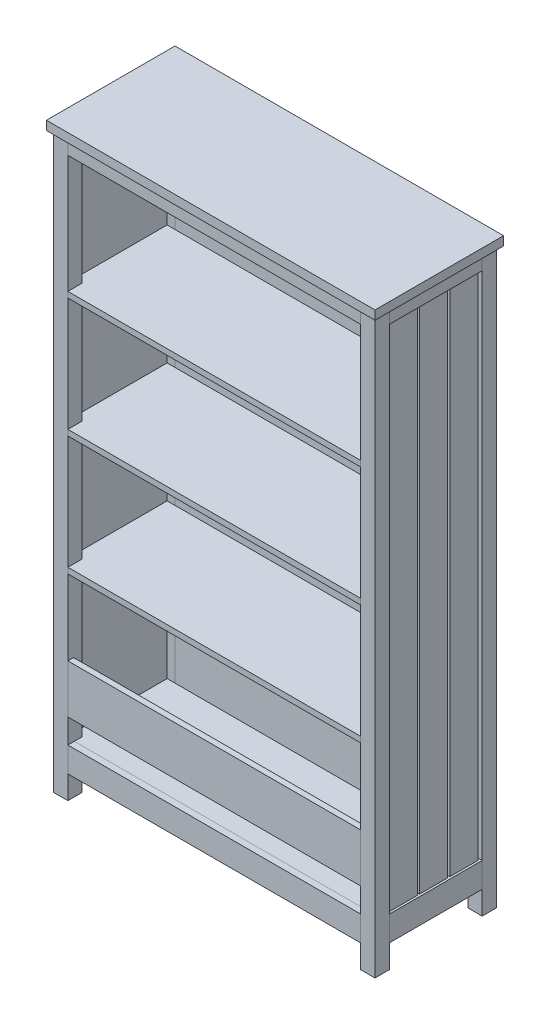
ISO-10303-21;
HEADER;
FILE_DESCRIPTION(('STEP AP214'),'2;1');
FILE_NAME('part.step','',(''),(''),'','','');
FILE_SCHEMA(('AUTOMOTIVE_DESIGN { 1 0 10303 214 1 1 1 1 }'));
ENDSEC;
DATA;
#1=APPLICATION_CONTEXT('core data for automotive mechanical design processes');
#2=APPLICATION_PROTOCOL_DEFINITION('international standard','automotive_design',2000,#1);
#3=PRODUCT_CONTEXT('',#1,'mechanical');
#4=PRODUCT('Part','Part','',(#3));
#5=PRODUCT_RELATED_PRODUCT_CATEGORY('part','',(#4));
#6=PRODUCT_DEFINITION_FORMATION('','',#4);
#7=PRODUCT_DEFINITION_CONTEXT('part definition',#1,'design');
#8=PRODUCT_DEFINITION('design','',#6,#7);
#9=PRODUCT_DEFINITION_SHAPE('','',#8);
#10=(LENGTH_UNIT() NAMED_UNIT(*) SI_UNIT(.MILLI.,.METRE.));
#11=(NAMED_UNIT(*) PLANE_ANGLE_UNIT() SI_UNIT($,.RADIAN.));
#12=(NAMED_UNIT(*) SI_UNIT($,.STERADIAN.) SOLID_ANGLE_UNIT());
#13=UNCERTAINTY_MEASURE_WITH_UNIT(LENGTH_MEASURE(1.E-05),#10,'distance_accuracy_value','');
#14=(GEOMETRIC_REPRESENTATION_CONTEXT(3) GLOBAL_UNCERTAINTY_ASSIGNED_CONTEXT((#13)) GLOBAL_UNIT_ASSIGNED_CONTEXT((#10,
#11,#12)) REPRESENTATION_CONTEXT('',''));
#15=CARTESIAN_POINT('',(0.,0.,0.));
#16=DIRECTION('',(0.,0.,1.));
#17=DIRECTION('',(1.,0.,0.));
#18=AXIS2_PLACEMENT_3D('',#15,#16,#17);
#19=CARTESIAN_POINT('',(162.944580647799,-956.608871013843,425.733305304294));
#20=DIRECTION('',(1.,0.,0.));
#21=DIRECTION('',(0.,0.,-1.));
#22=AXIS2_PLACEMENT_3D('',#19,#20,#21);
#23=PLANE('',#22);
#24=DIRECTION('',(0.,-1.,0.));
#25=VECTOR('',#24,1.);
#26=CARTESIAN_POINT('',(162.944580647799,-956.608871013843,385.733305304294));
#27=LINE('',#26,#25);
#28=CARTESIAN_POINT('',(162.944580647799,648.391128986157,385.733305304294));
#29=VERTEX_POINT('',#28);
#30=CARTESIAN_POINT('',(162.944580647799,-956.608871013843,385.733305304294));
#31=VERTEX_POINT('',#30);
#32=EDGE_CURVE('P0_E80',#29,#31,#27,.T.);
#33=ORIENTED_EDGE('',*,*,#32,.T.);
#34=DIRECTION('',(0.,0.,-1.));
#35=VECTOR('',#34,1.);
#36=CARTESIAN_POINT('',(162.944580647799,-956.608871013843,425.733305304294));
#37=LINE('',#36,#35);
#38=CARTESIAN_POINT('',(162.944580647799,-956.608871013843,425.733305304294));
#39=VERTEX_POINT('',#38);
#40=EDGE_CURVE('P0_E11',#39,#31,#37,.T.);
#41=ORIENTED_EDGE('',*,*,#40,.F.);
#42=DIRECTION('',(0.,-1.,0.));
#43=VECTOR('',#42,1.);
#44=CARTESIAN_POINT('',(162.944580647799,-956.608871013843,425.733305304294));
#45=LINE('',#44,#43);
#46=CARTESIAN_POINT('',(162.944580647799,648.391128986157,425.733305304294));
#47=VERTEX_POINT('',#46);
#48=EDGE_CURVE('P0_E68',#47,#39,#45,.T.);
#49=ORIENTED_EDGE('',*,*,#48,.F.);
#50=DIRECTION('',(0.,0.,-1.));
#51=VECTOR('',#50,1.);
#52=CARTESIAN_POINT('',(162.944580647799,648.391128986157,425.733305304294));
#53=LINE('',#52,#51);
#54=EDGE_CURVE('P0_E76',#47,#29,#53,.T.);
#55=ORIENTED_EDGE('',*,*,#54,.T.);
#56=EDGE_LOOP('',(#33,#41,#49,#55));
#57=FACE_BOUND('',#56,.T.);
#58=ADVANCED_FACE('P0_F17',(#57),#23,.F.);
#59=CARTESIAN_POINT('',(162.944580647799,-956.608871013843,425.733305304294));
#60=DIRECTION('',(0.,1.,0.));
#61=DIRECTION('',(0.,0.,1.));
#62=AXIS2_PLACEMENT_3D('',#59,#60,#61);
#63=PLANE('',#62);
#64=DIRECTION('',(1.,0.,0.));
#65=VECTOR('',#64,1.);
#66=CARTESIAN_POINT('',(162.944580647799,-956.608871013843,385.733305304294));
#67=LINE('',#66,#65);
#68=CARTESIAN_POINT('',(202.944580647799,-956.608871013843,385.733305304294));
#69=VERTEX_POINT('',#68);
#70=EDGE_CURVE('P0_E72',#31,#69,#67,.T.);
#71=ORIENTED_EDGE('',*,*,#70,.T.);
#72=DIRECTION('',(0.,0.,-1.));
#73=VECTOR('',#72,1.);
#74=CARTESIAN_POINT('',(202.944580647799,-956.608871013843,425.733305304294));
#75=LINE('',#74,#73);
#76=CARTESIAN_POINT('',(202.944580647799,-956.608871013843,425.733305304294));
#77=VERTEX_POINT('',#76);
#78=EDGE_CURVE('P0_E25',#77,#69,#75,.T.);
#79=ORIENTED_EDGE('',*,*,#78,.F.);
#80=DIRECTION('',(1.,0.,0.));
#81=VECTOR('',#80,1.);
#82=CARTESIAN_POINT('',(162.944580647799,-956.608871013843,425.733305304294));
#83=LINE('',#82,#81);
#84=EDGE_CURVE('P0_E63',#39,#77,#83,.T.);
#85=ORIENTED_EDGE('',*,*,#84,.F.);
#86=ORIENTED_EDGE('',*,*,#40,.T.);
#87=EDGE_LOOP('',(#71,#79,#85,#86));
#88=FACE_BOUND('',#87,.T.);
#89=ADVANCED_FACE('P0_F71',(#88),#63,.F.);
#90=CARTESIAN_POINT('',(202.944580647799,-956.608871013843,425.733305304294));
#91=DIRECTION('',(-1.,0.,0.));
#92=DIRECTION('',(0.,0.,1.));
#93=AXIS2_PLACEMENT_3D('',#90,#91,#92);
#94=PLANE('',#93);
#95=DIRECTION('',(0.,1.,0.));
#96=VECTOR('',#95,1.);
#97=CARTESIAN_POINT('',(202.944580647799,-956.608871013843,385.733305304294));
#98=LINE('',#97,#96);
#99=CARTESIAN_POINT('',(202.944580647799,648.391128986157,385.733305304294));
#100=VERTEX_POINT('',#99);
#101=EDGE_CURVE('P0_E50',#69,#100,#98,.T.);
#102=ORIENTED_EDGE('',*,*,#101,.T.);
#103=DIRECTION('',(0.,0.,-1.));
#104=VECTOR('',#103,1.);
#105=CARTESIAN_POINT('',(202.944580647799,648.391128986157,425.733305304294));
#106=LINE('',#105,#104);
#107=CARTESIAN_POINT('',(202.944580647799,648.391128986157,425.733305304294));
#108=VERTEX_POINT('',#107);
#109=EDGE_CURVE('P0_E73',#108,#100,#106,.T.);
#110=ORIENTED_EDGE('',*,*,#109,.F.);
#111=DIRECTION('',(0.,1.,0.));
#112=VECTOR('',#111,1.);
#113=CARTESIAN_POINT('',(202.944580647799,-956.608871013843,425.733305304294));
#114=LINE('',#113,#112);
#115=EDGE_CURVE('P0_E66',#77,#108,#114,.T.);
#116=ORIENTED_EDGE('',*,*,#115,.F.);
#117=ORIENTED_EDGE('',*,*,#78,.T.);
#118=EDGE_LOOP('',(#102,#110,#116,#117));
#119=FACE_BOUND('',#118,.T.);
#120=ADVANCED_FACE('P0_F74',(#119),#94,.F.);
#121=CARTESIAN_POINT('',(162.944580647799,648.391128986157,425.733305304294));
#122=DIRECTION('',(0.,-1.,0.));
#123=DIRECTION('',(0.,0.,-1.));
#124=AXIS2_PLACEMENT_3D('',#121,#122,#123);
#125=PLANE('',#124);
#126=DIRECTION('',(-1.,0.,0.));
#127=VECTOR('',#126,1.);
#128=CARTESIAN_POINT('',(162.944580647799,648.391128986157,385.733305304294));
#129=LINE('',#128,#127);
#130=EDGE_CURVE('P0_E56',#100,#29,#129,.T.);
#131=ORIENTED_EDGE('',*,*,#130,.T.);
#132=ORIENTED_EDGE('',*,*,#54,.F.);
#133=DIRECTION('',(-1.,0.,0.));
#134=VECTOR('',#133,1.);
#135=CARTESIAN_POINT('',(162.944580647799,648.391128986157,425.733305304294));
#136=LINE('',#135,#134);
#137=EDGE_CURVE('P0_E33',#108,#47,#136,.T.);
#138=ORIENTED_EDGE('',*,*,#137,.F.);
#139=ORIENTED_EDGE('',*,*,#109,.T.);
#140=EDGE_LOOP('',(#131,#132,#138,#139));
#141=FACE_BOUND('',#140,.T.);
#142=ADVANCED_FACE('P0_F87',(#141),#125,.F.);
#143=CARTESIAN_POINT('',(162.944580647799,-956.608871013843,425.733305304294));
#144=DIRECTION('',(0.,0.,-1.));
#145=DIRECTION('',(-1.,0.,0.));
#146=AXIS2_PLACEMENT_3D('',#143,#144,#145);
#147=PLANE('',#146);
#148=ORIENTED_EDGE('',*,*,#48,.T.);
#149=ORIENTED_EDGE('',*,*,#84,.T.);
#150=ORIENTED_EDGE('',*,*,#115,.T.);
#151=ORIENTED_EDGE('',*,*,#137,.T.);
#152=EDGE_LOOP('',(#148,#149,#150,#151));
#153=FACE_BOUND('',#152,.T.);
#154=ADVANCED_FACE('P0_F64',(#153),#147,.F.);
#155=CARTESIAN_POINT('',(162.944580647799,-956.608871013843,385.733305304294));
#156=DIRECTION('',(0.,0.,-1.));
#157=DIRECTION('',(-1.,0.,0.));
#158=AXIS2_PLACEMENT_3D('',#155,#156,#157);
#159=PLANE('',#158);
#160=ORIENTED_EDGE('',*,*,#32,.F.);
#161=ORIENTED_EDGE('',*,*,#130,.F.);
#162=ORIENTED_EDGE('',*,*,#101,.F.);
#163=ORIENTED_EDGE('',*,*,#70,.F.);
#164=EDGE_LOOP('',(#160,#161,#162,#163));
#165=FACE_BOUND('',#164,.T.);
#166=ADVANCED_FACE('P0_F90',(#165),#159,.T.);
#167=CLOSED_SHELL('',(#58,#89,#120,#142,#154,#166));
#168=MANIFOLD_SOLID_BREP('P0_B1',#167);
#169=CARTESIAN_POINT('',(1022.9445806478,-956.608871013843,425.733305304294));
#170=DIRECTION('',(1.,0.,0.));
#171=DIRECTION('',(0.,0.,-1.));
#172=AXIS2_PLACEMENT_3D('',#169,#170,#171);
#173=PLANE('',#172);
#174=DIRECTION('',(0.,-1.,0.));
#175=VECTOR('',#174,1.);
#176=CARTESIAN_POINT('',(1022.9445806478,-956.608871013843,385.733305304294));
#177=LINE('',#176,#175);
#178=CARTESIAN_POINT('',(1022.9445806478,648.391128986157,385.733305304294));
#179=VERTEX_POINT('',#178);
#180=CARTESIAN_POINT('',(1022.9445806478,-956.608871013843,385.733305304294));
#181=VERTEX_POINT('',#180);
#182=EDGE_CURVE('P1_E80',#179,#181,#177,.T.);
#183=ORIENTED_EDGE('',*,*,#182,.T.);
#184=DIRECTION('',(0.,0.,-1.));
#185=VECTOR('',#184,1.);
#186=CARTESIAN_POINT('',(1022.9445806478,-956.608871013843,425.733305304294));
#187=LINE('',#186,#185);
#188=CARTESIAN_POINT('',(1022.9445806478,-956.608871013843,425.733305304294));
#189=VERTEX_POINT('',#188);
#190=EDGE_CURVE('P1_E11',#189,#181,#187,.T.);
#191=ORIENTED_EDGE('',*,*,#190,.F.);
#192=DIRECTION('',(0.,-1.,0.));
#193=VECTOR('',#192,1.);
#194=CARTESIAN_POINT('',(1022.9445806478,-956.608871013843,425.733305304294));
#195=LINE('',#194,#193);
#196=CARTESIAN_POINT('',(1022.9445806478,648.391128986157,425.733305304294));
#197=VERTEX_POINT('',#196);
#198=EDGE_CURVE('P1_E68',#197,#189,#195,.T.);
#199=ORIENTED_EDGE('',*,*,#198,.F.);
#200=DIRECTION('',(0.,0.,-1.));
#201=VECTOR('',#200,1.);
#202=CARTESIAN_POINT('',(1022.9445806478,648.391128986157,425.733305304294));
#203=LINE('',#202,#201);
#204=EDGE_CURVE('P1_E76',#197,#179,#203,.T.);
#205=ORIENTED_EDGE('',*,*,#204,.T.);
#206=EDGE_LOOP('',(#183,#191,#199,#205));
#207=FACE_BOUND('',#206,.T.);
#208=ADVANCED_FACE('P1_F17',(#207),#173,.F.);
#209=CARTESIAN_POINT('',(1022.9445806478,-956.608871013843,425.733305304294));
#210=DIRECTION('',(0.,1.,0.));
#211=DIRECTION('',(0.,0.,1.));
#212=AXIS2_PLACEMENT_3D('',#209,#210,#211);
#213=PLANE('',#212);
#214=DIRECTION('',(1.,0.,0.));
#215=VECTOR('',#214,1.);
#216=CARTESIAN_POINT('',(1022.9445806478,-956.608871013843,385.733305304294));
#217=LINE('',#216,#215);
#218=CARTESIAN_POINT('',(1062.9445806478,-956.608871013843,385.733305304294));
#219=VERTEX_POINT('',#218);
#220=EDGE_CURVE('P1_E72',#181,#219,#217,.T.);
#221=ORIENTED_EDGE('',*,*,#220,.T.);
#222=DIRECTION('',(0.,0.,-1.));
#223=VECTOR('',#222,1.);
#224=CARTESIAN_POINT('',(1062.9445806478,-956.608871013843,425.733305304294));
#225=LINE('',#224,#223);
#226=CARTESIAN_POINT('',(1062.9445806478,-956.608871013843,425.733305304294));
#227=VERTEX_POINT('',#226);
#228=EDGE_CURVE('P1_E25',#227,#219,#225,.T.);
#229=ORIENTED_EDGE('',*,*,#228,.F.);
#230=DIRECTION('',(1.,0.,0.));
#231=VECTOR('',#230,1.);
#232=CARTESIAN_POINT('',(1022.9445806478,-956.608871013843,425.733305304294));
#233=LINE('',#232,#231);
#234=EDGE_CURVE('P1_E63',#189,#227,#233,.T.);
#235=ORIENTED_EDGE('',*,*,#234,.F.);
#236=ORIENTED_EDGE('',*,*,#190,.T.);
#237=EDGE_LOOP('',(#221,#229,#235,#236));
#238=FACE_BOUND('',#237,.T.);
#239=ADVANCED_FACE('P1_F71',(#238),#213,.F.);
#240=CARTESIAN_POINT('',(1062.9445806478,-956.608871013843,425.733305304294));
#241=DIRECTION('',(-1.,0.,0.));
#242=DIRECTION('',(0.,0.,1.));
#243=AXIS2_PLACEMENT_3D('',#240,#241,#242);
#244=PLANE('',#243);
#245=DIRECTION('',(0.,1.,0.));
#246=VECTOR('',#245,1.);
#247=CARTESIAN_POINT('',(1062.9445806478,-956.608871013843,385.733305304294));
#248=LINE('',#247,#246);
#249=CARTESIAN_POINT('',(1062.9445806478,648.391128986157,385.733305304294));
#250=VERTEX_POINT('',#249);
#251=EDGE_CURVE('P1_E50',#219,#250,#248,.T.);
#252=ORIENTED_EDGE('',*,*,#251,.T.);
#253=DIRECTION('',(0.,0.,-1.));
#254=VECTOR('',#253,1.);
#255=CARTESIAN_POINT('',(1062.9445806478,648.391128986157,425.733305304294));
#256=LINE('',#255,#254);
#257=CARTESIAN_POINT('',(1062.9445806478,648.391128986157,425.733305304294));
#258=VERTEX_POINT('',#257);
#259=EDGE_CURVE('P1_E73',#258,#250,#256,.T.);
#260=ORIENTED_EDGE('',*,*,#259,.F.);
#261=DIRECTION('',(0.,1.,0.));
#262=VECTOR('',#261,1.);
#263=CARTESIAN_POINT('',(1062.9445806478,-956.608871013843,425.733305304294));
#264=LINE('',#263,#262);
#265=EDGE_CURVE('P1_E66',#227,#258,#264,.T.);
#266=ORIENTED_EDGE('',*,*,#265,.F.);
#267=ORIENTED_EDGE('',*,*,#228,.T.);
#268=EDGE_LOOP('',(#252,#260,#266,#267));
#269=FACE_BOUND('',#268,.T.);
#270=ADVANCED_FACE('P1_F74',(#269),#244,.F.);
#271=CARTESIAN_POINT('',(1022.9445806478,648.391128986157,425.733305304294));
#272=DIRECTION('',(0.,-1.,0.));
#273=DIRECTION('',(0.,0.,-1.));
#274=AXIS2_PLACEMENT_3D('',#271,#272,#273);
#275=PLANE('',#274);
#276=DIRECTION('',(-1.,0.,0.));
#277=VECTOR('',#276,1.);
#278=CARTESIAN_POINT('',(1022.9445806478,648.391128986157,385.733305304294));
#279=LINE('',#278,#277);
#280=EDGE_CURVE('P1_E56',#250,#179,#279,.T.);
#281=ORIENTED_EDGE('',*,*,#280,.T.);
#282=ORIENTED_EDGE('',*,*,#204,.F.);
#283=DIRECTION('',(-1.,0.,0.));
#284=VECTOR('',#283,1.);
#285=CARTESIAN_POINT('',(1022.9445806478,648.391128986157,425.733305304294));
#286=LINE('',#285,#284);
#287=EDGE_CURVE('P1_E33',#258,#197,#286,.T.);
#288=ORIENTED_EDGE('',*,*,#287,.F.);
#289=ORIENTED_EDGE('',*,*,#259,.T.);
#290=EDGE_LOOP('',(#281,#282,#288,#289));
#291=FACE_BOUND('',#290,.T.);
#292=ADVANCED_FACE('P1_F87',(#291),#275,.F.);
#293=CARTESIAN_POINT('',(1022.9445806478,-956.608871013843,425.733305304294));
#294=DIRECTION('',(0.,0.,-1.));
#295=DIRECTION('',(-1.,0.,0.));
#296=AXIS2_PLACEMENT_3D('',#293,#294,#295);
#297=PLANE('',#296);
#298=ORIENTED_EDGE('',*,*,#198,.T.);
#299=ORIENTED_EDGE('',*,*,#234,.T.);
#300=ORIENTED_EDGE('',*,*,#265,.T.);
#301=ORIENTED_EDGE('',*,*,#287,.T.);
#302=EDGE_LOOP('',(#298,#299,#300,#301));
#303=FACE_BOUND('',#302,.T.);
#304=ADVANCED_FACE('P1_F64',(#303),#297,.F.);
#305=CARTESIAN_POINT('',(1022.9445806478,-956.608871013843,385.733305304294));
#306=DIRECTION('',(0.,0.,-1.));
#307=DIRECTION('',(-1.,0.,0.));
#308=AXIS2_PLACEMENT_3D('',#305,#306,#307);
#309=PLANE('',#308);
#310=ORIENTED_EDGE('',*,*,#182,.F.);
#311=ORIENTED_EDGE('',*,*,#280,.F.);
#312=ORIENTED_EDGE('',*,*,#251,.F.);
#313=ORIENTED_EDGE('',*,*,#220,.F.);
#314=EDGE_LOOP('',(#310,#311,#312,#313));
#315=FACE_BOUND('',#314,.T.);
#316=ADVANCED_FACE('P1_F90',(#315),#309,.T.);
#317=CLOSED_SHELL('',(#208,#239,#270,#292,#304,#316));
#318=MANIFOLD_SOLID_BREP('P1_B1',#317);
#319=CARTESIAN_POINT('',(162.944580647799,-956.608871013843,725.733305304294));
#320=DIRECTION('',(1.,0.,0.));
#321=DIRECTION('',(0.,0.,-1.));
#322=AXIS2_PLACEMENT_3D('',#319,#320,#321);
#323=PLANE('',#322);
#324=DIRECTION('',(0.,-1.,0.));
#325=VECTOR('',#324,1.);
#326=CARTESIAN_POINT('',(162.944580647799,-956.608871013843,685.733305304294));
#327=LINE('',#326,#325);
#328=CARTESIAN_POINT('',(162.944580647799,648.391128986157,685.733305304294));
#329=VERTEX_POINT('',#328);
#330=CARTESIAN_POINT('',(162.944580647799,-956.608871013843,685.733305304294));
#331=VERTEX_POINT('',#330);
#332=EDGE_CURVE('P2_E80',#329,#331,#327,.T.);
#333=ORIENTED_EDGE('',*,*,#332,.T.);
#334=DIRECTION('',(0.,0.,-1.));
#335=VECTOR('',#334,1.);
#336=CARTESIAN_POINT('',(162.944580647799,-956.608871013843,725.733305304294));
#337=LINE('',#336,#335);
#338=CARTESIAN_POINT('',(162.944580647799,-956.608871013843,725.733305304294));
#339=VERTEX_POINT('',#338);
#340=EDGE_CURVE('P2_E11',#339,#331,#337,.T.);
#341=ORIENTED_EDGE('',*,*,#340,.F.);
#342=DIRECTION('',(0.,-1.,0.));
#343=VECTOR('',#342,1.);
#344=CARTESIAN_POINT('',(162.944580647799,-956.608871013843,725.733305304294));
#345=LINE('',#344,#343);
#346=CARTESIAN_POINT('',(162.944580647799,648.391128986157,725.733305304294));
#347=VERTEX_POINT('',#346);
#348=EDGE_CURVE('P2_E68',#347,#339,#345,.T.);
#349=ORIENTED_EDGE('',*,*,#348,.F.);
#350=DIRECTION('',(0.,0.,-1.));
#351=VECTOR('',#350,1.);
#352=CARTESIAN_POINT('',(162.944580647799,648.391128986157,725.733305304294));
#353=LINE('',#352,#351);
#354=EDGE_CURVE('P2_E76',#347,#329,#353,.T.);
#355=ORIENTED_EDGE('',*,*,#354,.T.);
#356=EDGE_LOOP('',(#333,#341,#349,#355));
#357=FACE_BOUND('',#356,.T.);
#358=ADVANCED_FACE('P2_F17',(#357),#323,.F.);
#359=CARTESIAN_POINT('',(162.944580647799,-956.608871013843,725.733305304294));
#360=DIRECTION('',(0.,1.,0.));
#361=DIRECTION('',(0.,0.,1.));
#362=AXIS2_PLACEMENT_3D('',#359,#360,#361);
#363=PLANE('',#362);
#364=DIRECTION('',(1.,0.,0.));
#365=VECTOR('',#364,1.);
#366=CARTESIAN_POINT('',(162.944580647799,-956.608871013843,685.733305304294));
#367=LINE('',#366,#365);
#368=CARTESIAN_POINT('',(202.944580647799,-956.608871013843,685.733305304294));
#369=VERTEX_POINT('',#368);
#370=EDGE_CURVE('P2_E72',#331,#369,#367,.T.);
#371=ORIENTED_EDGE('',*,*,#370,.T.);
#372=DIRECTION('',(0.,0.,-1.));
#373=VECTOR('',#372,1.);
#374=CARTESIAN_POINT('',(202.944580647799,-956.608871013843,725.733305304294));
#375=LINE('',#374,#373);
#376=CARTESIAN_POINT('',(202.944580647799,-956.608871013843,725.733305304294));
#377=VERTEX_POINT('',#376);
#378=EDGE_CURVE('P2_E25',#377,#369,#375,.T.);
#379=ORIENTED_EDGE('',*,*,#378,.F.);
#380=DIRECTION('',(1.,0.,0.));
#381=VECTOR('',#380,1.);
#382=CARTESIAN_POINT('',(162.944580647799,-956.608871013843,725.733305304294));
#383=LINE('',#382,#381);
#384=EDGE_CURVE('P2_E63',#339,#377,#383,.T.);
#385=ORIENTED_EDGE('',*,*,#384,.F.);
#386=ORIENTED_EDGE('',*,*,#340,.T.);
#387=EDGE_LOOP('',(#371,#379,#385,#386));
#388=FACE_BOUND('',#387,.T.);
#389=ADVANCED_FACE('P2_F71',(#388),#363,.F.);
#390=CARTESIAN_POINT('',(202.944580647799,-956.608871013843,725.733305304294));
#391=DIRECTION('',(-1.,0.,0.));
#392=DIRECTION('',(0.,0.,1.));
#393=AXIS2_PLACEMENT_3D('',#390,#391,#392);
#394=PLANE('',#393);
#395=DIRECTION('',(0.,1.,0.));
#396=VECTOR('',#395,1.);
#397=CARTESIAN_POINT('',(202.944580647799,-956.608871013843,685.733305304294));
#398=LINE('',#397,#396);
#399=CARTESIAN_POINT('',(202.944580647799,648.391128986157,685.733305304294));
#400=VERTEX_POINT('',#399);
#401=EDGE_CURVE('P2_E50',#369,#400,#398,.T.);
#402=ORIENTED_EDGE('',*,*,#401,.T.);
#403=DIRECTION('',(0.,0.,-1.));
#404=VECTOR('',#403,1.);
#405=CARTESIAN_POINT('',(202.944580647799,648.391128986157,725.733305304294));
#406=LINE('',#405,#404);
#407=CARTESIAN_POINT('',(202.944580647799,648.391128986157,725.733305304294));
#408=VERTEX_POINT('',#407);
#409=EDGE_CURVE('P2_E73',#408,#400,#406,.T.);
#410=ORIENTED_EDGE('',*,*,#409,.F.);
#411=DIRECTION('',(0.,1.,0.));
#412=VECTOR('',#411,1.);
#413=CARTESIAN_POINT('',(202.944580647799,-956.608871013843,725.733305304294));
#414=LINE('',#413,#412);
#415=EDGE_CURVE('P2_E66',#377,#408,#414,.T.);
#416=ORIENTED_EDGE('',*,*,#415,.F.);
#417=ORIENTED_EDGE('',*,*,#378,.T.);
#418=EDGE_LOOP('',(#402,#410,#416,#417));
#419=FACE_BOUND('',#418,.T.);
#420=ADVANCED_FACE('P2_F74',(#419),#394,.F.);
#421=CARTESIAN_POINT('',(162.944580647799,648.391128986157,725.733305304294));
#422=DIRECTION('',(0.,-1.,0.));
#423=DIRECTION('',(0.,0.,-1.));
#424=AXIS2_PLACEMENT_3D('',#421,#422,#423);
#425=PLANE('',#424);
#426=DIRECTION('',(-1.,0.,0.));
#427=VECTOR('',#426,1.);
#428=CARTESIAN_POINT('',(162.944580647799,648.391128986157,685.733305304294));
#429=LINE('',#428,#427);
#430=EDGE_CURVE('P2_E56',#400,#329,#429,.T.);
#431=ORIENTED_EDGE('',*,*,#430,.T.);
#432=ORIENTED_EDGE('',*,*,#354,.F.);
#433=DIRECTION('',(-1.,0.,0.));
#434=VECTOR('',#433,1.);
#435=CARTESIAN_POINT('',(162.944580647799,648.391128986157,725.733305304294));
#436=LINE('',#435,#434);
#437=EDGE_CURVE('P2_E33',#408,#347,#436,.T.);
#438=ORIENTED_EDGE('',*,*,#437,.F.);
#439=ORIENTED_EDGE('',*,*,#409,.T.);
#440=EDGE_LOOP('',(#431,#432,#438,#439));
#441=FACE_BOUND('',#440,.T.);
#442=ADVANCED_FACE('P2_F87',(#441),#425,.F.);
#443=CARTESIAN_POINT('',(162.944580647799,-956.608871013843,725.733305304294));
#444=DIRECTION('',(0.,0.,-1.));
#445=DIRECTION('',(-1.,0.,0.));
#446=AXIS2_PLACEMENT_3D('',#443,#444,#445);
#447=PLANE('',#446);
#448=ORIENTED_EDGE('',*,*,#348,.T.);
#449=ORIENTED_EDGE('',*,*,#384,.T.);
#450=ORIENTED_EDGE('',*,*,#415,.T.);
#451=ORIENTED_EDGE('',*,*,#437,.T.);
#452=EDGE_LOOP('',(#448,#449,#450,#451));
#453=FACE_BOUND('',#452,.T.);
#454=ADVANCED_FACE('P2_F64',(#453),#447,.F.);
#455=CARTESIAN_POINT('',(162.944580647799,-956.608871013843,685.733305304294));
#456=DIRECTION('',(0.,0.,-1.));
#457=DIRECTION('',(-1.,0.,0.));
#458=AXIS2_PLACEMENT_3D('',#455,#456,#457);
#459=PLANE('',#458);
#460=ORIENTED_EDGE('',*,*,#332,.F.);
#461=ORIENTED_EDGE('',*,*,#430,.F.);
#462=ORIENTED_EDGE('',*,*,#401,.F.);
#463=ORIENTED_EDGE('',*,*,#370,.F.);
#464=EDGE_LOOP('',(#460,#461,#462,#463));
#465=FACE_BOUND('',#464,.T.);
#466=ADVANCED_FACE('P2_F90',(#465),#459,.T.);
#467=CLOSED_SHELL('',(#358,#389,#420,#442,#454,#466));
#468=MANIFOLD_SOLID_BREP('P2_B1',#467);
#469=CARTESIAN_POINT('',(1022.9445806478,-956.608871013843,725.733305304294));
#470=DIRECTION('',(1.,0.,0.));
#471=DIRECTION('',(0.,0.,-1.));
#472=AXIS2_PLACEMENT_3D('',#469,#470,#471);
#473=PLANE('',#472);
#474=DIRECTION('',(0.,-1.,0.));
#475=VECTOR('',#474,1.);
#476=CARTESIAN_POINT('',(1022.9445806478,-956.608871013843,685.733305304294));
#477=LINE('',#476,#475);
#478=CARTESIAN_POINT('',(1022.9445806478,648.391128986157,685.733305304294));
#479=VERTEX_POINT('',#478);
#480=CARTESIAN_POINT('',(1022.9445806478,-956.608871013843,685.733305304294));
#481=VERTEX_POINT('',#480);
#482=EDGE_CURVE('P3_E80',#479,#481,#477,.T.);
#483=ORIENTED_EDGE('',*,*,#482,.T.);
#484=DIRECTION('',(0.,0.,-1.));
#485=VECTOR('',#484,1.);
#486=CARTESIAN_POINT('',(1022.9445806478,-956.608871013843,725.733305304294));
#487=LINE('',#486,#485);
#488=CARTESIAN_POINT('',(1022.9445806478,-956.608871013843,725.733305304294));
#489=VERTEX_POINT('',#488);
#490=EDGE_CURVE('P3_E11',#489,#481,#487,.T.);
#491=ORIENTED_EDGE('',*,*,#490,.F.);
#492=DIRECTION('',(0.,-1.,0.));
#493=VECTOR('',#492,1.);
#494=CARTESIAN_POINT('',(1022.9445806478,-956.608871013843,725.733305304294));
#495=LINE('',#494,#493);
#496=CARTESIAN_POINT('',(1022.9445806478,648.391128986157,725.733305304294));
#497=VERTEX_POINT('',#496);
#498=EDGE_CURVE('P3_E68',#497,#489,#495,.T.);
#499=ORIENTED_EDGE('',*,*,#498,.F.);
#500=DIRECTION('',(0.,0.,-1.));
#501=VECTOR('',#500,1.);
#502=CARTESIAN_POINT('',(1022.9445806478,648.391128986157,725.733305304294));
#503=LINE('',#502,#501);
#504=EDGE_CURVE('P3_E76',#497,#479,#503,.T.);
#505=ORIENTED_EDGE('',*,*,#504,.T.);
#506=EDGE_LOOP('',(#483,#491,#499,#505));
#507=FACE_BOUND('',#506,.T.);
#508=ADVANCED_FACE('P3_F17',(#507),#473,.F.);
#509=CARTESIAN_POINT('',(1022.9445806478,-956.608871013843,725.733305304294));
#510=DIRECTION('',(0.,1.,0.));
#511=DIRECTION('',(0.,0.,1.));
#512=AXIS2_PLACEMENT_3D('',#509,#510,#511);
#513=PLANE('',#512);
#514=DIRECTION('',(1.,0.,0.));
#515=VECTOR('',#514,1.);
#516=CARTESIAN_POINT('',(1022.9445806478,-956.608871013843,685.733305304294));
#517=LINE('',#516,#515);
#518=CARTESIAN_POINT('',(1062.9445806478,-956.608871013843,685.733305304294));
#519=VERTEX_POINT('',#518);
#520=EDGE_CURVE('P3_E72',#481,#519,#517,.T.);
#521=ORIENTED_EDGE('',*,*,#520,.T.);
#522=DIRECTION('',(0.,0.,-1.));
#523=VECTOR('',#522,1.);
#524=CARTESIAN_POINT('',(1062.9445806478,-956.608871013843,725.733305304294));
#525=LINE('',#524,#523);
#526=CARTESIAN_POINT('',(1062.9445806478,-956.608871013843,725.733305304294));
#527=VERTEX_POINT('',#526);
#528=EDGE_CURVE('P3_E25',#527,#519,#525,.T.);
#529=ORIENTED_EDGE('',*,*,#528,.F.);
#530=DIRECTION('',(1.,0.,0.));
#531=VECTOR('',#530,1.);
#532=CARTESIAN_POINT('',(1022.9445806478,-956.608871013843,725.733305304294));
#533=LINE('',#532,#531);
#534=EDGE_CURVE('P3_E63',#489,#527,#533,.T.);
#535=ORIENTED_EDGE('',*,*,#534,.F.);
#536=ORIENTED_EDGE('',*,*,#490,.T.);
#537=EDGE_LOOP('',(#521,#529,#535,#536));
#538=FACE_BOUND('',#537,.T.);
#539=ADVANCED_FACE('P3_F71',(#538),#513,.F.);
#540=CARTESIAN_POINT('',(1062.9445806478,-956.608871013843,725.733305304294));
#541=DIRECTION('',(-1.,0.,0.));
#542=DIRECTION('',(0.,0.,1.));
#543=AXIS2_PLACEMENT_3D('',#540,#541,#542);
#544=PLANE('',#543);
#545=DIRECTION('',(0.,1.,0.));
#546=VECTOR('',#545,1.);
#547=CARTESIAN_POINT('',(1062.9445806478,-956.608871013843,685.733305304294));
#548=LINE('',#547,#546);
#549=CARTESIAN_POINT('',(1062.9445806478,648.391128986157,685.733305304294));
#550=VERTEX_POINT('',#549);
#551=EDGE_CURVE('P3_E50',#519,#550,#548,.T.);
#552=ORIENTED_EDGE('',*,*,#551,.T.);
#553=DIRECTION('',(0.,0.,-1.));
#554=VECTOR('',#553,1.);
#555=CARTESIAN_POINT('',(1062.9445806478,648.391128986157,725.733305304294));
#556=LINE('',#555,#554);
#557=CARTESIAN_POINT('',(1062.9445806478,648.391128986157,725.733305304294));
#558=VERTEX_POINT('',#557);
#559=EDGE_CURVE('P3_E73',#558,#550,#556,.T.);
#560=ORIENTED_EDGE('',*,*,#559,.F.);
#561=DIRECTION('',(0.,1.,0.));
#562=VECTOR('',#561,1.);
#563=CARTESIAN_POINT('',(1062.9445806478,-956.608871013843,725.733305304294));
#564=LINE('',#563,#562);
#565=EDGE_CURVE('P3_E66',#527,#558,#564,.T.);
#566=ORIENTED_EDGE('',*,*,#565,.F.);
#567=ORIENTED_EDGE('',*,*,#528,.T.);
#568=EDGE_LOOP('',(#552,#560,#566,#567));
#569=FACE_BOUND('',#568,.T.);
#570=ADVANCED_FACE('P3_F74',(#569),#544,.F.);
#571=CARTESIAN_POINT('',(1022.9445806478,648.391128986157,725.733305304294));
#572=DIRECTION('',(0.,-1.,0.));
#573=DIRECTION('',(0.,0.,-1.));
#574=AXIS2_PLACEMENT_3D('',#571,#572,#573);
#575=PLANE('',#574);
#576=DIRECTION('',(-1.,0.,0.));
#577=VECTOR('',#576,1.);
#578=CARTESIAN_POINT('',(1022.9445806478,648.391128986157,685.733305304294));
#579=LINE('',#578,#577);
#580=EDGE_CURVE('P3_E56',#550,#479,#579,.T.);
#581=ORIENTED_EDGE('',*,*,#580,.T.);
#582=ORIENTED_EDGE('',*,*,#504,.F.);
#583=DIRECTION('',(-1.,0.,0.));
#584=VECTOR('',#583,1.);
#585=CARTESIAN_POINT('',(1022.9445806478,648.391128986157,725.733305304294));
#586=LINE('',#585,#584);
#587=EDGE_CURVE('P3_E33',#558,#497,#586,.T.);
#588=ORIENTED_EDGE('',*,*,#587,.F.);
#589=ORIENTED_EDGE('',*,*,#559,.T.);
#590=EDGE_LOOP('',(#581,#582,#588,#589));
#591=FACE_BOUND('',#590,.T.);
#592=ADVANCED_FACE('P3_F87',(#591),#575,.F.);
#593=CARTESIAN_POINT('',(1022.9445806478,-956.608871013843,725.733305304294));
#594=DIRECTION('',(0.,0.,-1.));
#595=DIRECTION('',(-1.,0.,0.));
#596=AXIS2_PLACEMENT_3D('',#593,#594,#595);
#597=PLANE('',#596);
#598=ORIENTED_EDGE('',*,*,#498,.T.);
#599=ORIENTED_EDGE('',*,*,#534,.T.);
#600=ORIENTED_EDGE('',*,*,#565,.T.);
#601=ORIENTED_EDGE('',*,*,#587,.T.);
#602=EDGE_LOOP('',(#598,#599,#600,#601));
#603=FACE_BOUND('',#602,.T.);
#604=ADVANCED_FACE('P3_F64',(#603),#597,.F.);
#605=CARTESIAN_POINT('',(1022.9445806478,-956.608871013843,685.733305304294));
#606=DIRECTION('',(0.,0.,-1.));
#607=DIRECTION('',(-1.,0.,0.));
#608=AXIS2_PLACEMENT_3D('',#605,#606,#607);
#609=PLANE('',#608);
#610=ORIENTED_EDGE('',*,*,#482,.F.);
#611=ORIENTED_EDGE('',*,*,#580,.F.);
#612=ORIENTED_EDGE('',*,*,#551,.F.);
#613=ORIENTED_EDGE('',*,*,#520,.F.);
#614=EDGE_LOOP('',(#610,#611,#612,#613));
#615=FACE_BOUND('',#614,.T.);
#616=ADVANCED_FACE('P3_F90',(#615),#609,.T.);
#617=CLOSED_SHELL('',(#508,#539,#570,#592,#604,#616));
#618=MANIFOLD_SOLID_BREP('P3_B1',#617);
#619=CARTESIAN_POINT('',(202.944580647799,-753.608871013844,725.733305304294));
#620=DIRECTION('',(-1.,0.,0.));
#621=DIRECTION('',(0.,0.,1.));
#622=AXIS2_PLACEMENT_3D('',#619,#620,#621);
#623=PLANE('',#622);
#624=DIRECTION('',(0.,1.,0.));
#625=VECTOR('',#624,1.);
#626=CARTESIAN_POINT('',(202.944580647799,-753.608871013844,709.733305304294));
#627=LINE('',#626,#625);
#628=CARTESIAN_POINT('',(202.944580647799,-753.608871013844,709.733305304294));
#629=VERTEX_POINT('',#628);
#630=CARTESIAN_POINT('',(202.944580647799,-617.608871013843,709.733305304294));
#631=VERTEX_POINT('',#630);
#632=EDGE_CURVE('P4_E81',#629,#631,#627,.T.);
#633=ORIENTED_EDGE('',*,*,#632,.F.);
#634=DIRECTION('',(0.,0.,-1.));
#635=VECTOR('',#634,1.);
#636=CARTESIAN_POINT('',(202.944580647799,-753.608871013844,725.733305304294));
#637=LINE('',#636,#635);
#638=CARTESIAN_POINT('',(202.944580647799,-753.608871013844,725.733305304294));
#639=VERTEX_POINT('',#638);
#640=EDGE_CURVE('P4_E10',#639,#629,#637,.T.);
#641=ORIENTED_EDGE('',*,*,#640,.F.);
#642=DIRECTION('',(0.,1.,0.));
#643=VECTOR('',#642,1.);
#644=CARTESIAN_POINT('',(202.944580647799,-753.608871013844,725.733305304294));
#645=LINE('',#644,#643);
#646=CARTESIAN_POINT('',(202.944580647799,-617.608871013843,725.733305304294));
#647=VERTEX_POINT('',#646);
#648=EDGE_CURVE('P4_E76',#639,#647,#645,.T.);
#649=ORIENTED_EDGE('',*,*,#648,.T.);
#650=DIRECTION('',(0.,0.,-1.));
#651=VECTOR('',#650,1.);
#652=CARTESIAN_POINT('',(202.944580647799,-617.608871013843,725.733305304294));
#653=LINE('',#652,#651);
#654=EDGE_CURVE('P4_E19',#647,#631,#653,.T.);
#655=ORIENTED_EDGE('',*,*,#654,.T.);
#656=EDGE_LOOP('',(#633,#641,#649,#655));
#657=FACE_BOUND('',#656,.T.);
#658=ADVANCED_FACE('P4_F16',(#657),#623,.T.);
#659=CARTESIAN_POINT('',(202.944580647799,-753.608871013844,725.733305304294));
#660=DIRECTION('',(0.,1.,0.));
#661=DIRECTION('',(0.,0.,1.));
#662=AXIS2_PLACEMENT_3D('',#659,#660,#661);
#663=PLANE('',#662);
#664=DIRECTION('',(1.,0.,0.));
#665=VECTOR('',#664,1.);
#666=CARTESIAN_POINT('',(202.944580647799,-753.608871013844,709.733305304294));
#667=LINE('',#666,#665);
#668=CARTESIAN_POINT('',(1022.9445806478,-753.608871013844,709.733305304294));
#669=VERTEX_POINT('',#668);
#670=EDGE_CURVE('P4_E49',#629,#669,#667,.T.);
#671=ORIENTED_EDGE('',*,*,#670,.T.);
#672=DIRECTION('',(0.,0.,-1.));
#673=VECTOR('',#672,1.);
#674=CARTESIAN_POINT('',(1022.9445806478,-753.608871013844,725.733305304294));
#675=LINE('',#674,#673);
#676=CARTESIAN_POINT('',(1022.9445806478,-753.608871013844,725.733305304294));
#677=VERTEX_POINT('',#676);
#678=EDGE_CURVE('P4_E25',#677,#669,#675,.T.);
#679=ORIENTED_EDGE('',*,*,#678,.F.);
#680=DIRECTION('',(1.,0.,0.));
#681=VECTOR('',#680,1.);
#682=CARTESIAN_POINT('',(202.944580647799,-753.608871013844,725.733305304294));
#683=LINE('',#682,#681);
#684=EDGE_CURVE('P4_E66',#639,#677,#683,.T.);
#685=ORIENTED_EDGE('',*,*,#684,.F.);
#686=ORIENTED_EDGE('',*,*,#640,.T.);
#687=EDGE_LOOP('',(#671,#679,#685,#686));
#688=FACE_BOUND('',#687,.T.);
#689=ADVANCED_FACE('P4_F91',(#688),#663,.F.);
#690=CARTESIAN_POINT('',(1022.9445806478,-753.608871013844,725.733305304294));
#691=DIRECTION('',(-1.,0.,0.));
#692=DIRECTION('',(0.,0.,1.));
#693=AXIS2_PLACEMENT_3D('',#690,#691,#692);
#694=PLANE('',#693);
#695=DIRECTION('',(0.,1.,0.));
#696=VECTOR('',#695,1.);
#697=CARTESIAN_POINT('',(1022.9445806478,-753.608871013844,709.733305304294));
#698=LINE('',#697,#696);
#699=CARTESIAN_POINT('',(1022.9445806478,-617.608871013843,709.733305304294));
#700=VERTEX_POINT('',#699);
#701=EDGE_CURVE('P4_E73',#669,#700,#698,.T.);
#702=ORIENTED_EDGE('',*,*,#701,.T.);
#703=DIRECTION('',(0.,0.,-1.));
#704=VECTOR('',#703,1.);
#705=CARTESIAN_POINT('',(1022.9445806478,-617.608871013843,725.733305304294));
#706=LINE('',#705,#704);
#707=CARTESIAN_POINT('',(1022.9445806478,-617.608871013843,725.733305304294));
#708=VERTEX_POINT('',#707);
#709=EDGE_CURVE('P4_E70',#708,#700,#706,.T.);
#710=ORIENTED_EDGE('',*,*,#709,.F.);
#711=DIRECTION('',(0.,1.,0.));
#712=VECTOR('',#711,1.);
#713=CARTESIAN_POINT('',(1022.9445806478,-753.608871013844,725.733305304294));
#714=LINE('',#713,#712);
#715=EDGE_CURVE('P4_E61',#677,#708,#714,.T.);
#716=ORIENTED_EDGE('',*,*,#715,.F.);
#717=ORIENTED_EDGE('',*,*,#678,.T.);
#718=EDGE_LOOP('',(#702,#710,#716,#717));
#719=FACE_BOUND('',#718,.T.);
#720=ADVANCED_FACE('P4_F71',(#719),#694,.F.);
#721=CARTESIAN_POINT('',(202.944580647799,-617.608871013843,725.733305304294));
#722=DIRECTION('',(0.,1.,0.));
#723=DIRECTION('',(0.,0.,1.));
#724=AXIS2_PLACEMENT_3D('',#721,#722,#723);
#725=PLANE('',#724);
#726=DIRECTION('',(1.,0.,0.));
#727=VECTOR('',#726,1.);
#728=CARTESIAN_POINT('',(202.944580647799,-617.608871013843,709.733305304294));
#729=LINE('',#728,#727);
#730=EDGE_CURVE('P4_E84',#631,#700,#729,.T.);
#731=ORIENTED_EDGE('',*,*,#730,.F.);
#732=ORIENTED_EDGE('',*,*,#654,.F.);
#733=DIRECTION('',(1.,0.,0.));
#734=VECTOR('',#733,1.);
#735=CARTESIAN_POINT('',(202.944580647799,-617.608871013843,725.733305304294));
#736=LINE('',#735,#734);
#737=EDGE_CURVE('P4_E65',#647,#708,#736,.T.);
#738=ORIENTED_EDGE('',*,*,#737,.T.);
#739=ORIENTED_EDGE('',*,*,#709,.T.);
#740=EDGE_LOOP('',(#731,#732,#738,#739));
#741=FACE_BOUND('',#740,.T.);
#742=ADVANCED_FACE('P4_F75',(#741),#725,.T.);
#743=CARTESIAN_POINT('',(-1.99999999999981,65.9999999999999,725.733305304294));
#744=DIRECTION('',(0.,0.,-1.));
#745=DIRECTION('',(-1.,0.,0.));
#746=AXIS2_PLACEMENT_3D('',#743,#744,#745);
#747=PLANE('',#746);
#748=ORIENTED_EDGE('',*,*,#648,.F.);
#749=ORIENTED_EDGE('',*,*,#684,.T.);
#750=ORIENTED_EDGE('',*,*,#715,.T.);
#751=ORIENTED_EDGE('',*,*,#737,.F.);
#752=EDGE_LOOP('',(#748,#749,#750,#751));
#753=FACE_BOUND('',#752,.T.);
#754=ADVANCED_FACE('P4_F64',(#753),#747,.F.);
#755=CARTESIAN_POINT('',(-1.99999999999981,65.9999999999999,709.733305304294));
#756=DIRECTION('',(0.,0.,-1.));
#757=DIRECTION('',(-1.,0.,0.));
#758=AXIS2_PLACEMENT_3D('',#755,#756,#757);
#759=PLANE('',#758);
#760=ORIENTED_EDGE('',*,*,#632,.T.);
#761=ORIENTED_EDGE('',*,*,#730,.T.);
#762=ORIENTED_EDGE('',*,*,#701,.F.);
#763=ORIENTED_EDGE('',*,*,#670,.F.);
#764=EDGE_LOOP('',(#760,#761,#762,#763));
#765=FACE_BOUND('',#764,.T.);
#766=ADVANCED_FACE('P4_F89',(#765),#759,.T.);
#767=CLOSED_SHELL('',(#658,#689,#720,#742,#754,#766));
#768=MANIFOLD_SOLID_BREP('P4_B1',#767);
#769=CARTESIAN_POINT('',(1044.9445806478,278.391128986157,725.733305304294));
#770=DIRECTION('',(0.,0.,1.));
#771=DIRECTION('',(1.,0.,0.));
#772=AXIS2_PLACEMENT_3D('',#769,#770,#771);
#773=PLANE('',#772);
#774=DIRECTION('',(0.,1.,0.));
#775=VECTOR('',#774,1.);
#776=CARTESIAN_POINT('',(1022.9445806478,248.391128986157,725.733305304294));
#777=LINE('',#776,#775);
#778=CARTESIAN_POINT('',(1022.9445806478,262.391128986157,725.733305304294));
#779=VERTEX_POINT('',#778);
#780=CARTESIAN_POINT('',(1022.9445806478,278.391128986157,725.733305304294));
#781=VERTEX_POINT('',#780);
#782=EDGE_CURVE('P5_E159',#779,#781,#777,.T.);
#783=ORIENTED_EDGE('',*,*,#782,.T.);
#784=DIRECTION('',(-1.,0.,0.));
#785=VECTOR('',#784,1.);
#786=CARTESIAN_POINT('',(1044.9445806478,278.391128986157,725.733305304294));
#787=LINE('',#786,#785);
#788=CARTESIAN_POINT('',(202.944580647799,278.391128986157,725.733305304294));
#789=VERTEX_POINT('',#788);
#790=EDGE_CURVE('P5_E120',#781,#789,#787,.T.);
#791=ORIENTED_EDGE('',*,*,#790,.T.);
#792=DIRECTION('',(0.,1.,0.));
#793=VECTOR('',#792,1.);
#794=CARTESIAN_POINT('',(202.944580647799,248.391128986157,725.733305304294));
#795=LINE('',#794,#793);
#796=CARTESIAN_POINT('',(202.944580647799,262.391128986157,725.733305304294));
#797=VERTEX_POINT('',#796);
#798=EDGE_CURVE('P5_E138',#797,#789,#795,.T.);
#799=ORIENTED_EDGE('',*,*,#798,.F.);
#800=DIRECTION('',(-1.,0.,0.));
#801=VECTOR('',#800,1.);
#802=CARTESIAN_POINT('',(1044.9445806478,262.391128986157,725.733305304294));
#803=LINE('',#802,#801);
#804=EDGE_CURVE('P5_E110',#779,#797,#803,.T.);
#805=ORIENTED_EDGE('',*,*,#804,.F.);
#806=EDGE_LOOP('',(#783,#791,#799,#805));
#807=FACE_BOUND('',#806,.T.);
#808=ADVANCED_FACE('P5_F17',(#807),#773,.T.);
#809=CARTESIAN_POINT('',(1044.9445806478,278.391128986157,725.733305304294));
#810=DIRECTION('',(-1.,0.,0.));
#811=DIRECTION('',(0.,0.,1.));
#812=AXIS2_PLACEMENT_3D('',#809,#810,#811);
#813=PLANE('',#812);
#814=DIRECTION('',(0.,0.,-1.));
#815=VECTOR('',#814,1.);
#816=CARTESIAN_POINT('',(1044.9445806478,278.391128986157,725.733305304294));
#817=LINE('',#816,#815);
#818=CARTESIAN_POINT('',(1044.9445806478,278.391128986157,685.733305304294));
#819=VERTEX_POINT('',#818);
#820=CARTESIAN_POINT('',(1044.9445806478,278.391128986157,425.733305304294));
#821=VERTEX_POINT('',#820);
#822=EDGE_CURVE('P5_E94',#819,#821,#817,.T.);
#823=ORIENTED_EDGE('',*,*,#822,.F.);
#824=DIRECTION('',(0.,1.,0.));
#825=VECTOR('',#824,1.);
#826=CARTESIAN_POINT('',(1044.9445806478,248.391128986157,685.733305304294));
#827=LINE('',#826,#825);
#828=CARTESIAN_POINT('',(1044.9445806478,262.391128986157,685.733305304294));
#829=VERTEX_POINT('',#828);
#830=EDGE_CURVE('P5_E79',#829,#819,#827,.T.);
#831=ORIENTED_EDGE('',*,*,#830,.F.);
#832=DIRECTION('',(0.,0.,-1.));
#833=VECTOR('',#832,1.);
#834=CARTESIAN_POINT('',(1044.9445806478,262.391128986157,725.733305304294));
#835=LINE('',#834,#833);
#836=CARTESIAN_POINT('',(1044.9445806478,262.391128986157,425.733305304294));
#837=VERTEX_POINT('',#836);
#838=EDGE_CURVE('P5_E118',#829,#837,#835,.T.);
#839=ORIENTED_EDGE('',*,*,#838,.T.);
#840=DIRECTION('',(0.,-1.,0.));
#841=VECTOR('',#840,1.);
#842=CARTESIAN_POINT('',(1044.9445806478,278.391128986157,425.733305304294));
#843=LINE('',#842,#841);
#844=EDGE_CURVE('P5_E99',#821,#837,#843,.T.);
#845=ORIENTED_EDGE('',*,*,#844,.F.);
#846=EDGE_LOOP('',(#823,#831,#839,#845));
#847=FACE_BOUND('',#846,.T.);
#848=ADVANCED_FACE('P5_F97',(#847),#813,.F.);
#849=CARTESIAN_POINT('',(1044.9445806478,278.391128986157,425.733305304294));
#850=DIRECTION('',(0.,0.,1.));
#851=DIRECTION('',(1.,0.,0.));
#852=AXIS2_PLACEMENT_3D('',#849,#850,#851);
#853=PLANE('',#852);
#854=DIRECTION('',(-1.,0.,0.));
#855=VECTOR('',#854,1.);
#856=CARTESIAN_POINT('',(1044.9445806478,262.391128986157,425.733305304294));
#857=LINE('',#856,#855);
#858=CARTESIAN_POINT('',(180.944580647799,262.391128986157,425.733305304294));
#859=VERTEX_POINT('',#858);
#860=EDGE_CURVE('P5_E115',#837,#859,#857,.T.);
#861=ORIENTED_EDGE('',*,*,#860,.T.);
#862=DIRECTION('',(0.,-1.,0.));
#863=VECTOR('',#862,1.);
#864=CARTESIAN_POINT('',(180.944580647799,278.391128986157,425.733305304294));
#865=LINE('',#864,#863);
#866=CARTESIAN_POINT('',(180.944580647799,278.391128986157,425.733305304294));
#867=VERTEX_POINT('',#866);
#868=EDGE_CURVE('P5_E101',#867,#859,#865,.T.);
#869=ORIENTED_EDGE('',*,*,#868,.F.);
#870=DIRECTION('',(-1.,0.,0.));
#871=VECTOR('',#870,1.);
#872=CARTESIAN_POINT('',(1044.9445806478,278.391128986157,425.733305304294));
#873=LINE('',#872,#871);
#874=EDGE_CURVE('P5_E102',#821,#867,#873,.T.);
#875=ORIENTED_EDGE('',*,*,#874,.F.);
#876=ORIENTED_EDGE('',*,*,#844,.T.);
#877=EDGE_LOOP('',(#861,#869,#875,#876));
#878=FACE_BOUND('',#877,.T.);
#879=ADVANCED_FACE('P5_F155',(#878),#853,.F.);
#880=CARTESIAN_POINT('',(180.944580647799,278.391128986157,725.733305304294));
#881=DIRECTION('',(-1.,0.,0.));
#882=DIRECTION('',(0.,0.,1.));
#883=AXIS2_PLACEMENT_3D('',#880,#881,#882);
#884=PLANE('',#883);
#885=DIRECTION('',(0.,1.,0.));
#886=VECTOR('',#885,1.);
#887=CARTESIAN_POINT('',(180.944580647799,248.391128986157,685.733305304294));
#888=LINE('',#887,#886);
#889=CARTESIAN_POINT('',(180.944580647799,262.391128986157,685.733305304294));
#890=VERTEX_POINT('',#889);
#891=CARTESIAN_POINT('',(180.944580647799,278.391128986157,685.733305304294));
#892=VERTEX_POINT('',#891);
#893=EDGE_CURVE('P5_E113',#890,#892,#888,.T.);
#894=ORIENTED_EDGE('',*,*,#893,.T.);
#895=DIRECTION('',(0.,0.,-1.));
#896=VECTOR('',#895,1.);
#897=CARTESIAN_POINT('',(180.944580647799,278.391128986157,725.733305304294));
#898=LINE('',#897,#896);
#899=EDGE_CURVE('P5_E106',#892,#867,#898,.T.);
#900=ORIENTED_EDGE('',*,*,#899,.T.);
#901=ORIENTED_EDGE('',*,*,#868,.T.);
#902=DIRECTION('',(0.,0.,-1.));
#903=VECTOR('',#902,1.);
#904=CARTESIAN_POINT('',(180.944580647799,262.391128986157,725.733305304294));
#905=LINE('',#904,#903);
#906=EDGE_CURVE('P5_E112',#890,#859,#905,.T.);
#907=ORIENTED_EDGE('',*,*,#906,.F.);
#908=EDGE_LOOP('',(#894,#900,#901,#907));
#909=FACE_BOUND('',#908,.T.);
#910=ADVANCED_FACE('P5_F151',(#909),#884,.T.);
#911=CARTESIAN_POINT('',(1225.8891612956,278.391128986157,18.));
#912=DIRECTION('',(0.,-1.,0.));
#913=DIRECTION('',(0.,0.,-1.));
#914=AXIS2_PLACEMENT_3D('',#911,#912,#913);
#915=PLANE('',#914);
#916=ORIENTED_EDGE('',*,*,#790,.F.);
#917=DIRECTION('',(0.,0.,1.));
#918=VECTOR('',#917,1.);
#919=CARTESIAN_POINT('',(1022.9445806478,278.391128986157,725.733305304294));
#920=LINE('',#919,#918);
#921=CARTESIAN_POINT('',(1022.9445806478,278.391128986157,685.733305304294));
#922=VERTEX_POINT('',#921);
#923=EDGE_CURVE('P5_E88',#922,#781,#920,.T.);
#924=ORIENTED_EDGE('',*,*,#923,.F.);
#925=DIRECTION('',(-1.,0.,0.));
#926=VECTOR('',#925,1.);
#927=CARTESIAN_POINT('',(1044.9445806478,278.391128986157,685.733305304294));
#928=LINE('',#927,#926);
#929=EDGE_CURVE('P5_E82',#819,#922,#928,.T.);
#930=ORIENTED_EDGE('',*,*,#929,.F.);
#931=ORIENTED_EDGE('',*,*,#822,.T.);
#932=ORIENTED_EDGE('',*,*,#874,.T.);
#933=ORIENTED_EDGE('',*,*,#899,.F.);
#934=DIRECTION('',(-1.,0.,0.));
#935=VECTOR('',#934,1.);
#936=CARTESIAN_POINT('',(180.944580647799,278.391128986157,685.733305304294));
#937=LINE('',#936,#935);
#938=CARTESIAN_POINT('',(202.944580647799,278.391128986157,685.733305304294));
#939=VERTEX_POINT('',#938);
#940=EDGE_CURVE('P5_E142',#939,#892,#937,.T.);
#941=ORIENTED_EDGE('',*,*,#940,.F.);
#942=DIRECTION('',(0.,0.,-1.));
#943=VECTOR('',#942,1.);
#944=CARTESIAN_POINT('',(202.944580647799,278.391128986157,725.733305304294));
#945=LINE('',#944,#943);
#946=EDGE_CURVE('P5_E145',#789,#939,#945,.T.);
#947=ORIENTED_EDGE('',*,*,#946,.F.);
#948=EDGE_LOOP('',(#916,#924,#930,#931,#932,#933,#941,#947));
#949=FACE_BOUND('',#948,.T.);
#950=ADVANCED_FACE('P5_F92',(#949),#915,.F.);
#951=CARTESIAN_POINT('',(1225.8891612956,262.391128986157,18.));
#952=DIRECTION('',(0.,-1.,0.));
#953=DIRECTION('',(0.,0.,-1.));
#954=AXIS2_PLACEMENT_3D('',#951,#952,#953);
#955=PLANE('',#954);
#956=DIRECTION('',(0.,0.,-1.));
#957=VECTOR('',#956,1.);
#958=CARTESIAN_POINT('',(1022.9445806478,262.391128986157,18.));
#959=LINE('',#958,#957);
#960=CARTESIAN_POINT('',(1022.9445806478,262.391128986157,685.733305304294));
#961=VERTEX_POINT('',#960);
#962=EDGE_CURVE('P5_E11',#779,#961,#959,.T.);
#963=ORIENTED_EDGE('',*,*,#962,.F.);
#964=ORIENTED_EDGE('',*,*,#804,.T.);
#965=DIRECTION('',(0.,0.,1.));
#966=VECTOR('',#965,1.);
#967=CARTESIAN_POINT('',(202.944580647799,262.391128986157,18.));
#968=LINE('',#967,#966);
#969=CARTESIAN_POINT('',(202.944580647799,262.391128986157,685.733305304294));
#970=VERTEX_POINT('',#969);
#971=EDGE_CURVE('P5_E121',#970,#797,#968,.T.);
#972=ORIENTED_EDGE('',*,*,#971,.F.);
#973=DIRECTION('',(1.,0.,0.));
#974=VECTOR('',#973,1.);
#975=CARTESIAN_POINT('',(1225.8891612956,262.391128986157,685.733305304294));
#976=LINE('',#975,#974);
#977=EDGE_CURVE('P5_E124',#890,#970,#976,.T.);
#978=ORIENTED_EDGE('',*,*,#977,.F.);
#979=ORIENTED_EDGE('',*,*,#906,.T.);
#980=ORIENTED_EDGE('',*,*,#860,.F.);
#981=ORIENTED_EDGE('',*,*,#838,.F.);
#982=DIRECTION('',(1.,0.,0.));
#983=VECTOR('',#982,1.);
#984=CARTESIAN_POINT('',(1225.8891612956,262.391128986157,685.733305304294));
#985=LINE('',#984,#983);
#986=EDGE_CURVE('P5_E24',#961,#829,#985,.T.);
#987=ORIENTED_EDGE('',*,*,#986,.F.);
#988=EDGE_LOOP('',(#963,#964,#972,#978,#979,#980,#981,#987));
#989=FACE_BOUND('',#988,.T.);
#990=ADVANCED_FACE('P5_F133',(#989),#955,.T.);
#991=CARTESIAN_POINT('',(180.944580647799,248.391128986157,685.733305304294));
#992=DIRECTION('',(0.,0.,-1.));
#993=DIRECTION('',(-1.,0.,0.));
#994=AXIS2_PLACEMENT_3D('',#991,#992,#993);
#995=PLANE('',#994);
#996=ORIENTED_EDGE('',*,*,#977,.T.);
#997=DIRECTION('',(0.,1.,0.));
#998=VECTOR('',#997,1.);
#999=CARTESIAN_POINT('',(202.944580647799,248.391128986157,685.733305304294));
#1000=LINE('',#999,#998);
#1001=EDGE_CURVE('P5_E38',#970,#939,#1000,.T.);
#1002=ORIENTED_EDGE('',*,*,#1001,.T.);
#1003=ORIENTED_EDGE('',*,*,#940,.T.);
#1004=ORIENTED_EDGE('',*,*,#893,.F.);
#1005=EDGE_LOOP('',(#996,#1002,#1003,#1004));
#1006=FACE_BOUND('',#1005,.T.);
#1007=ADVANCED_FACE('P5_F128',(#1006),#995,.F.);
#1008=CARTESIAN_POINT('',(202.944580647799,248.391128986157,725.733305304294));
#1009=DIRECTION('',(1.,0.,0.));
#1010=DIRECTION('',(0.,0.,-1.));
#1011=AXIS2_PLACEMENT_3D('',#1008,#1009,#1010);
#1012=PLANE('',#1011);
#1013=ORIENTED_EDGE('',*,*,#971,.T.);
#1014=ORIENTED_EDGE('',*,*,#798,.T.);
#1015=ORIENTED_EDGE('',*,*,#946,.T.);
#1016=ORIENTED_EDGE('',*,*,#1001,.F.);
#1017=EDGE_LOOP('',(#1013,#1014,#1015,#1016));
#1018=FACE_BOUND('',#1017,.T.);
#1019=ADVANCED_FACE('P5_F137',(#1018),#1012,.F.);
#1020=CARTESIAN_POINT('',(1022.9445806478,248.391128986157,725.733305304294));
#1021=DIRECTION('',(-1.,0.,0.));
#1022=DIRECTION('',(0.,0.,1.));
#1023=AXIS2_PLACEMENT_3D('',#1020,#1021,#1022);
#1024=PLANE('',#1023);
#1025=ORIENTED_EDGE('',*,*,#962,.T.);
#1026=DIRECTION('',(0.,1.,0.));
#1027=VECTOR('',#1026,1.);
#1028=CARTESIAN_POINT('',(1022.9445806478,248.391128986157,685.733305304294));
#1029=LINE('',#1028,#1027);
#1030=EDGE_CURVE('P5_E31',#961,#922,#1029,.T.);
#1031=ORIENTED_EDGE('',*,*,#1030,.T.);
#1032=ORIENTED_EDGE('',*,*,#923,.T.);
#1033=ORIENTED_EDGE('',*,*,#782,.F.);
#1034=EDGE_LOOP('',(#1025,#1031,#1032,#1033));
#1035=FACE_BOUND('',#1034,.T.);
#1036=ADVANCED_FACE('P5_F158',(#1035),#1024,.F.);
#1037=CARTESIAN_POINT('',(1044.9445806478,248.391128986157,685.733305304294));
#1038=DIRECTION('',(0.,0.,-1.));
#1039=DIRECTION('',(-1.,0.,0.));
#1040=AXIS2_PLACEMENT_3D('',#1037,#1038,#1039);
#1041=PLANE('',#1040);
#1042=ORIENTED_EDGE('',*,*,#986,.T.);
#1043=ORIENTED_EDGE('',*,*,#830,.T.);
#1044=ORIENTED_EDGE('',*,*,#929,.T.);
#1045=ORIENTED_EDGE('',*,*,#1030,.F.);
#1046=EDGE_LOOP('',(#1042,#1043,#1044,#1045));
#1047=FACE_BOUND('',#1046,.T.);
#1048=ADVANCED_FACE('P5_F81',(#1047),#1041,.F.);
#1049=CLOSED_SHELL('',(#808,#848,#879,#910,#950,#990,#1007,#1019,#1036,#1048));
#1050=MANIFOLD_SOLID_BREP('P5_B1',#1049);
#1051=CARTESIAN_POINT('',(1044.9445806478,-56.1088710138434,725.733305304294));
#1052=DIRECTION('',(0.,0.,1.));
#1053=DIRECTION('',(1.,0.,0.));
#1054=AXIS2_PLACEMENT_3D('',#1051,#1052,#1053);
#1055=PLANE('',#1054);
#1056=DIRECTION('',(0.,1.,0.));
#1057=VECTOR('',#1056,1.);
#1058=CARTESIAN_POINT('',(1022.9445806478,-86.1088710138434,725.733305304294));
#1059=LINE('',#1058,#1057);
#1060=CARTESIAN_POINT('',(1022.9445806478,-72.1088710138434,725.733305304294));
#1061=VERTEX_POINT('',#1060);
#1062=CARTESIAN_POINT('',(1022.9445806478,-56.1088710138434,725.733305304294));
#1063=VERTEX_POINT('',#1062);
#1064=EDGE_CURVE('P6_E159',#1061,#1063,#1059,.T.);
#1065=ORIENTED_EDGE('',*,*,#1064,.T.);
#1066=DIRECTION('',(-1.,0.,0.));
#1067=VECTOR('',#1066,1.);
#1068=CARTESIAN_POINT('',(1044.9445806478,-56.1088710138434,725.733305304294));
#1069=LINE('',#1068,#1067);
#1070=CARTESIAN_POINT('',(202.944580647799,-56.1088710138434,725.733305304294));
#1071=VERTEX_POINT('',#1070);
#1072=EDGE_CURVE('P6_E120',#1063,#1071,#1069,.T.);
#1073=ORIENTED_EDGE('',*,*,#1072,.T.);
#1074=DIRECTION('',(0.,1.,0.));
#1075=VECTOR('',#1074,1.);
#1076=CARTESIAN_POINT('',(202.944580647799,-86.1088710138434,725.733305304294));
#1077=LINE('',#1076,#1075);
#1078=CARTESIAN_POINT('',(202.944580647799,-72.1088710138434,725.733305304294));
#1079=VERTEX_POINT('',#1078);
#1080=EDGE_CURVE('P6_E138',#1079,#1071,#1077,.T.);
#1081=ORIENTED_EDGE('',*,*,#1080,.F.);
#1082=DIRECTION('',(-1.,0.,0.));
#1083=VECTOR('',#1082,1.);
#1084=CARTESIAN_POINT('',(1044.9445806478,-72.1088710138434,725.733305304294));
#1085=LINE('',#1084,#1083);
#1086=EDGE_CURVE('P6_E110',#1061,#1079,#1085,.T.);
#1087=ORIENTED_EDGE('',*,*,#1086,.F.);
#1088=EDGE_LOOP('',(#1065,#1073,#1081,#1087));
#1089=FACE_BOUND('',#1088,.T.);
#1090=ADVANCED_FACE('P6_F17',(#1089),#1055,.T.);
#1091=CARTESIAN_POINT('',(1044.9445806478,-56.1088710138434,725.733305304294));
#1092=DIRECTION('',(-1.,0.,0.));
#1093=DIRECTION('',(0.,0.,1.));
#1094=AXIS2_PLACEMENT_3D('',#1091,#1092,#1093);
#1095=PLANE('',#1094);
#1096=DIRECTION('',(0.,0.,-1.));
#1097=VECTOR('',#1096,1.);
#1098=CARTESIAN_POINT('',(1044.9445806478,-56.1088710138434,725.733305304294));
#1099=LINE('',#1098,#1097);
#1100=CARTESIAN_POINT('',(1044.9445806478,-56.1088710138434,685.733305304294));
#1101=VERTEX_POINT('',#1100);
#1102=CARTESIAN_POINT('',(1044.9445806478,-56.1088710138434,425.733305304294));
#1103=VERTEX_POINT('',#1102);
#1104=EDGE_CURVE('P6_E94',#1101,#1103,#1099,.T.);
#1105=ORIENTED_EDGE('',*,*,#1104,.F.);
#1106=DIRECTION('',(0.,1.,0.));
#1107=VECTOR('',#1106,1.);
#1108=CARTESIAN_POINT('',(1044.9445806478,-86.1088710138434,685.733305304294));
#1109=LINE('',#1108,#1107);
#1110=CARTESIAN_POINT('',(1044.9445806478,-72.1088710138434,685.733305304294));
#1111=VERTEX_POINT('',#1110);
#1112=EDGE_CURVE('P6_E79',#1111,#1101,#1109,.T.);
#1113=ORIENTED_EDGE('',*,*,#1112,.F.);
#1114=DIRECTION('',(0.,0.,-1.));
#1115=VECTOR('',#1114,1.);
#1116=CARTESIAN_POINT('',(1044.9445806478,-72.1088710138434,725.733305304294));
#1117=LINE('',#1116,#1115);
#1118=CARTESIAN_POINT('',(1044.9445806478,-72.1088710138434,425.733305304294));
#1119=VERTEX_POINT('',#1118);
#1120=EDGE_CURVE('P6_E118',#1111,#1119,#1117,.T.);
#1121=ORIENTED_EDGE('',*,*,#1120,.T.);
#1122=DIRECTION('',(0.,-1.,0.));
#1123=VECTOR('',#1122,1.);
#1124=CARTESIAN_POINT('',(1044.9445806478,-56.1088710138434,425.733305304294));
#1125=LINE('',#1124,#1123);
#1126=EDGE_CURVE('P6_E99',#1103,#1119,#1125,.T.);
#1127=ORIENTED_EDGE('',*,*,#1126,.F.);
#1128=EDGE_LOOP('',(#1105,#1113,#1121,#1127));
#1129=FACE_BOUND('',#1128,.T.);
#1130=ADVANCED_FACE('P6_F97',(#1129),#1095,.F.);
#1131=CARTESIAN_POINT('',(1044.9445806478,-56.1088710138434,425.733305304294));
#1132=DIRECTION('',(0.,0.,1.));
#1133=DIRECTION('',(1.,0.,0.));
#1134=AXIS2_PLACEMENT_3D('',#1131,#1132,#1133);
#1135=PLANE('',#1134);
#1136=DIRECTION('',(-1.,0.,0.));
#1137=VECTOR('',#1136,1.);
#1138=CARTESIAN_POINT('',(1044.9445806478,-72.1088710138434,425.733305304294));
#1139=LINE('',#1138,#1137);
#1140=CARTESIAN_POINT('',(180.944580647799,-72.1088710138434,425.733305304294));
#1141=VERTEX_POINT('',#1140);
#1142=EDGE_CURVE('P6_E115',#1119,#1141,#1139,.T.);
#1143=ORIENTED_EDGE('',*,*,#1142,.T.);
#1144=DIRECTION('',(0.,-1.,0.));
#1145=VECTOR('',#1144,1.);
#1146=CARTESIAN_POINT('',(180.944580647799,-56.1088710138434,425.733305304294));
#1147=LINE('',#1146,#1145);
#1148=CARTESIAN_POINT('',(180.944580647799,-56.1088710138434,425.733305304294));
#1149=VERTEX_POINT('',#1148);
#1150=EDGE_CURVE('P6_E101',#1149,#1141,#1147,.T.);
#1151=ORIENTED_EDGE('',*,*,#1150,.F.);
#1152=DIRECTION('',(-1.,0.,0.));
#1153=VECTOR('',#1152,1.);
#1154=CARTESIAN_POINT('',(1044.9445806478,-56.1088710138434,425.733305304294));
#1155=LINE('',#1154,#1153);
#1156=EDGE_CURVE('P6_E102',#1103,#1149,#1155,.T.);
#1157=ORIENTED_EDGE('',*,*,#1156,.F.);
#1158=ORIENTED_EDGE('',*,*,#1126,.T.);
#1159=EDGE_LOOP('',(#1143,#1151,#1157,#1158));
#1160=FACE_BOUND('',#1159,.T.);
#1161=ADVANCED_FACE('P6_F155',(#1160),#1135,.F.);
#1162=CARTESIAN_POINT('',(180.944580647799,-56.1088710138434,725.733305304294));
#1163=DIRECTION('',(-1.,0.,0.));
#1164=DIRECTION('',(0.,0.,1.));
#1165=AXIS2_PLACEMENT_3D('',#1162,#1163,#1164);
#1166=PLANE('',#1165);
#1167=DIRECTION('',(0.,1.,0.));
#1168=VECTOR('',#1167,1.);
#1169=CARTESIAN_POINT('',(180.944580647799,-86.1088710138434,685.733305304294));
#1170=LINE('',#1169,#1168);
#1171=CARTESIAN_POINT('',(180.944580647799,-72.1088710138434,685.733305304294));
#1172=VERTEX_POINT('',#1171);
#1173=CARTESIAN_POINT('',(180.944580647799,-56.1088710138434,685.733305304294));
#1174=VERTEX_POINT('',#1173);
#1175=EDGE_CURVE('P6_E113',#1172,#1174,#1170,.T.);
#1176=ORIENTED_EDGE('',*,*,#1175,.T.);
#1177=DIRECTION('',(0.,0.,-1.));
#1178=VECTOR('',#1177,1.);
#1179=CARTESIAN_POINT('',(180.944580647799,-56.1088710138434,725.733305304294));
#1180=LINE('',#1179,#1178);
#1181=EDGE_CURVE('P6_E106',#1174,#1149,#1180,.T.);
#1182=ORIENTED_EDGE('',*,*,#1181,.T.);
#1183=ORIENTED_EDGE('',*,*,#1150,.T.);
#1184=DIRECTION('',(0.,0.,-1.));
#1185=VECTOR('',#1184,1.);
#1186=CARTESIAN_POINT('',(180.944580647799,-72.1088710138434,725.733305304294));
#1187=LINE('',#1186,#1185);
#1188=EDGE_CURVE('P6_E112',#1172,#1141,#1187,.T.);
#1189=ORIENTED_EDGE('',*,*,#1188,.F.);
#1190=EDGE_LOOP('',(#1176,#1182,#1183,#1189));
#1191=FACE_BOUND('',#1190,.T.);
#1192=ADVANCED_FACE('P6_F151',(#1191),#1166,.T.);
#1193=CARTESIAN_POINT('',(1225.8891612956,-56.1088710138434,18.));
#1194=DIRECTION('',(0.,-1.,0.));
#1195=DIRECTION('',(0.,0.,-1.));
#1196=AXIS2_PLACEMENT_3D('',#1193,#1194,#1195);
#1197=PLANE('',#1196);
#1198=ORIENTED_EDGE('',*,*,#1072,.F.);
#1199=DIRECTION('',(0.,0.,1.));
#1200=VECTOR('',#1199,1.);
#1201=CARTESIAN_POINT('',(1022.9445806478,-56.1088710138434,725.733305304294));
#1202=LINE('',#1201,#1200);
#1203=CARTESIAN_POINT('',(1022.9445806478,-56.1088710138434,685.733305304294));
#1204=VERTEX_POINT('',#1203);
#1205=EDGE_CURVE('P6_E88',#1204,#1063,#1202,.T.);
#1206=ORIENTED_EDGE('',*,*,#1205,.F.);
#1207=DIRECTION('',(-1.,0.,0.));
#1208=VECTOR('',#1207,1.);
#1209=CARTESIAN_POINT('',(1044.9445806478,-56.1088710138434,685.733305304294));
#1210=LINE('',#1209,#1208);
#1211=EDGE_CURVE('P6_E82',#1101,#1204,#1210,.T.);
#1212=ORIENTED_EDGE('',*,*,#1211,.F.);
#1213=ORIENTED_EDGE('',*,*,#1104,.T.);
#1214=ORIENTED_EDGE('',*,*,#1156,.T.);
#1215=ORIENTED_EDGE('',*,*,#1181,.F.);
#1216=DIRECTION('',(-1.,0.,0.));
#1217=VECTOR('',#1216,1.);
#1218=CARTESIAN_POINT('',(180.944580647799,-56.1088710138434,685.733305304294));
#1219=LINE('',#1218,#1217);
#1220=CARTESIAN_POINT('',(202.944580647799,-56.1088710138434,685.733305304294));
#1221=VERTEX_POINT('',#1220);
#1222=EDGE_CURVE('P6_E142',#1221,#1174,#1219,.T.);
#1223=ORIENTED_EDGE('',*,*,#1222,.F.);
#1224=DIRECTION('',(0.,0.,-1.));
#1225=VECTOR('',#1224,1.);
#1226=CARTESIAN_POINT('',(202.944580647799,-56.1088710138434,725.733305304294));
#1227=LINE('',#1226,#1225);
#1228=EDGE_CURVE('P6_E145',#1071,#1221,#1227,.T.);
#1229=ORIENTED_EDGE('',*,*,#1228,.F.);
#1230=EDGE_LOOP('',(#1198,#1206,#1212,#1213,#1214,#1215,#1223,#1229));
#1231=FACE_BOUND('',#1230,.T.);
#1232=ADVANCED_FACE('P6_F92',(#1231),#1197,.F.);
#1233=CARTESIAN_POINT('',(1225.8891612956,-72.1088710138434,18.));
#1234=DIRECTION('',(0.,-1.,0.));
#1235=DIRECTION('',(0.,0.,-1.));
#1236=AXIS2_PLACEMENT_3D('',#1233,#1234,#1235);
#1237=PLANE('',#1236);
#1238=DIRECTION('',(0.,0.,-1.));
#1239=VECTOR('',#1238,1.);
#1240=CARTESIAN_POINT('',(1022.9445806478,-72.1088710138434,18.));
#1241=LINE('',#1240,#1239);
#1242=CARTESIAN_POINT('',(1022.9445806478,-72.1088710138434,685.733305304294));
#1243=VERTEX_POINT('',#1242);
#1244=EDGE_CURVE('P6_E11',#1061,#1243,#1241,.T.);
#1245=ORIENTED_EDGE('',*,*,#1244,.F.);
#1246=ORIENTED_EDGE('',*,*,#1086,.T.);
#1247=DIRECTION('',(0.,0.,1.));
#1248=VECTOR('',#1247,1.);
#1249=CARTESIAN_POINT('',(202.944580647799,-72.1088710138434,18.));
#1250=LINE('',#1249,#1248);
#1251=CARTESIAN_POINT('',(202.944580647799,-72.1088710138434,685.733305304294));
#1252=VERTEX_POINT('',#1251);
#1253=EDGE_CURVE('P6_E121',#1252,#1079,#1250,.T.);
#1254=ORIENTED_EDGE('',*,*,#1253,.F.);
#1255=DIRECTION('',(1.,0.,0.));
#1256=VECTOR('',#1255,1.);
#1257=CARTESIAN_POINT('',(1225.8891612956,-72.1088710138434,685.733305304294));
#1258=LINE('',#1257,#1256);
#1259=EDGE_CURVE('P6_E124',#1172,#1252,#1258,.T.);
#1260=ORIENTED_EDGE('',*,*,#1259,.F.);
#1261=ORIENTED_EDGE('',*,*,#1188,.T.);
#1262=ORIENTED_EDGE('',*,*,#1142,.F.);
#1263=ORIENTED_EDGE('',*,*,#1120,.F.);
#1264=DIRECTION('',(1.,0.,0.));
#1265=VECTOR('',#1264,1.);
#1266=CARTESIAN_POINT('',(1225.8891612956,-72.1088710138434,685.733305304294));
#1267=LINE('',#1266,#1265);
#1268=EDGE_CURVE('P6_E24',#1243,#1111,#1267,.T.);
#1269=ORIENTED_EDGE('',*,*,#1268,.F.);
#1270=EDGE_LOOP('',(#1245,#1246,#1254,#1260,#1261,#1262,#1263,#1269));
#1271=FACE_BOUND('',#1270,.T.);
#1272=ADVANCED_FACE('P6_F133',(#1271),#1237,.T.);
#1273=CARTESIAN_POINT('',(180.944580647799,-86.1088710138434,685.733305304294));
#1274=DIRECTION('',(0.,0.,-1.));
#1275=DIRECTION('',(-1.,0.,0.));
#1276=AXIS2_PLACEMENT_3D('',#1273,#1274,#1275);
#1277=PLANE('',#1276);
#1278=ORIENTED_EDGE('',*,*,#1259,.T.);
#1279=DIRECTION('',(0.,1.,0.));
#1280=VECTOR('',#1279,1.);
#1281=CARTESIAN_POINT('',(202.944580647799,-86.1088710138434,685.733305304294));
#1282=LINE('',#1281,#1280);
#1283=EDGE_CURVE('P6_E38',#1252,#1221,#1282,.T.);
#1284=ORIENTED_EDGE('',*,*,#1283,.T.);
#1285=ORIENTED_EDGE('',*,*,#1222,.T.);
#1286=ORIENTED_EDGE('',*,*,#1175,.F.);
#1287=EDGE_LOOP('',(#1278,#1284,#1285,#1286));
#1288=FACE_BOUND('',#1287,.T.);
#1289=ADVANCED_FACE('P6_F128',(#1288),#1277,.F.);
#1290=CARTESIAN_POINT('',(202.944580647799,-86.1088710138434,725.733305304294));
#1291=DIRECTION('',(1.,0.,0.));
#1292=DIRECTION('',(0.,0.,-1.));
#1293=AXIS2_PLACEMENT_3D('',#1290,#1291,#1292);
#1294=PLANE('',#1293);
#1295=ORIENTED_EDGE('',*,*,#1253,.T.);
#1296=ORIENTED_EDGE('',*,*,#1080,.T.);
#1297=ORIENTED_EDGE('',*,*,#1228,.T.);
#1298=ORIENTED_EDGE('',*,*,#1283,.F.);
#1299=EDGE_LOOP('',(#1295,#1296,#1297,#1298));
#1300=FACE_BOUND('',#1299,.T.);
#1301=ADVANCED_FACE('P6_F137',(#1300),#1294,.F.);
#1302=CARTESIAN_POINT('',(1022.9445806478,-86.1088710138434,725.733305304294));
#1303=DIRECTION('',(-1.,0.,0.));
#1304=DIRECTION('',(0.,0.,1.));
#1305=AXIS2_PLACEMENT_3D('',#1302,#1303,#1304);
#1306=PLANE('',#1305);
#1307=ORIENTED_EDGE('',*,*,#1244,.T.);
#1308=DIRECTION('',(0.,1.,0.));
#1309=VECTOR('',#1308,1.);
#1310=CARTESIAN_POINT('',(1022.9445806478,-86.1088710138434,685.733305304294));
#1311=LINE('',#1310,#1309);
#1312=EDGE_CURVE('P6_E31',#1243,#1204,#1311,.T.);
#1313=ORIENTED_EDGE('',*,*,#1312,.T.);
#1314=ORIENTED_EDGE('',*,*,#1205,.T.);
#1315=ORIENTED_EDGE('',*,*,#1064,.F.);
#1316=EDGE_LOOP('',(#1307,#1313,#1314,#1315));
#1317=FACE_BOUND('',#1316,.T.);
#1318=ADVANCED_FACE('P6_F158',(#1317),#1306,.F.);
#1319=CARTESIAN_POINT('',(1044.9445806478,-86.1088710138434,685.733305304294));
#1320=DIRECTION('',(0.,0.,-1.));
#1321=DIRECTION('',(-1.,0.,0.));
#1322=AXIS2_PLACEMENT_3D('',#1319,#1320,#1321);
#1323=PLANE('',#1322);
#1324=ORIENTED_EDGE('',*,*,#1268,.T.);
#1325=ORIENTED_EDGE('',*,*,#1112,.T.);
#1326=ORIENTED_EDGE('',*,*,#1211,.T.);
#1327=ORIENTED_EDGE('',*,*,#1312,.F.);
#1328=EDGE_LOOP('',(#1324,#1325,#1326,#1327));
#1329=FACE_BOUND('',#1328,.T.);
#1330=ADVANCED_FACE('P6_F81',(#1329),#1323,.F.);
#1331=CLOSED_SHELL('',(#1090,#1130,#1161,#1192,#1232,#1272,#1289,#1301,#1318,#1330));
#1332=MANIFOLD_SOLID_BREP('P6_B1',#1331);
#1333=CARTESIAN_POINT('',(1044.9445806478,-390.608871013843,725.733305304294));
#1334=DIRECTION('',(0.,0.,1.));
#1335=DIRECTION('',(1.,0.,0.));
#1336=AXIS2_PLACEMENT_3D('',#1333,#1334,#1335);
#1337=PLANE('',#1336);
#1338=DIRECTION('',(0.,1.,0.));
#1339=VECTOR('',#1338,1.);
#1340=CARTESIAN_POINT('',(1022.9445806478,-420.608871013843,725.733305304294));
#1341=LINE('',#1340,#1339);
#1342=CARTESIAN_POINT('',(1022.9445806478,-406.608871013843,725.733305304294));
#1343=VERTEX_POINT('',#1342);
#1344=CARTESIAN_POINT('',(1022.9445806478,-390.608871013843,725.733305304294));
#1345=VERTEX_POINT('',#1344);
#1346=EDGE_CURVE('P7_E159',#1343,#1345,#1341,.T.);
#1347=ORIENTED_EDGE('',*,*,#1346,.T.);
#1348=DIRECTION('',(-1.,0.,0.));
#1349=VECTOR('',#1348,1.);
#1350=CARTESIAN_POINT('',(1044.9445806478,-390.608871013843,725.733305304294));
#1351=LINE('',#1350,#1349);
#1352=CARTESIAN_POINT('',(202.944580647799,-390.608871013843,725.733305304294));
#1353=VERTEX_POINT('',#1352);
#1354=EDGE_CURVE('P7_E120',#1345,#1353,#1351,.T.);
#1355=ORIENTED_EDGE('',*,*,#1354,.T.);
#1356=DIRECTION('',(0.,1.,0.));
#1357=VECTOR('',#1356,1.);
#1358=CARTESIAN_POINT('',(202.944580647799,-420.608871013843,725.733305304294));
#1359=LINE('',#1358,#1357);
#1360=CARTESIAN_POINT('',(202.944580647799,-406.608871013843,725.733305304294));
#1361=VERTEX_POINT('',#1360);
#1362=EDGE_CURVE('P7_E138',#1361,#1353,#1359,.T.);
#1363=ORIENTED_EDGE('',*,*,#1362,.F.);
#1364=DIRECTION('',(-1.,0.,0.));
#1365=VECTOR('',#1364,1.);
#1366=CARTESIAN_POINT('',(1044.9445806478,-406.608871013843,725.733305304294));
#1367=LINE('',#1366,#1365);
#1368=EDGE_CURVE('P7_E110',#1343,#1361,#1367,.T.);
#1369=ORIENTED_EDGE('',*,*,#1368,.F.);
#1370=EDGE_LOOP('',(#1347,#1355,#1363,#1369));
#1371=FACE_BOUND('',#1370,.T.);
#1372=ADVANCED_FACE('P7_F17',(#1371),#1337,.T.);
#1373=CARTESIAN_POINT('',(1044.9445806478,-390.608871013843,725.733305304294));
#1374=DIRECTION('',(-1.,0.,0.));
#1375=DIRECTION('',(0.,0.,1.));
#1376=AXIS2_PLACEMENT_3D('',#1373,#1374,#1375);
#1377=PLANE('',#1376);
#1378=DIRECTION('',(0.,0.,-1.));
#1379=VECTOR('',#1378,1.);
#1380=CARTESIAN_POINT('',(1044.9445806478,-390.608871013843,725.733305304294));
#1381=LINE('',#1380,#1379);
#1382=CARTESIAN_POINT('',(1044.9445806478,-390.608871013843,685.733305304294));
#1383=VERTEX_POINT('',#1382);
#1384=CARTESIAN_POINT('',(1044.9445806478,-390.608871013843,425.733305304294));
#1385=VERTEX_POINT('',#1384);
#1386=EDGE_CURVE('P7_E94',#1383,#1385,#1381,.T.);
#1387=ORIENTED_EDGE('',*,*,#1386,.F.);
#1388=DIRECTION('',(0.,1.,0.));
#1389=VECTOR('',#1388,1.);
#1390=CARTESIAN_POINT('',(1044.9445806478,-420.608871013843,685.733305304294));
#1391=LINE('',#1390,#1389);
#1392=CARTESIAN_POINT('',(1044.9445806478,-406.608871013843,685.733305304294));
#1393=VERTEX_POINT('',#1392);
#1394=EDGE_CURVE('P7_E79',#1393,#1383,#1391,.T.);
#1395=ORIENTED_EDGE('',*,*,#1394,.F.);
#1396=DIRECTION('',(0.,0.,-1.));
#1397=VECTOR('',#1396,1.);
#1398=CARTESIAN_POINT('',(1044.9445806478,-406.608871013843,725.733305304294));
#1399=LINE('',#1398,#1397);
#1400=CARTESIAN_POINT('',(1044.9445806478,-406.608871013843,425.733305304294));
#1401=VERTEX_POINT('',#1400);
#1402=EDGE_CURVE('P7_E118',#1393,#1401,#1399,.T.);
#1403=ORIENTED_EDGE('',*,*,#1402,.T.);
#1404=DIRECTION('',(0.,-1.,0.));
#1405=VECTOR('',#1404,1.);
#1406=CARTESIAN_POINT('',(1044.9445806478,-390.608871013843,425.733305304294));
#1407=LINE('',#1406,#1405);
#1408=EDGE_CURVE('P7_E99',#1385,#1401,#1407,.T.);
#1409=ORIENTED_EDGE('',*,*,#1408,.F.);
#1410=EDGE_LOOP('',(#1387,#1395,#1403,#1409));
#1411=FACE_BOUND('',#1410,.T.);
#1412=ADVANCED_FACE('P7_F97',(#1411),#1377,.F.);
#1413=CARTESIAN_POINT('',(1044.9445806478,-390.608871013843,425.733305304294));
#1414=DIRECTION('',(0.,0.,1.));
#1415=DIRECTION('',(1.,0.,0.));
#1416=AXIS2_PLACEMENT_3D('',#1413,#1414,#1415);
#1417=PLANE('',#1416);
#1418=DIRECTION('',(-1.,0.,0.));
#1419=VECTOR('',#1418,1.);
#1420=CARTESIAN_POINT('',(1044.9445806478,-406.608871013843,425.733305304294));
#1421=LINE('',#1420,#1419);
#1422=CARTESIAN_POINT('',(180.944580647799,-406.608871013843,425.733305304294));
#1423=VERTEX_POINT('',#1422);
#1424=EDGE_CURVE('P7_E115',#1401,#1423,#1421,.T.);
#1425=ORIENTED_EDGE('',*,*,#1424,.T.);
#1426=DIRECTION('',(0.,-1.,0.));
#1427=VECTOR('',#1426,1.);
#1428=CARTESIAN_POINT('',(180.944580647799,-390.608871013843,425.733305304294));
#1429=LINE('',#1428,#1427);
#1430=CARTESIAN_POINT('',(180.944580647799,-390.608871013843,425.733305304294));
#1431=VERTEX_POINT('',#1430);
#1432=EDGE_CURVE('P7_E101',#1431,#1423,#1429,.T.);
#1433=ORIENTED_EDGE('',*,*,#1432,.F.);
#1434=DIRECTION('',(-1.,0.,0.));
#1435=VECTOR('',#1434,1.);
#1436=CARTESIAN_POINT('',(1044.9445806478,-390.608871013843,425.733305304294));
#1437=LINE('',#1436,#1435);
#1438=EDGE_CURVE('P7_E102',#1385,#1431,#1437,.T.);
#1439=ORIENTED_EDGE('',*,*,#1438,.F.);
#1440=ORIENTED_EDGE('',*,*,#1408,.T.);
#1441=EDGE_LOOP('',(#1425,#1433,#1439,#1440));
#1442=FACE_BOUND('',#1441,.T.);
#1443=ADVANCED_FACE('P7_F155',(#1442),#1417,.F.);
#1444=CARTESIAN_POINT('',(180.944580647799,-390.608871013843,725.733305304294));
#1445=DIRECTION('',(-1.,0.,0.));
#1446=DIRECTION('',(0.,0.,1.));
#1447=AXIS2_PLACEMENT_3D('',#1444,#1445,#1446);
#1448=PLANE('',#1447);
#1449=DIRECTION('',(0.,1.,0.));
#1450=VECTOR('',#1449,1.);
#1451=CARTESIAN_POINT('',(180.944580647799,-420.608871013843,685.733305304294));
#1452=LINE('',#1451,#1450);
#1453=CARTESIAN_POINT('',(180.944580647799,-406.608871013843,685.733305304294));
#1454=VERTEX_POINT('',#1453);
#1455=CARTESIAN_POINT('',(180.944580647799,-390.608871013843,685.733305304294));
#1456=VERTEX_POINT('',#1455);
#1457=EDGE_CURVE('P7_E113',#1454,#1456,#1452,.T.);
#1458=ORIENTED_EDGE('',*,*,#1457,.T.);
#1459=DIRECTION('',(0.,0.,-1.));
#1460=VECTOR('',#1459,1.);
#1461=CARTESIAN_POINT('',(180.944580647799,-390.608871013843,725.733305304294));
#1462=LINE('',#1461,#1460);
#1463=EDGE_CURVE('P7_E106',#1456,#1431,#1462,.T.);
#1464=ORIENTED_EDGE('',*,*,#1463,.T.);
#1465=ORIENTED_EDGE('',*,*,#1432,.T.);
#1466=DIRECTION('',(0.,0.,-1.));
#1467=VECTOR('',#1466,1.);
#1468=CARTESIAN_POINT('',(180.944580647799,-406.608871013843,725.733305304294));
#1469=LINE('',#1468,#1467);
#1470=EDGE_CURVE('P7_E112',#1454,#1423,#1469,.T.);
#1471=ORIENTED_EDGE('',*,*,#1470,.F.);
#1472=EDGE_LOOP('',(#1458,#1464,#1465,#1471));
#1473=FACE_BOUND('',#1472,.T.);
#1474=ADVANCED_FACE('P7_F151',(#1473),#1448,.T.);
#1475=CARTESIAN_POINT('',(1225.8891612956,-390.608871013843,18.));
#1476=DIRECTION('',(0.,-1.,0.));
#1477=DIRECTION('',(0.,0.,-1.));
#1478=AXIS2_PLACEMENT_3D('',#1475,#1476,#1477);
#1479=PLANE('',#1478);
#1480=ORIENTED_EDGE('',*,*,#1354,.F.);
#1481=DIRECTION('',(0.,0.,1.));
#1482=VECTOR('',#1481,1.);
#1483=CARTESIAN_POINT('',(1022.9445806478,-390.608871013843,725.733305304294));
#1484=LINE('',#1483,#1482);
#1485=CARTESIAN_POINT('',(1022.9445806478,-390.608871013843,685.733305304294));
#1486=VERTEX_POINT('',#1485);
#1487=EDGE_CURVE('P7_E88',#1486,#1345,#1484,.T.);
#1488=ORIENTED_EDGE('',*,*,#1487,.F.);
#1489=DIRECTION('',(-1.,0.,0.));
#1490=VECTOR('',#1489,1.);
#1491=CARTESIAN_POINT('',(1044.9445806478,-390.608871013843,685.733305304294));
#1492=LINE('',#1491,#1490);
#1493=EDGE_CURVE('P7_E82',#1383,#1486,#1492,.T.);
#1494=ORIENTED_EDGE('',*,*,#1493,.F.);
#1495=ORIENTED_EDGE('',*,*,#1386,.T.);
#1496=ORIENTED_EDGE('',*,*,#1438,.T.);
#1497=ORIENTED_EDGE('',*,*,#1463,.F.);
#1498=DIRECTION('',(-1.,0.,0.));
#1499=VECTOR('',#1498,1.);
#1500=CARTESIAN_POINT('',(180.944580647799,-390.608871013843,685.733305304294));
#1501=LINE('',#1500,#1499);
#1502=CARTESIAN_POINT('',(202.944580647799,-390.608871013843,685.733305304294));
#1503=VERTEX_POINT('',#1502);
#1504=EDGE_CURVE('P7_E142',#1503,#1456,#1501,.T.);
#1505=ORIENTED_EDGE('',*,*,#1504,.F.);
#1506=DIRECTION('',(0.,0.,-1.));
#1507=VECTOR('',#1506,1.);
#1508=CARTESIAN_POINT('',(202.944580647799,-390.608871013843,725.733305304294));
#1509=LINE('',#1508,#1507);
#1510=EDGE_CURVE('P7_E145',#1353,#1503,#1509,.T.);
#1511=ORIENTED_EDGE('',*,*,#1510,.F.);
#1512=EDGE_LOOP('',(#1480,#1488,#1494,#1495,#1496,#1497,#1505,#1511));
#1513=FACE_BOUND('',#1512,.T.);
#1514=ADVANCED_FACE('P7_F92',(#1513),#1479,.F.);
#1515=CARTESIAN_POINT('',(1225.8891612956,-406.608871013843,18.));
#1516=DIRECTION('',(0.,-1.,0.));
#1517=DIRECTION('',(0.,0.,-1.));
#1518=AXIS2_PLACEMENT_3D('',#1515,#1516,#1517);
#1519=PLANE('',#1518);
#1520=DIRECTION('',(0.,0.,-1.));
#1521=VECTOR('',#1520,1.);
#1522=CARTESIAN_POINT('',(1022.9445806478,-406.608871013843,18.));
#1523=LINE('',#1522,#1521);
#1524=CARTESIAN_POINT('',(1022.9445806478,-406.608871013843,685.733305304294));
#1525=VERTEX_POINT('',#1524);
#1526=EDGE_CURVE('P7_E11',#1343,#1525,#1523,.T.);
#1527=ORIENTED_EDGE('',*,*,#1526,.F.);
#1528=ORIENTED_EDGE('',*,*,#1368,.T.);
#1529=DIRECTION('',(0.,0.,1.));
#1530=VECTOR('',#1529,1.);
#1531=CARTESIAN_POINT('',(202.944580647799,-406.608871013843,18.));
#1532=LINE('',#1531,#1530);
#1533=CARTESIAN_POINT('',(202.944580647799,-406.608871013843,685.733305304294));
#1534=VERTEX_POINT('',#1533);
#1535=EDGE_CURVE('P7_E121',#1534,#1361,#1532,.T.);
#1536=ORIENTED_EDGE('',*,*,#1535,.F.);
#1537=DIRECTION('',(1.,0.,0.));
#1538=VECTOR('',#1537,1.);
#1539=CARTESIAN_POINT('',(1225.8891612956,-406.608871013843,685.733305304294));
#1540=LINE('',#1539,#1538);
#1541=EDGE_CURVE('P7_E124',#1454,#1534,#1540,.T.);
#1542=ORIENTED_EDGE('',*,*,#1541,.F.);
#1543=ORIENTED_EDGE('',*,*,#1470,.T.);
#1544=ORIENTED_EDGE('',*,*,#1424,.F.);
#1545=ORIENTED_EDGE('',*,*,#1402,.F.);
#1546=DIRECTION('',(1.,0.,0.));
#1547=VECTOR('',#1546,1.);
#1548=CARTESIAN_POINT('',(1225.8891612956,-406.608871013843,685.733305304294));
#1549=LINE('',#1548,#1547);
#1550=EDGE_CURVE('P7_E24',#1525,#1393,#1549,.T.);
#1551=ORIENTED_EDGE('',*,*,#1550,.F.);
#1552=EDGE_LOOP('',(#1527,#1528,#1536,#1542,#1543,#1544,#1545,#1551));
#1553=FACE_BOUND('',#1552,.T.);
#1554=ADVANCED_FACE('P7_F133',(#1553),#1519,.T.);
#1555=CARTESIAN_POINT('',(180.944580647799,-420.608871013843,685.733305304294));
#1556=DIRECTION('',(0.,0.,-1.));
#1557=DIRECTION('',(-1.,0.,0.));
#1558=AXIS2_PLACEMENT_3D('',#1555,#1556,#1557);
#1559=PLANE('',#1558);
#1560=ORIENTED_EDGE('',*,*,#1541,.T.);
#1561=DIRECTION('',(0.,1.,0.));
#1562=VECTOR('',#1561,1.);
#1563=CARTESIAN_POINT('',(202.944580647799,-420.608871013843,685.733305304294));
#1564=LINE('',#1563,#1562);
#1565=EDGE_CURVE('P7_E38',#1534,#1503,#1564,.T.);
#1566=ORIENTED_EDGE('',*,*,#1565,.T.);
#1567=ORIENTED_EDGE('',*,*,#1504,.T.);
#1568=ORIENTED_EDGE('',*,*,#1457,.F.);
#1569=EDGE_LOOP('',(#1560,#1566,#1567,#1568));
#1570=FACE_BOUND('',#1569,.T.);
#1571=ADVANCED_FACE('P7_F128',(#1570),#1559,.F.);
#1572=CARTESIAN_POINT('',(202.944580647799,-420.608871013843,725.733305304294));
#1573=DIRECTION('',(1.,0.,0.));
#1574=DIRECTION('',(0.,0.,-1.));
#1575=AXIS2_PLACEMENT_3D('',#1572,#1573,#1574);
#1576=PLANE('',#1575);
#1577=ORIENTED_EDGE('',*,*,#1535,.T.);
#1578=ORIENTED_EDGE('',*,*,#1362,.T.);
#1579=ORIENTED_EDGE('',*,*,#1510,.T.);
#1580=ORIENTED_EDGE('',*,*,#1565,.F.);
#1581=EDGE_LOOP('',(#1577,#1578,#1579,#1580));
#1582=FACE_BOUND('',#1581,.T.);
#1583=ADVANCED_FACE('P7_F137',(#1582),#1576,.F.);
#1584=CARTESIAN_POINT('',(1022.9445806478,-420.608871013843,725.733305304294));
#1585=DIRECTION('',(-1.,0.,0.));
#1586=DIRECTION('',(0.,0.,1.));
#1587=AXIS2_PLACEMENT_3D('',#1584,#1585,#1586);
#1588=PLANE('',#1587);
#1589=ORIENTED_EDGE('',*,*,#1526,.T.);
#1590=DIRECTION('',(0.,1.,0.));
#1591=VECTOR('',#1590,1.);
#1592=CARTESIAN_POINT('',(1022.9445806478,-420.608871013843,685.733305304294));
#1593=LINE('',#1592,#1591);
#1594=EDGE_CURVE('P7_E31',#1525,#1486,#1593,.T.);
#1595=ORIENTED_EDGE('',*,*,#1594,.T.);
#1596=ORIENTED_EDGE('',*,*,#1487,.T.);
#1597=ORIENTED_EDGE('',*,*,#1346,.F.);
#1598=EDGE_LOOP('',(#1589,#1595,#1596,#1597));
#1599=FACE_BOUND('',#1598,.T.);
#1600=ADVANCED_FACE('P7_F158',(#1599),#1588,.F.);
#1601=CARTESIAN_POINT('',(1044.9445806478,-420.608871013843,685.733305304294));
#1602=DIRECTION('',(0.,0.,-1.));
#1603=DIRECTION('',(-1.,0.,0.));
#1604=AXIS2_PLACEMENT_3D('',#1601,#1602,#1603);
#1605=PLANE('',#1604);
#1606=ORIENTED_EDGE('',*,*,#1550,.T.);
#1607=ORIENTED_EDGE('',*,*,#1394,.T.);
#1608=ORIENTED_EDGE('',*,*,#1493,.T.);
#1609=ORIENTED_EDGE('',*,*,#1594,.F.);
#1610=EDGE_LOOP('',(#1606,#1607,#1608,#1609));
#1611=FACE_BOUND('',#1610,.T.);
#1612=ADVANCED_FACE('P7_F81',(#1611),#1605,.F.);
#1613=CLOSED_SHELL('',(#1372,#1412,#1443,#1474,#1514,#1554,#1571,#1583,#1600,#1612));
#1614=MANIFOLD_SOLID_BREP('P7_B1',#1613);
#1615=CARTESIAN_POINT('',(1044.9445806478,-821.608871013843,707.733305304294));
#1616=DIRECTION('',(0.,0.,1.));
#1617=DIRECTION('',(1.,0.,0.));
#1618=AXIS2_PLACEMENT_3D('',#1615,#1616,#1617);
#1619=PLANE('',#1618);
#1620=DIRECTION('',(-1.,0.,0.));
#1621=VECTOR('',#1620,1.);
#1622=CARTESIAN_POINT('',(1044.9445806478,-837.608871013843,707.733305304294));
#1623=LINE('',#1622,#1621);
#1624=CARTESIAN_POINT('',(1044.9445806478,-837.608871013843,707.733305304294));
#1625=VERTEX_POINT('',#1624);
#1626=CARTESIAN_POINT('',(180.944580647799,-837.608871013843,707.733305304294));
#1627=VERTEX_POINT('',#1626);
#1628=EDGE_CURVE('P8_E82',#1625,#1627,#1623,.T.);
#1629=ORIENTED_EDGE('',*,*,#1628,.F.);
#1630=DIRECTION('',(0.,-1.,0.));
#1631=VECTOR('',#1630,1.);
#1632=CARTESIAN_POINT('',(1044.9445806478,-821.608871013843,707.733305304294));
#1633=LINE('',#1632,#1631);
#1634=CARTESIAN_POINT('',(1044.9445806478,-821.608871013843,707.733305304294));
#1635=VERTEX_POINT('',#1634);
#1636=EDGE_CURVE('P8_E11',#1635,#1625,#1633,.T.);
#1637=ORIENTED_EDGE('',*,*,#1636,.F.);
#1638=DIRECTION('',(-1.,0.,0.));
#1639=VECTOR('',#1638,1.);
#1640=CARTESIAN_POINT('',(1044.9445806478,-821.608871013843,707.733305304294));
#1641=LINE('',#1640,#1639);
#1642=CARTESIAN_POINT('',(180.944580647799,-821.608871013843,707.733305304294));
#1643=VERTEX_POINT('',#1642);
#1644=EDGE_CURVE('P8_E77',#1635,#1643,#1641,.T.);
#1645=ORIENTED_EDGE('',*,*,#1644,.T.);
#1646=DIRECTION('',(0.,-1.,0.));
#1647=VECTOR('',#1646,1.);
#1648=CARTESIAN_POINT('',(180.944580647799,-821.608871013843,707.733305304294));
#1649=LINE('',#1648,#1647);
#1650=EDGE_CURVE('P8_E20',#1643,#1627,#1649,.T.);
#1651=ORIENTED_EDGE('',*,*,#1650,.T.);
#1652=EDGE_LOOP('',(#1629,#1637,#1645,#1651));
#1653=FACE_BOUND('',#1652,.T.);
#1654=ADVANCED_FACE('P8_F17',(#1653),#1619,.T.);
#1655=CARTESIAN_POINT('',(1044.9445806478,-821.608871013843,707.733305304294));
#1656=DIRECTION('',(-1.,0.,0.));
#1657=DIRECTION('',(0.,0.,1.));
#1658=AXIS2_PLACEMENT_3D('',#1655,#1656,#1657);
#1659=PLANE('',#1658);
#1660=DIRECTION('',(0.,0.,-1.));
#1661=VECTOR('',#1660,1.);
#1662=CARTESIAN_POINT('',(1044.9445806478,-837.608871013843,707.733305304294));
#1663=LINE('',#1662,#1661);
#1664=CARTESIAN_POINT('',(1044.9445806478,-837.608871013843,425.733305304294));
#1665=VERTEX_POINT('',#1664);
#1666=EDGE_CURVE('P8_E50',#1625,#1665,#1663,.T.);
#1667=ORIENTED_EDGE('',*,*,#1666,.T.);
#1668=DIRECTION('',(0.,-1.,0.));
#1669=VECTOR('',#1668,1.);
#1670=CARTESIAN_POINT('',(1044.9445806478,-821.608871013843,425.733305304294));
#1671=LINE('',#1670,#1669);
#1672=CARTESIAN_POINT('',(1044.9445806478,-821.608871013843,425.733305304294));
#1673=VERTEX_POINT('',#1672);
#1674=EDGE_CURVE('P8_E26',#1673,#1665,#1671,.T.);
#1675=ORIENTED_EDGE('',*,*,#1674,.F.);
#1676=DIRECTION('',(0.,0.,-1.));
#1677=VECTOR('',#1676,1.);
#1678=CARTESIAN_POINT('',(1044.9445806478,-821.608871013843,707.733305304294));
#1679=LINE('',#1678,#1677);
#1680=EDGE_CURVE('P8_E67',#1635,#1673,#1679,.T.);
#1681=ORIENTED_EDGE('',*,*,#1680,.F.);
#1682=ORIENTED_EDGE('',*,*,#1636,.T.);
#1683=EDGE_LOOP('',(#1667,#1675,#1681,#1682));
#1684=FACE_BOUND('',#1683,.T.);
#1685=ADVANCED_FACE('P8_F92',(#1684),#1659,.F.);
#1686=CARTESIAN_POINT('',(1044.9445806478,-821.608871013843,425.733305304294));
#1687=DIRECTION('',(0.,0.,1.));
#1688=DIRECTION('',(1.,0.,0.));
#1689=AXIS2_PLACEMENT_3D('',#1686,#1687,#1688);
#1690=PLANE('',#1689);
#1691=DIRECTION('',(-1.,0.,0.));
#1692=VECTOR('',#1691,1.);
#1693=CARTESIAN_POINT('',(1044.9445806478,-837.608871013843,425.733305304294));
#1694=LINE('',#1693,#1692);
#1695=CARTESIAN_POINT('',(180.944580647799,-837.608871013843,425.733305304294));
#1696=VERTEX_POINT('',#1695);
#1697=EDGE_CURVE('P8_E74',#1665,#1696,#1694,.T.);
#1698=ORIENTED_EDGE('',*,*,#1697,.T.);
#1699=DIRECTION('',(0.,-1.,0.));
#1700=VECTOR('',#1699,1.);
#1701=CARTESIAN_POINT('',(180.944580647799,-821.608871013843,425.733305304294));
#1702=LINE('',#1701,#1700);
#1703=CARTESIAN_POINT('',(180.944580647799,-821.608871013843,425.733305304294));
#1704=VERTEX_POINT('',#1703);
#1705=EDGE_CURVE('P8_E71',#1704,#1696,#1702,.T.);
#1706=ORIENTED_EDGE('',*,*,#1705,.F.);
#1707=DIRECTION('',(-1.,0.,0.));
#1708=VECTOR('',#1707,1.);
#1709=CARTESIAN_POINT('',(1044.9445806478,-821.608871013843,425.733305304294));
#1710=LINE('',#1709,#1708);
#1711=EDGE_CURVE('P8_E62',#1673,#1704,#1710,.T.);
#1712=ORIENTED_EDGE('',*,*,#1711,.F.);
#1713=ORIENTED_EDGE('',*,*,#1674,.T.);
#1714=EDGE_LOOP('',(#1698,#1706,#1712,#1713));
#1715=FACE_BOUND('',#1714,.T.);
#1716=ADVANCED_FACE('P8_F72',(#1715),#1690,.F.);
#1717=CARTESIAN_POINT('',(180.944580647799,-821.608871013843,707.733305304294));
#1718=DIRECTION('',(-1.,0.,0.));
#1719=DIRECTION('',(0.,0.,1.));
#1720=AXIS2_PLACEMENT_3D('',#1717,#1718,#1719);
#1721=PLANE('',#1720);
#1722=DIRECTION('',(0.,0.,-1.));
#1723=VECTOR('',#1722,1.);
#1724=CARTESIAN_POINT('',(180.944580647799,-837.608871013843,707.733305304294));
#1725=LINE('',#1724,#1723);
#1726=EDGE_CURVE('P8_E85',#1627,#1696,#1725,.T.);
#1727=ORIENTED_EDGE('',*,*,#1726,.F.);
#1728=ORIENTED_EDGE('',*,*,#1650,.F.);
#1729=DIRECTION('',(0.,0.,-1.));
#1730=VECTOR('',#1729,1.);
#1731=CARTESIAN_POINT('',(180.944580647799,-821.608871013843,707.733305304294));
#1732=LINE('',#1731,#1730);
#1733=EDGE_CURVE('P8_E66',#1643,#1704,#1732,.T.);
#1734=ORIENTED_EDGE('',*,*,#1733,.T.);
#1735=ORIENTED_EDGE('',*,*,#1705,.T.);
#1736=EDGE_LOOP('',(#1727,#1728,#1734,#1735));
#1737=FACE_BOUND('',#1736,.T.);
#1738=ADVANCED_FACE('P8_F76',(#1737),#1721,.T.);
#1739=CARTESIAN_POINT('',(1225.8891612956,-821.608871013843,0.));
#1740=DIRECTION('',(0.,-1.,0.));
#1741=DIRECTION('',(0.,0.,-1.));
#1742=AXIS2_PLACEMENT_3D('',#1739,#1740,#1741);
#1743=PLANE('',#1742);
#1744=ORIENTED_EDGE('',*,*,#1644,.F.);
#1745=ORIENTED_EDGE('',*,*,#1680,.T.);
#1746=ORIENTED_EDGE('',*,*,#1711,.T.);
#1747=ORIENTED_EDGE('',*,*,#1733,.F.);
#1748=EDGE_LOOP('',(#1744,#1745,#1746,#1747));
#1749=FACE_BOUND('',#1748,.T.);
#1750=ADVANCED_FACE('P8_F65',(#1749),#1743,.F.);
#1751=CARTESIAN_POINT('',(1225.8891612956,-837.608871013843,0.));
#1752=DIRECTION('',(0.,-1.,0.));
#1753=DIRECTION('',(0.,0.,-1.));
#1754=AXIS2_PLACEMENT_3D('',#1751,#1752,#1753);
#1755=PLANE('',#1754);
#1756=ORIENTED_EDGE('',*,*,#1628,.T.);
#1757=ORIENTED_EDGE('',*,*,#1726,.T.);
#1758=ORIENTED_EDGE('',*,*,#1697,.F.);
#1759=ORIENTED_EDGE('',*,*,#1666,.F.);
#1760=EDGE_LOOP('',(#1756,#1757,#1758,#1759));
#1761=FACE_BOUND('',#1760,.T.);
#1762=ADVANCED_FACE('P8_F90',(#1761),#1755,.T.);
#1763=CLOSED_SHELL('',(#1654,#1685,#1716,#1738,#1750,#1762));
#1764=MANIFOLD_SOLID_BREP('P8_B1',#1763);
#1765=CARTESIAN_POINT('',(202.944580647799,647.518956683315,425.733305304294));
#1766=DIRECTION('',(1.,0.,0.));
#1767=DIRECTION('',(0.,1.,0.));
#1768=AXIS2_PLACEMENT_3D('',#1765,#1766,#1767);
#1769=PLANE('',#1768);
#1770=DIRECTION('',(0.,-1.,0.));
#1771=VECTOR('',#1770,1.);
#1772=CARTESIAN_POINT('',(202.944580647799,647.518956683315,409.733305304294));
#1773=LINE('',#1772,#1771);
#1774=CARTESIAN_POINT('',(202.944580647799,647.518956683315,409.733305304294));
#1775=VERTEX_POINT('',#1774);
#1776=CARTESIAN_POINT('',(202.944580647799,-892.481043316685,409.733305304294));
#1777=VERTEX_POINT('',#1776);
#1778=EDGE_CURVE('P9_E80',#1775,#1777,#1773,.T.);
#1779=ORIENTED_EDGE('',*,*,#1778,.T.);
#1780=DIRECTION('',(0.,0.,-1.));
#1781=VECTOR('',#1780,1.);
#1782=CARTESIAN_POINT('',(202.944580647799,-892.481043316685,425.733305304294));
#1783=LINE('',#1782,#1781);
#1784=CARTESIAN_POINT('',(202.944580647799,-892.481043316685,425.733305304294));
#1785=VERTEX_POINT('',#1784);
#1786=EDGE_CURVE('P9_E11',#1785,#1777,#1783,.T.);
#1787=ORIENTED_EDGE('',*,*,#1786,.F.);
#1788=DIRECTION('',(0.,-1.,0.));
#1789=VECTOR('',#1788,1.);
#1790=CARTESIAN_POINT('',(202.944580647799,647.518956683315,425.733305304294));
#1791=LINE('',#1790,#1789);
#1792=CARTESIAN_POINT('',(202.944580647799,647.518956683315,425.733305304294));
#1793=VERTEX_POINT('',#1792);
#1794=EDGE_CURVE('P9_E66',#1793,#1785,#1791,.T.);
#1795=ORIENTED_EDGE('',*,*,#1794,.F.);
#1796=DIRECTION('',(0.,0.,-1.));
#1797=VECTOR('',#1796,1.);
#1798=CARTESIAN_POINT('',(202.944580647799,647.518956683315,425.733305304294));
#1799=LINE('',#1798,#1797);
#1800=EDGE_CURVE('P9_E33',#1793,#1775,#1799,.T.);
#1801=ORIENTED_EDGE('',*,*,#1800,.T.);
#1802=EDGE_LOOP('',(#1779,#1787,#1795,#1801));
#1803=FACE_BOUND('',#1802,.T.);
#1804=ADVANCED_FACE('P9_F17',(#1803),#1769,.F.);
#1805=CARTESIAN_POINT('',(202.944580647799,-892.481043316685,425.733305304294));
#1806=DIRECTION('',(0.,1.,0.));
#1807=DIRECTION('',(0.,0.,1.));
#1808=AXIS2_PLACEMENT_3D('',#1805,#1806,#1807);
#1809=PLANE('',#1808);
#1810=DIRECTION('',(1.,0.,0.));
#1811=VECTOR('',#1810,1.);
#1812=CARTESIAN_POINT('',(202.944580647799,-892.481043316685,409.733305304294));
#1813=LINE('',#1812,#1811);
#1814=CARTESIAN_POINT('',(1022.9445806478,-892.481043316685,409.733305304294));
#1815=VERTEX_POINT('',#1814);
#1816=EDGE_CURVE('P9_E71',#1777,#1815,#1813,.T.);
#1817=ORIENTED_EDGE('',*,*,#1816,.T.);
#1818=DIRECTION('',(0.,0.,-1.));
#1819=VECTOR('',#1818,1.);
#1820=CARTESIAN_POINT('',(1022.9445806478,-892.481043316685,425.733305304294));
#1821=LINE('',#1820,#1819);
#1822=CARTESIAN_POINT('',(1022.9445806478,-892.481043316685,425.733305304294));
#1823=VERTEX_POINT('',#1822);
#1824=EDGE_CURVE('P9_E25',#1823,#1815,#1821,.T.);
#1825=ORIENTED_EDGE('',*,*,#1824,.F.);
#1826=DIRECTION('',(1.,0.,0.));
#1827=VECTOR('',#1826,1.);
#1828=CARTESIAN_POINT('',(202.944580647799,-892.481043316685,425.733305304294));
#1829=LINE('',#1828,#1827);
#1830=EDGE_CURVE('P9_E58',#1785,#1823,#1829,.T.);
#1831=ORIENTED_EDGE('',*,*,#1830,.F.);
#1832=ORIENTED_EDGE('',*,*,#1786,.T.);
#1833=EDGE_LOOP('',(#1817,#1825,#1831,#1832));
#1834=FACE_BOUND('',#1833,.T.);
#1835=ADVANCED_FACE('P9_F70',(#1834),#1809,.F.);
#1836=CARTESIAN_POINT('',(1022.9445806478,647.518956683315,425.733305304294));
#1837=DIRECTION('',(1.,0.,0.));
#1838=DIRECTION('',(0.,1.,0.));
#1839=AXIS2_PLACEMENT_3D('',#1836,#1837,#1838);
#1840=PLANE('',#1839);
#1841=DIRECTION('',(0.,-1.,0.));
#1842=VECTOR('',#1841,1.);
#1843=CARTESIAN_POINT('',(1022.9445806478,647.518956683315,409.733305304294));
#1844=LINE('',#1843,#1842);
#1845=CARTESIAN_POINT('',(1022.9445806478,647.518956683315,409.733305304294));
#1846=VERTEX_POINT('',#1845);
#1847=EDGE_CURVE('P9_E83',#1846,#1815,#1844,.T.);
#1848=ORIENTED_EDGE('',*,*,#1847,.F.);
#1849=DIRECTION('',(0.,0.,-1.));
#1850=VECTOR('',#1849,1.);
#1851=CARTESIAN_POINT('',(1022.9445806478,647.518956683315,425.733305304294));
#1852=LINE('',#1851,#1850);
#1853=CARTESIAN_POINT('',(1022.9445806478,647.518956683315,425.733305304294));
#1854=VERTEX_POINT('',#1853);
#1855=EDGE_CURVE('P9_E47',#1854,#1846,#1852,.T.);
#1856=ORIENTED_EDGE('',*,*,#1855,.F.);
#1857=DIRECTION('',(0.,-1.,0.));
#1858=VECTOR('',#1857,1.);
#1859=CARTESIAN_POINT('',(1022.9445806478,647.518956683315,425.733305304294));
#1860=LINE('',#1859,#1858);
#1861=EDGE_CURVE('P9_E65',#1854,#1823,#1860,.T.);
#1862=ORIENTED_EDGE('',*,*,#1861,.T.);
#1863=ORIENTED_EDGE('',*,*,#1824,.T.);
#1864=EDGE_LOOP('',(#1848,#1856,#1862,#1863));
#1865=FACE_BOUND('',#1864,.T.);
#1866=ADVANCED_FACE('P9_F74',(#1865),#1840,.T.);
#1867=CARTESIAN_POINT('',(202.944580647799,647.518956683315,425.733305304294));
#1868=DIRECTION('',(0.,1.,0.));
#1869=DIRECTION('',(0.,0.,1.));
#1870=AXIS2_PLACEMENT_3D('',#1867,#1868,#1869);
#1871=PLANE('',#1870);
#1872=DIRECTION('',(1.,0.,0.));
#1873=VECTOR('',#1872,1.);
#1874=CARTESIAN_POINT('',(202.944580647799,647.518956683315,409.733305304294));
#1875=LINE('',#1874,#1873);
#1876=EDGE_CURVE('P9_E85',#1775,#1846,#1875,.T.);
#1877=ORIENTED_EDGE('',*,*,#1876,.F.);
#1878=ORIENTED_EDGE('',*,*,#1800,.F.);
#1879=DIRECTION('',(1.,0.,0.));
#1880=VECTOR('',#1879,1.);
#1881=CARTESIAN_POINT('',(202.944580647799,647.518956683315,425.733305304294));
#1882=LINE('',#1881,#1880);
#1883=EDGE_CURVE('P9_E75',#1793,#1854,#1882,.T.);
#1884=ORIENTED_EDGE('',*,*,#1883,.T.);
#1885=ORIENTED_EDGE('',*,*,#1855,.T.);
#1886=EDGE_LOOP('',(#1877,#1878,#1884,#1885));
#1887=FACE_BOUND('',#1886,.T.);
#1888=ADVANCED_FACE('P9_F91',(#1887),#1871,.T.);
#1889=CARTESIAN_POINT('',(1339.8891612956,-0.872172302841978,425.733305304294));
#1890=DIRECTION('',(0.,0.,1.));
#1891=DIRECTION('',(1.,0.,0.));
#1892=AXIS2_PLACEMENT_3D('',#1889,#1890,#1891);
#1893=PLANE('',#1892);
#1894=ORIENTED_EDGE('',*,*,#1794,.T.);
#1895=ORIENTED_EDGE('',*,*,#1830,.T.);
#1896=ORIENTED_EDGE('',*,*,#1861,.F.);
#1897=ORIENTED_EDGE('',*,*,#1883,.F.);
#1898=EDGE_LOOP('',(#1894,#1895,#1896,#1897));
#1899=FACE_BOUND('',#1898,.T.);
#1900=ADVANCED_FACE('P9_F62',(#1899),#1893,.T.);
#1901=CARTESIAN_POINT('',(1339.8891612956,-0.872172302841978,409.733305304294));
#1902=DIRECTION('',(0.,0.,1.));
#1903=DIRECTION('',(1.,0.,0.));
#1904=AXIS2_PLACEMENT_3D('',#1901,#1902,#1903);
#1905=PLANE('',#1904);
#1906=ORIENTED_EDGE('',*,*,#1778,.F.);
#1907=ORIENTED_EDGE('',*,*,#1876,.T.);
#1908=ORIENTED_EDGE('',*,*,#1847,.T.);
#1909=ORIENTED_EDGE('',*,*,#1816,.F.);
#1910=EDGE_LOOP('',(#1906,#1907,#1908,#1909));
#1911=FACE_BOUND('',#1910,.T.);
#1912=ADVANCED_FACE('P9_F90',(#1911),#1905,.F.);
#1913=CLOSED_SHELL('',(#1804,#1835,#1866,#1888,#1900,#1912));
#1914=MANIFOLD_SOLID_BREP('P9_B1',#1913);
#1915=CARTESIAN_POINT('',(174.944580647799,608.391128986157,679.733305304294));
#1916=DIRECTION('',(0.,0.,-1.));
#1917=DIRECTION('',(-1.,0.,0.));
#1918=AXIS2_PLACEMENT_3D('',#1915,#1916,#1917);
#1919=PLANE('',#1918);
#1920=DIRECTION('',(0.,-1.,0.));
#1921=VECTOR('',#1920,1.);
#1922=CARTESIAN_POINT('',(168.944580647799,608.391128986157,679.733305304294));
#1923=LINE('',#1922,#1921);
#1924=CARTESIAN_POINT('',(168.944580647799,608.391128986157,679.733305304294));
#1925=VERTEX_POINT('',#1924);
#1926=CARTESIAN_POINT('',(168.944580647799,-821.608871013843,679.733305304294));
#1927=VERTEX_POINT('',#1926);
#1928=EDGE_CURVE('P10_E11',#1925,#1927,#1923,.T.);
#1929=ORIENTED_EDGE('',*,*,#1928,.T.);
#1930=DIRECTION('',(-1.,0.,0.));
#1931=VECTOR('',#1930,1.);
#1932=CARTESIAN_POINT('',(174.944580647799,-821.608871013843,679.733305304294));
#1933=LINE('',#1932,#1931);
#1934=CARTESIAN_POINT('',(174.944580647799,-821.608871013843,679.733305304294));
#1935=VERTEX_POINT('',#1934);
#1936=EDGE_CURVE('P10_E88',#1935,#1927,#1933,.T.);
#1937=ORIENTED_EDGE('',*,*,#1936,.F.);
#1938=DIRECTION('',(0.,-1.,0.));
#1939=VECTOR('',#1938,1.);
#1940=CARTESIAN_POINT('',(174.944580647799,608.391128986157,679.733305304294));
#1941=LINE('',#1940,#1939);
#1942=CARTESIAN_POINT('',(174.944580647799,608.391128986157,679.733305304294));
#1943=VERTEX_POINT('',#1942);
#1944=EDGE_CURVE('P10_E21',#1943,#1935,#1941,.T.);
#1945=ORIENTED_EDGE('',*,*,#1944,.F.);
#1946=DIRECTION('',(-1.,0.,0.));
#1947=VECTOR('',#1946,1.);
#1948=CARTESIAN_POINT('',(174.944580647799,608.391128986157,679.733305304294));
#1949=LINE('',#1948,#1947);
#1950=EDGE_CURVE('P10_E61',#1943,#1925,#1949,.T.);
#1951=ORIENTED_EDGE('',*,*,#1950,.T.);
#1952=EDGE_LOOP('',(#1929,#1937,#1945,#1951));
#1953=FACE_BOUND('',#1952,.T.);
#1954=ADVANCED_FACE('P10_F17',(#1953),#1919,.F.);
#1955=CARTESIAN_POINT('',(174.944580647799,-821.608871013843,679.733305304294));
#1956=DIRECTION('',(0.,1.,0.));
#1957=DIRECTION('',(0.,0.,1.));
#1958=AXIS2_PLACEMENT_3D('',#1955,#1956,#1957);
#1959=PLANE('',#1958);
#1960=DIRECTION('',(0.,0.,-1.));
#1961=VECTOR('',#1960,1.);
#1962=CARTESIAN_POINT('',(168.944580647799,-821.608871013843,679.733305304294));
#1963=LINE('',#1962,#1961);
#1964=CARTESIAN_POINT('',(168.944580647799,-821.608871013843,601.066638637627));
#1965=VERTEX_POINT('',#1964);
#1966=EDGE_CURVE('P10_E27',#1927,#1965,#1963,.T.);
#1967=ORIENTED_EDGE('',*,*,#1966,.T.);
#1968=DIRECTION('',(-1.,0.,0.));
#1969=VECTOR('',#1968,1.);
#1970=CARTESIAN_POINT('',(174.944580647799,-821.608871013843,601.066638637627));
#1971=LINE('',#1970,#1969);
#1972=CARTESIAN_POINT('',(174.944580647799,-821.608871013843,601.066638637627));
#1973=VERTEX_POINT('',#1972);
#1974=EDGE_CURVE('P10_E75',#1973,#1965,#1971,.T.);
#1975=ORIENTED_EDGE('',*,*,#1974,.F.);
#1976=DIRECTION('',(0.,0.,-1.));
#1977=VECTOR('',#1976,1.);
#1978=CARTESIAN_POINT('',(174.944580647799,-821.608871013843,679.733305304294));
#1979=LINE('',#1978,#1977);
#1980=EDGE_CURVE('P10_E53',#1935,#1973,#1979,.T.);
#1981=ORIENTED_EDGE('',*,*,#1980,.F.);
#1982=ORIENTED_EDGE('',*,*,#1936,.T.);
#1983=EDGE_LOOP('',(#1967,#1975,#1981,#1982));
#1984=FACE_BOUND('',#1983,.T.);
#1985=ADVANCED_FACE('P10_F91',(#1984),#1959,.F.);
#1986=CARTESIAN_POINT('',(174.944580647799,608.391128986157,601.066638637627));
#1987=DIRECTION('',(0.,0.,-1.));
#1988=DIRECTION('',(-1.,0.,0.));
#1989=AXIS2_PLACEMENT_3D('',#1986,#1987,#1988);
#1990=PLANE('',#1989);
#1991=DIRECTION('',(0.,-1.,0.));
#1992=VECTOR('',#1991,1.);
#1993=CARTESIAN_POINT('',(168.944580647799,608.391128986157,601.066638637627));
#1994=LINE('',#1993,#1992);
#1995=CARTESIAN_POINT('',(168.944580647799,608.391128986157,601.066638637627));
#1996=VERTEX_POINT('',#1995);
#1997=EDGE_CURVE('P10_E77',#1996,#1965,#1994,.T.);
#1998=ORIENTED_EDGE('',*,*,#1997,.F.);
#1999=DIRECTION('',(-1.,0.,0.));
#2000=VECTOR('',#1999,1.);
#2001=CARTESIAN_POINT('',(174.944580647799,608.391128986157,601.066638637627));
#2002=LINE('',#2001,#2000);
#2003=CARTESIAN_POINT('',(174.944580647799,608.391128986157,601.066638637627));
#2004=VERTEX_POINT('',#2003);
#2005=EDGE_CURVE('P10_E66',#2004,#1996,#2002,.T.);
#2006=ORIENTED_EDGE('',*,*,#2005,.F.);
#2007=DIRECTION('',(0.,-1.,0.));
#2008=VECTOR('',#2007,1.);
#2009=CARTESIAN_POINT('',(174.944580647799,608.391128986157,601.066638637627));
#2010=LINE('',#2009,#2008);
#2011=EDGE_CURVE('P10_E86',#2004,#1973,#2010,.T.);
#2012=ORIENTED_EDGE('',*,*,#2011,.T.);
#2013=ORIENTED_EDGE('',*,*,#1974,.T.);
#2014=EDGE_LOOP('',(#1998,#2006,#2012,#2013));
#2015=FACE_BOUND('',#2014,.T.);
#2016=ADVANCED_FACE('P10_F78',(#2015),#1990,.T.);
#2017=CARTESIAN_POINT('',(174.944580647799,608.391128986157,679.733305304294));
#2018=DIRECTION('',(0.,1.,0.));
#2019=DIRECTION('',(0.,0.,1.));
#2020=AXIS2_PLACEMENT_3D('',#2017,#2018,#2019);
#2021=PLANE('',#2020);
#2022=DIRECTION('',(0.,0.,-1.));
#2023=VECTOR('',#2022,1.);
#2024=CARTESIAN_POINT('',(168.944580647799,608.391128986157,679.733305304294));
#2025=LINE('',#2024,#2023);
#2026=EDGE_CURVE('P10_E70',#1925,#1996,#2025,.T.);
#2027=ORIENTED_EDGE('',*,*,#2026,.F.);
#2028=ORIENTED_EDGE('',*,*,#1950,.F.);
#2029=DIRECTION('',(0.,0.,-1.));
#2030=VECTOR('',#2029,1.);
#2031=CARTESIAN_POINT('',(174.944580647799,608.391128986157,679.733305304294));
#2032=LINE('',#2031,#2030);
#2033=EDGE_CURVE('P10_E72',#1943,#2004,#2032,.T.);
#2034=ORIENTED_EDGE('',*,*,#2033,.T.);
#2035=ORIENTED_EDGE('',*,*,#2005,.T.);
#2036=EDGE_LOOP('',(#2027,#2028,#2034,#2035));
#2037=FACE_BOUND('',#2036,.T.);
#2038=ADVANCED_FACE('P10_F68',(#2037),#2021,.T.);
#2039=CARTESIAN_POINT('',(174.944580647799,-720.,39.3333333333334));
#2040=DIRECTION('',(1.,0.,0.));
#2041=DIRECTION('',(0.,0.,-1.));
#2042=AXIS2_PLACEMENT_3D('',#2039,#2040,#2041);
#2043=PLANE('',#2042);
#2044=ORIENTED_EDGE('',*,*,#1944,.T.);
#2045=ORIENTED_EDGE('',*,*,#1980,.T.);
#2046=ORIENTED_EDGE('',*,*,#2011,.F.);
#2047=ORIENTED_EDGE('',*,*,#2033,.F.);
#2048=EDGE_LOOP('',(#2044,#2045,#2046,#2047));
#2049=FACE_BOUND('',#2048,.T.);
#2050=ADVANCED_FACE('P10_F19',(#2049),#2043,.T.);
#2051=CARTESIAN_POINT('',(168.944580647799,-720.,39.3333333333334));
#2052=DIRECTION('',(1.,0.,0.));
#2053=DIRECTION('',(0.,0.,-1.));
#2054=AXIS2_PLACEMENT_3D('',#2051,#2052,#2053);
#2055=PLANE('',#2054);
#2056=ORIENTED_EDGE('',*,*,#1928,.F.);
#2057=ORIENTED_EDGE('',*,*,#2026,.T.);
#2058=ORIENTED_EDGE('',*,*,#1997,.T.);
#2059=ORIENTED_EDGE('',*,*,#1966,.F.);
#2060=EDGE_LOOP('',(#2056,#2057,#2058,#2059));
#2061=FACE_BOUND('',#2060,.T.);
#2062=ADVANCED_FACE('P10_F80',(#2061),#2055,.F.);
#2063=CLOSED_SHELL('',(#1954,#1985,#2016,#2038,#2050,#2062));
#2064=MANIFOLD_SOLID_BREP('P10_B1',#2063);
#2065=CARTESIAN_POINT('',(174.944580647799,-720.,431.733305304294));
#2066=DIRECTION('',(0.,0.,-1.));
#2067=DIRECTION('',(-1.,0.,0.));
#2068=AXIS2_PLACEMENT_3D('',#2065,#2066,#2067);
#2069=PLANE('',#2068);
#2070=DIRECTION('',(0.,-1.,0.));
#2071=VECTOR('',#2070,1.);
#2072=CARTESIAN_POINT('',(168.944580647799,-720.,431.733305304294));
#2073=LINE('',#2072,#2071);
#2074=CARTESIAN_POINT('',(168.944580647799,608.391128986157,431.733305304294));
#2075=VERTEX_POINT('',#2074);
#2076=CARTESIAN_POINT('',(168.944580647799,-821.608871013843,431.733305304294));
#2077=VERTEX_POINT('',#2076);
#2078=EDGE_CURVE('P11_E11',#2075,#2077,#2073,.T.);
#2079=ORIENTED_EDGE('',*,*,#2078,.F.);
#2080=DIRECTION('',(-1.,0.,0.));
#2081=VECTOR('',#2080,1.);
#2082=CARTESIAN_POINT('',(174.944580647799,608.391128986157,431.733305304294));
#2083=LINE('',#2082,#2081);
#2084=CARTESIAN_POINT('',(174.944580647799,608.391128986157,431.733305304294));
#2085=VERTEX_POINT('',#2084);
#2086=EDGE_CURVE('P11_E36',#2085,#2075,#2083,.T.);
#2087=ORIENTED_EDGE('',*,*,#2086,.F.);
#2088=DIRECTION('',(0.,-1.,0.));
#2089=VECTOR('',#2088,1.);
#2090=CARTESIAN_POINT('',(174.944580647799,-720.,431.733305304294));
#2091=LINE('',#2090,#2089);
#2092=CARTESIAN_POINT('',(174.944580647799,-821.608871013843,431.733305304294));
#2093=VERTEX_POINT('',#2092);
#2094=EDGE_CURVE('P11_E21',#2085,#2093,#2091,.T.);
#2095=ORIENTED_EDGE('',*,*,#2094,.T.);
#2096=DIRECTION('',(-1.,0.,0.));
#2097=VECTOR('',#2096,1.);
#2098=CARTESIAN_POINT('',(174.944580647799,-821.608871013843,431.733305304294));
#2099=LINE('',#2098,#2097);
#2100=EDGE_CURVE('P11_E59',#2093,#2077,#2099,.T.);
#2101=ORIENTED_EDGE('',*,*,#2100,.T.);
#2102=EDGE_LOOP('',(#2079,#2087,#2095,#2101));
#2103=FACE_BOUND('',#2102,.T.);
#2104=ADVANCED_FACE('P11_F17',(#2103),#2069,.T.);
#2105=CARTESIAN_POINT('',(174.944580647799,608.391128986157,39.3333333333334));
#2106=DIRECTION('',(0.,1.,0.));
#2107=DIRECTION('',(0.,0.,1.));
#2108=AXIS2_PLACEMENT_3D('',#2105,#2106,#2107);
#2109=PLANE('',#2108);
#2110=DIRECTION('',(0.,0.,-1.));
#2111=VECTOR('',#2110,1.);
#2112=CARTESIAN_POINT('',(168.944580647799,608.391128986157,39.3333333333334));
#2113=LINE('',#2112,#2111);
#2114=CARTESIAN_POINT('',(168.944580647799,608.391128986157,510.39997197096));
#2115=VERTEX_POINT('',#2114);
#2116=EDGE_CURVE('P11_E27',#2115,#2075,#2113,.T.);
#2117=ORIENTED_EDGE('',*,*,#2116,.F.);
#2118=DIRECTION('',(-1.,0.,0.));
#2119=VECTOR('',#2118,1.);
#2120=CARTESIAN_POINT('',(174.944580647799,608.391128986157,510.39997197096));
#2121=LINE('',#2120,#2119);
#2122=CARTESIAN_POINT('',(174.944580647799,608.391128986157,510.39997197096));
#2123=VERTEX_POINT('',#2122);
#2124=EDGE_CURVE('P11_E50',#2123,#2115,#2121,.T.);
#2125=ORIENTED_EDGE('',*,*,#2124,.F.);
#2126=DIRECTION('',(0.,0.,-1.));
#2127=VECTOR('',#2126,1.);
#2128=CARTESIAN_POINT('',(174.944580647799,608.391128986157,39.3333333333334));
#2129=LINE('',#2128,#2127);
#2130=EDGE_CURVE('P11_E81',#2123,#2085,#2129,.T.);
#2131=ORIENTED_EDGE('',*,*,#2130,.T.);
#2132=ORIENTED_EDGE('',*,*,#2086,.T.);
#2133=EDGE_LOOP('',(#2117,#2125,#2131,#2132));
#2134=FACE_BOUND('',#2133,.T.);
#2135=ADVANCED_FACE('P11_F88',(#2134),#2109,.T.);
#2136=CARTESIAN_POINT('',(174.944580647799,-720.,510.39997197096));
#2137=DIRECTION('',(0.,0.,-1.));
#2138=DIRECTION('',(-1.,0.,0.));
#2139=AXIS2_PLACEMENT_3D('',#2136,#2137,#2138);
#2140=PLANE('',#2139);
#2141=DIRECTION('',(0.,-1.,0.));
#2142=VECTOR('',#2141,1.);
#2143=CARTESIAN_POINT('',(168.944580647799,-720.,510.39997197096));
#2144=LINE('',#2143,#2142);
#2145=CARTESIAN_POINT('',(168.944580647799,-821.608871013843,510.39997197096));
#2146=VERTEX_POINT('',#2145);
#2147=EDGE_CURVE('P11_E65',#2115,#2146,#2144,.T.);
#2148=ORIENTED_EDGE('',*,*,#2147,.T.);
#2149=DIRECTION('',(-1.,0.,0.));
#2150=VECTOR('',#2149,1.);
#2151=CARTESIAN_POINT('',(174.944580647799,-821.608871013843,510.39997197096));
#2152=LINE('',#2151,#2150);
#2153=CARTESIAN_POINT('',(174.944580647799,-821.608871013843,510.39997197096));
#2154=VERTEX_POINT('',#2153);
#2155=EDGE_CURVE('P11_E68',#2154,#2146,#2152,.T.);
#2156=ORIENTED_EDGE('',*,*,#2155,.F.);
#2157=DIRECTION('',(0.,-1.,0.));
#2158=VECTOR('',#2157,1.);
#2159=CARTESIAN_POINT('',(174.944580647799,-720.,510.39997197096));
#2160=LINE('',#2159,#2158);
#2161=EDGE_CURVE('P11_E86',#2123,#2154,#2160,.T.);
#2162=ORIENTED_EDGE('',*,*,#2161,.F.);
#2163=ORIENTED_EDGE('',*,*,#2124,.T.);
#2164=EDGE_LOOP('',(#2148,#2156,#2162,#2163));
#2165=FACE_BOUND('',#2164,.T.);
#2166=ADVANCED_FACE('P11_F67',(#2165),#2140,.F.);
#2167=CARTESIAN_POINT('',(174.944580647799,-821.608871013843,39.3333333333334));
#2168=DIRECTION('',(0.,1.,0.));
#2169=DIRECTION('',(0.,0.,1.));
#2170=AXIS2_PLACEMENT_3D('',#2167,#2168,#2169);
#2171=PLANE('',#2170);
#2172=DIRECTION('',(0.,0.,-1.));
#2173=VECTOR('',#2172,1.);
#2174=CARTESIAN_POINT('',(168.944580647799,-821.608871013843,39.3333333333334));
#2175=LINE('',#2174,#2173);
#2176=EDGE_CURVE('P11_E73',#2146,#2077,#2175,.T.);
#2177=ORIENTED_EDGE('',*,*,#2176,.T.);
#2178=ORIENTED_EDGE('',*,*,#2100,.F.);
#2179=DIRECTION('',(0.,0.,-1.));
#2180=VECTOR('',#2179,1.);
#2181=CARTESIAN_POINT('',(174.944580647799,-821.608871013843,39.3333333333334));
#2182=LINE('',#2181,#2180);
#2183=EDGE_CURVE('P11_E77',#2154,#2093,#2182,.T.);
#2184=ORIENTED_EDGE('',*,*,#2183,.F.);
#2185=ORIENTED_EDGE('',*,*,#2155,.T.);
#2186=EDGE_LOOP('',(#2177,#2178,#2184,#2185));
#2187=FACE_BOUND('',#2186,.T.);
#2188=ADVANCED_FACE('P11_F76',(#2187),#2171,.F.);
#2189=CARTESIAN_POINT('',(174.944580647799,-720.,39.3333333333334));
#2190=DIRECTION('',(1.,0.,0.));
#2191=DIRECTION('',(0.,0.,-1.));
#2192=AXIS2_PLACEMENT_3D('',#2189,#2190,#2191);
#2193=PLANE('',#2192);
#2194=ORIENTED_EDGE('',*,*,#2094,.F.);
#2195=ORIENTED_EDGE('',*,*,#2130,.F.);
#2196=ORIENTED_EDGE('',*,*,#2161,.T.);
#2197=ORIENTED_EDGE('',*,*,#2183,.T.);
#2198=EDGE_LOOP('',(#2194,#2195,#2196,#2197));
#2199=FACE_BOUND('',#2198,.T.);
#2200=ADVANCED_FACE('P11_F19',(#2199),#2193,.T.);
#2201=CARTESIAN_POINT('',(168.944580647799,-720.,39.3333333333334));
#2202=DIRECTION('',(1.,0.,0.));
#2203=DIRECTION('',(0.,0.,-1.));
#2204=AXIS2_PLACEMENT_3D('',#2201,#2202,#2203);
#2205=PLANE('',#2204);
#2206=ORIENTED_EDGE('',*,*,#2078,.T.);
#2207=ORIENTED_EDGE('',*,*,#2176,.F.);
#2208=ORIENTED_EDGE('',*,*,#2147,.F.);
#2209=ORIENTED_EDGE('',*,*,#2116,.T.);
#2210=EDGE_LOOP('',(#2206,#2207,#2208,#2209));
#2211=FACE_BOUND('',#2210,.T.);
#2212=ADVANCED_FACE('P11_F79',(#2211),#2205,.F.);
#2213=CLOSED_SHELL('',(#2104,#2135,#2166,#2188,#2200,#2212));
#2214=MANIFOLD_SOLID_BREP('P11_B1',#2213);
#2215=CARTESIAN_POINT('',(174.944580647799,-720.,516.39997197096));
#2216=DIRECTION('',(0.,0.,-1.));
#2217=DIRECTION('',(0.,1.,0.));
#2218=AXIS2_PLACEMENT_3D('',#2215,#2216,#2217);
#2219=PLANE('',#2218);
#2220=DIRECTION('',(0.,-1.,0.));
#2221=VECTOR('',#2220,1.);
#2222=CARTESIAN_POINT('',(168.944580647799,-720.,516.39997197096));
#2223=LINE('',#2222,#2221);
#2224=CARTESIAN_POINT('',(168.944580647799,608.391128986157,516.39997197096));
#2225=VERTEX_POINT('',#2224);
#2226=CARTESIAN_POINT('',(168.944580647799,-821.608871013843,516.39997197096));
#2227=VERTEX_POINT('',#2226);
#2228=EDGE_CURVE('P12_E80',#2225,#2227,#2223,.T.);
#2229=ORIENTED_EDGE('',*,*,#2228,.F.);
#2230=DIRECTION('',(-1.,0.,0.));
#2231=VECTOR('',#2230,1.);
#2232=CARTESIAN_POINT('',(174.944580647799,608.391128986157,516.39997197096));
#2233=LINE('',#2232,#2231);
#2234=CARTESIAN_POINT('',(174.944580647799,608.391128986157,516.39997197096));
#2235=VERTEX_POINT('',#2234);
#2236=EDGE_CURVE('P12_E11',#2235,#2225,#2233,.T.);
#2237=ORIENTED_EDGE('',*,*,#2236,.F.);
#2238=DIRECTION('',(0.,-1.,0.));
#2239=VECTOR('',#2238,1.);
#2240=CARTESIAN_POINT('',(174.944580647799,-720.,516.39997197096));
#2241=LINE('',#2240,#2239);
#2242=CARTESIAN_POINT('',(174.944580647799,-821.608871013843,516.39997197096));
#2243=VERTEX_POINT('',#2242);
#2244=EDGE_CURVE('P12_E74',#2235,#2243,#2241,.T.);
#2245=ORIENTED_EDGE('',*,*,#2244,.T.);
#2246=DIRECTION('',(-1.,0.,0.));
#2247=VECTOR('',#2246,1.);
#2248=CARTESIAN_POINT('',(174.944580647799,-821.608871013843,516.39997197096));
#2249=LINE('',#2248,#2247);
#2250=EDGE_CURVE('P12_E55',#2243,#2227,#2249,.T.);
#2251=ORIENTED_EDGE('',*,*,#2250,.T.);
#2252=EDGE_LOOP('',(#2229,#2237,#2245,#2251));
#2253=FACE_BOUND('',#2252,.T.);
#2254=ADVANCED_FACE('P12_F17',(#2253),#2219,.T.);
#2255=CARTESIAN_POINT('',(174.944580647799,608.391128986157,39.3333333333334));
#2256=DIRECTION('',(0.,1.,0.));
#2257=DIRECTION('',(0.,0.,1.));
#2258=AXIS2_PLACEMENT_3D('',#2255,#2256,#2257);
#2259=PLANE('',#2258);
#2260=DIRECTION('',(0.,0.,-1.));
#2261=VECTOR('',#2260,1.);
#2262=CARTESIAN_POINT('',(168.944580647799,608.391128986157,39.3333333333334));
#2263=LINE('',#2262,#2261);
#2264=CARTESIAN_POINT('',(168.944580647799,608.391128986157,595.066638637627));
#2265=VERTEX_POINT('',#2264);
#2266=EDGE_CURVE('P12_E68',#2265,#2225,#2263,.T.);
#2267=ORIENTED_EDGE('',*,*,#2266,.F.);
#2268=DIRECTION('',(-1.,0.,0.));
#2269=VECTOR('',#2268,1.);
#2270=CARTESIAN_POINT('',(174.944580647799,608.391128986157,595.066638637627));
#2271=LINE('',#2270,#2269);
#2272=CARTESIAN_POINT('',(174.944580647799,608.391128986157,595.066638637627));
#2273=VERTEX_POINT('',#2272);
#2274=EDGE_CURVE('P12_E25',#2273,#2265,#2271,.T.);
#2275=ORIENTED_EDGE('',*,*,#2274,.F.);
#2276=DIRECTION('',(0.,0.,-1.));
#2277=VECTOR('',#2276,1.);
#2278=CARTESIAN_POINT('',(174.944580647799,608.391128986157,39.3333333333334));
#2279=LINE('',#2278,#2277);
#2280=EDGE_CURVE('P12_E66',#2273,#2235,#2279,.T.);
#2281=ORIENTED_EDGE('',*,*,#2280,.T.);
#2282=ORIENTED_EDGE('',*,*,#2236,.T.);
#2283=EDGE_LOOP('',(#2267,#2275,#2281,#2282));
#2284=FACE_BOUND('',#2283,.T.);
#2285=ADVANCED_FACE('P12_F64',(#2284),#2259,.T.);
#2286=CARTESIAN_POINT('',(174.944580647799,-720.,595.066638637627));
#2287=DIRECTION('',(0.,0.,-1.));
#2288=DIRECTION('',(-1.,0.,0.));
#2289=AXIS2_PLACEMENT_3D('',#2286,#2287,#2288);
#2290=PLANE('',#2289);
#2291=DIRECTION('',(0.,-1.,0.));
#2292=VECTOR('',#2291,1.);
#2293=CARTESIAN_POINT('',(168.944580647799,-720.,595.066638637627));
#2294=LINE('',#2293,#2292);
#2295=CARTESIAN_POINT('',(168.944580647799,-821.608871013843,595.066638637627));
#2296=VERTEX_POINT('',#2295);
#2297=EDGE_CURVE('P12_E48',#2265,#2296,#2294,.T.);
#2298=ORIENTED_EDGE('',*,*,#2297,.T.);
#2299=DIRECTION('',(-1.,0.,0.));
#2300=VECTOR('',#2299,1.);
#2301=CARTESIAN_POINT('',(174.944580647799,-821.608871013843,595.066638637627));
#2302=LINE('',#2301,#2300);
#2303=CARTESIAN_POINT('',(174.944580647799,-821.608871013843,595.066638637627));
#2304=VERTEX_POINT('',#2303);
#2305=EDGE_CURVE('P12_E69',#2304,#2296,#2302,.T.);
#2306=ORIENTED_EDGE('',*,*,#2305,.F.);
#2307=DIRECTION('',(0.,-1.,0.));
#2308=VECTOR('',#2307,1.);
#2309=CARTESIAN_POINT('',(174.944580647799,-720.,595.066638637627));
#2310=LINE('',#2309,#2308);
#2311=EDGE_CURVE('P12_E70',#2273,#2304,#2310,.T.);
#2312=ORIENTED_EDGE('',*,*,#2311,.F.);
#2313=ORIENTED_EDGE('',*,*,#2274,.T.);
#2314=EDGE_LOOP('',(#2298,#2306,#2312,#2313));
#2315=FACE_BOUND('',#2314,.T.);
#2316=ADVANCED_FACE('P12_F71',(#2315),#2290,.F.);
#2317=CARTESIAN_POINT('',(174.944580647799,-821.608871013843,39.3333333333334));
#2318=DIRECTION('',(0.,1.,0.));
#2319=DIRECTION('',(0.,0.,1.));
#2320=AXIS2_PLACEMENT_3D('',#2317,#2318,#2319);
#2321=PLANE('',#2320);
#2322=DIRECTION('',(0.,0.,-1.));
#2323=VECTOR('',#2322,1.);
#2324=CARTESIAN_POINT('',(168.944580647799,-821.608871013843,39.3333333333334));
#2325=LINE('',#2324,#2323);
#2326=EDGE_CURVE('P12_E76',#2296,#2227,#2325,.T.);
#2327=ORIENTED_EDGE('',*,*,#2326,.T.);
#2328=ORIENTED_EDGE('',*,*,#2250,.F.);
#2329=DIRECTION('',(0.,0.,-1.));
#2330=VECTOR('',#2329,1.);
#2331=CARTESIAN_POINT('',(174.944580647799,-821.608871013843,39.3333333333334));
#2332=LINE('',#2331,#2330);
#2333=EDGE_CURVE('P12_E33',#2304,#2243,#2332,.T.);
#2334=ORIENTED_EDGE('',*,*,#2333,.F.);
#2335=ORIENTED_EDGE('',*,*,#2305,.T.);
#2336=EDGE_LOOP('',(#2327,#2328,#2334,#2335));
#2337=FACE_BOUND('',#2336,.T.);
#2338=ADVANCED_FACE('P12_F89',(#2337),#2321,.F.);
#2339=CARTESIAN_POINT('',(174.944580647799,-720.,39.3333333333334));
#2340=DIRECTION('',(1.,0.,0.));
#2341=DIRECTION('',(0.,0.,-1.));
#2342=AXIS2_PLACEMENT_3D('',#2339,#2340,#2341);
#2343=PLANE('',#2342);
#2344=ORIENTED_EDGE('',*,*,#2244,.F.);
#2345=ORIENTED_EDGE('',*,*,#2280,.F.);
#2346=ORIENTED_EDGE('',*,*,#2311,.T.);
#2347=ORIENTED_EDGE('',*,*,#2333,.T.);
#2348=EDGE_LOOP('',(#2344,#2345,#2346,#2347));
#2349=FACE_BOUND('',#2348,.T.);
#2350=ADVANCED_FACE('P12_F73',(#2349),#2343,.T.);
#2351=CARTESIAN_POINT('',(168.944580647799,-720.,39.3333333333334));
#2352=DIRECTION('',(1.,0.,0.));
#2353=DIRECTION('',(0.,0.,-1.));
#2354=AXIS2_PLACEMENT_3D('',#2351,#2352,#2353);
#2355=PLANE('',#2354);
#2356=ORIENTED_EDGE('',*,*,#2228,.T.);
#2357=ORIENTED_EDGE('',*,*,#2326,.F.);
#2358=ORIENTED_EDGE('',*,*,#2297,.F.);
#2359=ORIENTED_EDGE('',*,*,#2266,.T.);
#2360=EDGE_LOOP('',(#2356,#2357,#2358,#2359));
#2361=FACE_BOUND('',#2360,.T.);
#2362=ADVANCED_FACE('P12_F91',(#2361),#2355,.F.);
#2363=CLOSED_SHELL('',(#2254,#2285,#2316,#2338,#2350,#2362));
#2364=MANIFOLD_SOLID_BREP('P12_B1',#2363);
#2365=CARTESIAN_POINT('',(1056.9445806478,608.391128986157,679.733305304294));
#2366=DIRECTION('',(0.,0.,-1.));
#2367=DIRECTION('',(-1.,0.,0.));
#2368=AXIS2_PLACEMENT_3D('',#2365,#2366,#2367);
#2369=PLANE('',#2368);
#2370=DIRECTION('',(0.,-1.,0.));
#2371=VECTOR('',#2370,1.);
#2372=CARTESIAN_POINT('',(1050.9445806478,608.391128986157,679.733305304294));
#2373=LINE('',#2372,#2371);
#2374=CARTESIAN_POINT('',(1050.9445806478,608.391128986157,679.733305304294));
#2375=VERTEX_POINT('',#2374);
#2376=CARTESIAN_POINT('',(1050.9445806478,-821.608871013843,679.733305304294));
#2377=VERTEX_POINT('',#2376);
#2378=EDGE_CURVE('P13_E11',#2375,#2377,#2373,.T.);
#2379=ORIENTED_EDGE('',*,*,#2378,.T.);
#2380=DIRECTION('',(-1.,0.,0.));
#2381=VECTOR('',#2380,1.);
#2382=CARTESIAN_POINT('',(1056.9445806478,-821.608871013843,679.733305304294));
#2383=LINE('',#2382,#2381);
#2384=CARTESIAN_POINT('',(1056.9445806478,-821.608871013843,679.733305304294));
#2385=VERTEX_POINT('',#2384);
#2386=EDGE_CURVE('P13_E88',#2385,#2377,#2383,.T.);
#2387=ORIENTED_EDGE('',*,*,#2386,.F.);
#2388=DIRECTION('',(0.,-1.,0.));
#2389=VECTOR('',#2388,1.);
#2390=CARTESIAN_POINT('',(1056.9445806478,608.391128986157,679.733305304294));
#2391=LINE('',#2390,#2389);
#2392=CARTESIAN_POINT('',(1056.9445806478,608.391128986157,679.733305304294));
#2393=VERTEX_POINT('',#2392);
#2394=EDGE_CURVE('P13_E21',#2393,#2385,#2391,.T.);
#2395=ORIENTED_EDGE('',*,*,#2394,.F.);
#2396=DIRECTION('',(-1.,0.,0.));
#2397=VECTOR('',#2396,1.);
#2398=CARTESIAN_POINT('',(1056.9445806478,608.391128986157,679.733305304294));
#2399=LINE('',#2398,#2397);
#2400=EDGE_CURVE('P13_E61',#2393,#2375,#2399,.T.);
#2401=ORIENTED_EDGE('',*,*,#2400,.T.);
#2402=EDGE_LOOP('',(#2379,#2387,#2395,#2401));
#2403=FACE_BOUND('',#2402,.T.);
#2404=ADVANCED_FACE('P13_F17',(#2403),#2369,.F.);
#2405=CARTESIAN_POINT('',(1056.9445806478,-821.608871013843,679.733305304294));
#2406=DIRECTION('',(0.,1.,0.));
#2407=DIRECTION('',(0.,0.,1.));
#2408=AXIS2_PLACEMENT_3D('',#2405,#2406,#2407);
#2409=PLANE('',#2408);
#2410=DIRECTION('',(0.,0.,-1.));
#2411=VECTOR('',#2410,1.);
#2412=CARTESIAN_POINT('',(1050.9445806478,-821.608871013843,679.733305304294));
#2413=LINE('',#2412,#2411);
#2414=CARTESIAN_POINT('',(1050.9445806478,-821.608871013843,601.066638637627));
#2415=VERTEX_POINT('',#2414);
#2416=EDGE_CURVE('P13_E27',#2377,#2415,#2413,.T.);
#2417=ORIENTED_EDGE('',*,*,#2416,.T.);
#2418=DIRECTION('',(-1.,0.,0.));
#2419=VECTOR('',#2418,1.);
#2420=CARTESIAN_POINT('',(1056.9445806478,-821.608871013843,601.066638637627));
#2421=LINE('',#2420,#2419);
#2422=CARTESIAN_POINT('',(1056.9445806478,-821.608871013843,601.066638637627));
#2423=VERTEX_POINT('',#2422);
#2424=EDGE_CURVE('P13_E75',#2423,#2415,#2421,.T.);
#2425=ORIENTED_EDGE('',*,*,#2424,.F.);
#2426=DIRECTION('',(0.,0.,-1.));
#2427=VECTOR('',#2426,1.);
#2428=CARTESIAN_POINT('',(1056.9445806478,-821.608871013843,679.733305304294));
#2429=LINE('',#2428,#2427);
#2430=EDGE_CURVE('P13_E53',#2385,#2423,#2429,.T.);
#2431=ORIENTED_EDGE('',*,*,#2430,.F.);
#2432=ORIENTED_EDGE('',*,*,#2386,.T.);
#2433=EDGE_LOOP('',(#2417,#2425,#2431,#2432));
#2434=FACE_BOUND('',#2433,.T.);
#2435=ADVANCED_FACE('P13_F91',(#2434),#2409,.F.);
#2436=CARTESIAN_POINT('',(1056.9445806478,608.391128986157,601.066638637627));
#2437=DIRECTION('',(0.,0.,-1.));
#2438=DIRECTION('',(-1.,0.,0.));
#2439=AXIS2_PLACEMENT_3D('',#2436,#2437,#2438);
#2440=PLANE('',#2439);
#2441=DIRECTION('',(0.,-1.,0.));
#2442=VECTOR('',#2441,1.);
#2443=CARTESIAN_POINT('',(1050.9445806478,608.391128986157,601.066638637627));
#2444=LINE('',#2443,#2442);
#2445=CARTESIAN_POINT('',(1050.9445806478,608.391128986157,601.066638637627));
#2446=VERTEX_POINT('',#2445);
#2447=EDGE_CURVE('P13_E77',#2446,#2415,#2444,.T.);
#2448=ORIENTED_EDGE('',*,*,#2447,.F.);
#2449=DIRECTION('',(-1.,0.,0.));
#2450=VECTOR('',#2449,1.);
#2451=CARTESIAN_POINT('',(1056.9445806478,608.391128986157,601.066638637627));
#2452=LINE('',#2451,#2450);
#2453=CARTESIAN_POINT('',(1056.9445806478,608.391128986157,601.066638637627));
#2454=VERTEX_POINT('',#2453);
#2455=EDGE_CURVE('P13_E66',#2454,#2446,#2452,.T.);
#2456=ORIENTED_EDGE('',*,*,#2455,.F.);
#2457=DIRECTION('',(0.,-1.,0.));
#2458=VECTOR('',#2457,1.);
#2459=CARTESIAN_POINT('',(1056.9445806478,608.391128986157,601.066638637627));
#2460=LINE('',#2459,#2458);
#2461=EDGE_CURVE('P13_E86',#2454,#2423,#2460,.T.);
#2462=ORIENTED_EDGE('',*,*,#2461,.T.);
#2463=ORIENTED_EDGE('',*,*,#2424,.T.);
#2464=EDGE_LOOP('',(#2448,#2456,#2462,#2463));
#2465=FACE_BOUND('',#2464,.T.);
#2466=ADVANCED_FACE('P13_F78',(#2465),#2440,.T.);
#2467=CARTESIAN_POINT('',(1056.9445806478,608.391128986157,679.733305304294));
#2468=DIRECTION('',(0.,1.,0.));
#2469=DIRECTION('',(0.,0.,1.));
#2470=AXIS2_PLACEMENT_3D('',#2467,#2468,#2469);
#2471=PLANE('',#2470);
#2472=DIRECTION('',(0.,0.,-1.));
#2473=VECTOR('',#2472,1.);
#2474=CARTESIAN_POINT('',(1050.9445806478,608.391128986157,679.733305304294));
#2475=LINE('',#2474,#2473);
#2476=EDGE_CURVE('P13_E70',#2375,#2446,#2475,.T.);
#2477=ORIENTED_EDGE('',*,*,#2476,.F.);
#2478=ORIENTED_EDGE('',*,*,#2400,.F.);
#2479=DIRECTION('',(0.,0.,-1.));
#2480=VECTOR('',#2479,1.);
#2481=CARTESIAN_POINT('',(1056.9445806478,608.391128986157,679.733305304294));
#2482=LINE('',#2481,#2480);
#2483=EDGE_CURVE('P13_E72',#2393,#2454,#2482,.T.);
#2484=ORIENTED_EDGE('',*,*,#2483,.T.);
#2485=ORIENTED_EDGE('',*,*,#2455,.T.);
#2486=EDGE_LOOP('',(#2477,#2478,#2484,#2485));
#2487=FACE_BOUND('',#2486,.T.);
#2488=ADVANCED_FACE('P13_F68',(#2487),#2471,.T.);
#2489=CARTESIAN_POINT('',(1056.9445806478,-720.,39.3333333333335));
#2490=DIRECTION('',(1.,0.,0.));
#2491=DIRECTION('',(0.,0.,-1.));
#2492=AXIS2_PLACEMENT_3D('',#2489,#2490,#2491);
#2493=PLANE('',#2492);
#2494=ORIENTED_EDGE('',*,*,#2394,.T.);
#2495=ORIENTED_EDGE('',*,*,#2430,.T.);
#2496=ORIENTED_EDGE('',*,*,#2461,.F.);
#2497=ORIENTED_EDGE('',*,*,#2483,.F.);
#2498=EDGE_LOOP('',(#2494,#2495,#2496,#2497));
#2499=FACE_BOUND('',#2498,.T.);
#2500=ADVANCED_FACE('P13_F19',(#2499),#2493,.T.);
#2501=CARTESIAN_POINT('',(1050.9445806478,-720.,39.3333333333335));
#2502=DIRECTION('',(1.,0.,0.));
#2503=DIRECTION('',(0.,0.,-1.));
#2504=AXIS2_PLACEMENT_3D('',#2501,#2502,#2503);
#2505=PLANE('',#2504);
#2506=ORIENTED_EDGE('',*,*,#2378,.F.);
#2507=ORIENTED_EDGE('',*,*,#2476,.T.);
#2508=ORIENTED_EDGE('',*,*,#2447,.T.);
#2509=ORIENTED_EDGE('',*,*,#2416,.F.);
#2510=EDGE_LOOP('',(#2506,#2507,#2508,#2509));
#2511=FACE_BOUND('',#2510,.T.);
#2512=ADVANCED_FACE('P13_F80',(#2511),#2505,.F.);
#2513=CLOSED_SHELL('',(#2404,#2435,#2466,#2488,#2500,#2512));
#2514=MANIFOLD_SOLID_BREP('P13_B1',#2513);
#2515=CARTESIAN_POINT('',(1056.9445806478,-720.,431.733305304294));
#2516=DIRECTION('',(0.,0.,-1.));
#2517=DIRECTION('',(-1.,0.,0.));
#2518=AXIS2_PLACEMENT_3D('',#2515,#2516,#2517);
#2519=PLANE('',#2518);
#2520=DIRECTION('',(0.,-1.,0.));
#2521=VECTOR('',#2520,1.);
#2522=CARTESIAN_POINT('',(1050.9445806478,-720.,431.733305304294));
#2523=LINE('',#2522,#2521);
#2524=CARTESIAN_POINT('',(1050.9445806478,608.391128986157,431.733305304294));
#2525=VERTEX_POINT('',#2524);
#2526=CARTESIAN_POINT('',(1050.9445806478,-821.608871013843,431.733305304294));
#2527=VERTEX_POINT('',#2526);
#2528=EDGE_CURVE('P14_E11',#2525,#2527,#2523,.T.);
#2529=ORIENTED_EDGE('',*,*,#2528,.F.);
#2530=DIRECTION('',(-1.,0.,0.));
#2531=VECTOR('',#2530,1.);
#2532=CARTESIAN_POINT('',(1056.9445806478,608.391128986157,431.733305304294));
#2533=LINE('',#2532,#2531);
#2534=CARTESIAN_POINT('',(1056.9445806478,608.391128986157,431.733305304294));
#2535=VERTEX_POINT('',#2534);
#2536=EDGE_CURVE('P14_E36',#2535,#2525,#2533,.T.);
#2537=ORIENTED_EDGE('',*,*,#2536,.F.);
#2538=DIRECTION('',(0.,-1.,0.));
#2539=VECTOR('',#2538,1.);
#2540=CARTESIAN_POINT('',(1056.9445806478,-720.,431.733305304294));
#2541=LINE('',#2540,#2539);
#2542=CARTESIAN_POINT('',(1056.9445806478,-821.608871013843,431.733305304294));
#2543=VERTEX_POINT('',#2542);
#2544=EDGE_CURVE('P14_E21',#2535,#2543,#2541,.T.);
#2545=ORIENTED_EDGE('',*,*,#2544,.T.);
#2546=DIRECTION('',(-1.,0.,0.));
#2547=VECTOR('',#2546,1.);
#2548=CARTESIAN_POINT('',(1056.9445806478,-821.608871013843,431.733305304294));
#2549=LINE('',#2548,#2547);
#2550=EDGE_CURVE('P14_E59',#2543,#2527,#2549,.T.);
#2551=ORIENTED_EDGE('',*,*,#2550,.T.);
#2552=EDGE_LOOP('',(#2529,#2537,#2545,#2551));
#2553=FACE_BOUND('',#2552,.T.);
#2554=ADVANCED_FACE('P14_F17',(#2553),#2519,.T.);
#2555=CARTESIAN_POINT('',(1056.9445806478,608.391128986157,39.3333333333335));
#2556=DIRECTION('',(0.,1.,0.));
#2557=DIRECTION('',(0.,0.,1.));
#2558=AXIS2_PLACEMENT_3D('',#2555,#2556,#2557);
#2559=PLANE('',#2558);
#2560=DIRECTION('',(0.,0.,-1.));
#2561=VECTOR('',#2560,1.);
#2562=CARTESIAN_POINT('',(1050.9445806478,608.391128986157,39.3333333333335));
#2563=LINE('',#2562,#2561);
#2564=CARTESIAN_POINT('',(1050.9445806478,608.391128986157,510.399971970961));
#2565=VERTEX_POINT('',#2564);
#2566=EDGE_CURVE('P14_E27',#2565,#2525,#2563,.T.);
#2567=ORIENTED_EDGE('',*,*,#2566,.F.);
#2568=DIRECTION('',(-1.,0.,0.));
#2569=VECTOR('',#2568,1.);
#2570=CARTESIAN_POINT('',(1056.9445806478,608.391128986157,510.399971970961));
#2571=LINE('',#2570,#2569);
#2572=CARTESIAN_POINT('',(1056.9445806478,608.391128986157,510.399971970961));
#2573=VERTEX_POINT('',#2572);
#2574=EDGE_CURVE('P14_E50',#2573,#2565,#2571,.T.);
#2575=ORIENTED_EDGE('',*,*,#2574,.F.);
#2576=DIRECTION('',(0.,0.,-1.));
#2577=VECTOR('',#2576,1.);
#2578=CARTESIAN_POINT('',(1056.9445806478,608.391128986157,39.3333333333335));
#2579=LINE('',#2578,#2577);
#2580=EDGE_CURVE('P14_E81',#2573,#2535,#2579,.T.);
#2581=ORIENTED_EDGE('',*,*,#2580,.T.);
#2582=ORIENTED_EDGE('',*,*,#2536,.T.);
#2583=EDGE_LOOP('',(#2567,#2575,#2581,#2582));
#2584=FACE_BOUND('',#2583,.T.);
#2585=ADVANCED_FACE('P14_F88',(#2584),#2559,.T.);
#2586=CARTESIAN_POINT('',(1056.9445806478,-720.,510.399971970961));
#2587=DIRECTION('',(0.,0.,-1.));
#2588=DIRECTION('',(-1.,0.,0.));
#2589=AXIS2_PLACEMENT_3D('',#2586,#2587,#2588);
#2590=PLANE('',#2589);
#2591=DIRECTION('',(0.,-1.,0.));
#2592=VECTOR('',#2591,1.);
#2593=CARTESIAN_POINT('',(1050.9445806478,-720.,510.399971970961));
#2594=LINE('',#2593,#2592);
#2595=CARTESIAN_POINT('',(1050.9445806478,-821.608871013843,510.399971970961));
#2596=VERTEX_POINT('',#2595);
#2597=EDGE_CURVE('P14_E65',#2565,#2596,#2594,.T.);
#2598=ORIENTED_EDGE('',*,*,#2597,.T.);
#2599=DIRECTION('',(-1.,0.,0.));
#2600=VECTOR('',#2599,1.);
#2601=CARTESIAN_POINT('',(1056.9445806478,-821.608871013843,510.399971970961));
#2602=LINE('',#2601,#2600);
#2603=CARTESIAN_POINT('',(1056.9445806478,-821.608871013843,510.399971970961));
#2604=VERTEX_POINT('',#2603);
#2605=EDGE_CURVE('P14_E68',#2604,#2596,#2602,.T.);
#2606=ORIENTED_EDGE('',*,*,#2605,.F.);
#2607=DIRECTION('',(0.,-1.,0.));
#2608=VECTOR('',#2607,1.);
#2609=CARTESIAN_POINT('',(1056.9445806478,-720.,510.399971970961));
#2610=LINE('',#2609,#2608);
#2611=EDGE_CURVE('P14_E86',#2573,#2604,#2610,.T.);
#2612=ORIENTED_EDGE('',*,*,#2611,.F.);
#2613=ORIENTED_EDGE('',*,*,#2574,.T.);
#2614=EDGE_LOOP('',(#2598,#2606,#2612,#2613));
#2615=FACE_BOUND('',#2614,.T.);
#2616=ADVANCED_FACE('P14_F67',(#2615),#2590,.F.);
#2617=CARTESIAN_POINT('',(1056.9445806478,-821.608871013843,39.3333333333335));
#2618=DIRECTION('',(0.,1.,0.));
#2619=DIRECTION('',(0.,0.,1.));
#2620=AXIS2_PLACEMENT_3D('',#2617,#2618,#2619);
#2621=PLANE('',#2620);
#2622=DIRECTION('',(0.,0.,-1.));
#2623=VECTOR('',#2622,1.);
#2624=CARTESIAN_POINT('',(1050.9445806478,-821.608871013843,39.3333333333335));
#2625=LINE('',#2624,#2623);
#2626=EDGE_CURVE('P14_E73',#2596,#2527,#2625,.T.);
#2627=ORIENTED_EDGE('',*,*,#2626,.T.);
#2628=ORIENTED_EDGE('',*,*,#2550,.F.);
#2629=DIRECTION('',(0.,0.,-1.));
#2630=VECTOR('',#2629,1.);
#2631=CARTESIAN_POINT('',(1056.9445806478,-821.608871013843,39.3333333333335));
#2632=LINE('',#2631,#2630);
#2633=EDGE_CURVE('P14_E77',#2604,#2543,#2632,.T.);
#2634=ORIENTED_EDGE('',*,*,#2633,.F.);
#2635=ORIENTED_EDGE('',*,*,#2605,.T.);
#2636=EDGE_LOOP('',(#2627,#2628,#2634,#2635));
#2637=FACE_BOUND('',#2636,.T.);
#2638=ADVANCED_FACE('P14_F76',(#2637),#2621,.F.);
#2639=CARTESIAN_POINT('',(1056.9445806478,-720.,39.3333333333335));
#2640=DIRECTION('',(1.,0.,0.));
#2641=DIRECTION('',(0.,0.,-1.));
#2642=AXIS2_PLACEMENT_3D('',#2639,#2640,#2641);
#2643=PLANE('',#2642);
#2644=ORIENTED_EDGE('',*,*,#2544,.F.);
#2645=ORIENTED_EDGE('',*,*,#2580,.F.);
#2646=ORIENTED_EDGE('',*,*,#2611,.T.);
#2647=ORIENTED_EDGE('',*,*,#2633,.T.);
#2648=EDGE_LOOP('',(#2644,#2645,#2646,#2647));
#2649=FACE_BOUND('',#2648,.T.);
#2650=ADVANCED_FACE('P14_F19',(#2649),#2643,.T.);
#2651=CARTESIAN_POINT('',(1050.9445806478,-720.,39.3333333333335));
#2652=DIRECTION('',(1.,0.,0.));
#2653=DIRECTION('',(0.,0.,-1.));
#2654=AXIS2_PLACEMENT_3D('',#2651,#2652,#2653);
#2655=PLANE('',#2654);
#2656=ORIENTED_EDGE('',*,*,#2528,.T.);
#2657=ORIENTED_EDGE('',*,*,#2626,.F.);
#2658=ORIENTED_EDGE('',*,*,#2597,.F.);
#2659=ORIENTED_EDGE('',*,*,#2566,.T.);
#2660=EDGE_LOOP('',(#2656,#2657,#2658,#2659));
#2661=FACE_BOUND('',#2660,.T.);
#2662=ADVANCED_FACE('P14_F79',(#2661),#2655,.F.);
#2663=CLOSED_SHELL('',(#2554,#2585,#2616,#2638,#2650,#2662));
#2664=MANIFOLD_SOLID_BREP('P14_B1',#2663);
#2665=CARTESIAN_POINT('',(1056.9445806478,-720.,516.39997197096));
#2666=DIRECTION('',(0.,0.,-1.));
#2667=DIRECTION('',(0.,1.,0.));
#2668=AXIS2_PLACEMENT_3D('',#2665,#2666,#2667);
#2669=PLANE('',#2668);
#2670=DIRECTION('',(0.,-1.,0.));
#2671=VECTOR('',#2670,1.);
#2672=CARTESIAN_POINT('',(1050.9445806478,-720.,516.39997197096));
#2673=LINE('',#2672,#2671);
#2674=CARTESIAN_POINT('',(1050.9445806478,608.391128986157,516.399971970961));
#2675=VERTEX_POINT('',#2674);
#2676=CARTESIAN_POINT('',(1050.9445806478,-821.608871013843,516.39997197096));
#2677=VERTEX_POINT('',#2676);
#2678=EDGE_CURVE('P15_E80',#2675,#2677,#2673,.T.);
#2679=ORIENTED_EDGE('',*,*,#2678,.F.);
#2680=DIRECTION('',(-1.,0.,0.));
#2681=VECTOR('',#2680,1.);
#2682=CARTESIAN_POINT('',(1056.9445806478,608.391128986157,516.399971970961));
#2683=LINE('',#2682,#2681);
#2684=CARTESIAN_POINT('',(1056.9445806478,608.391128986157,516.399971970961));
#2685=VERTEX_POINT('',#2684);
#2686=EDGE_CURVE('P15_E11',#2685,#2675,#2683,.T.);
#2687=ORIENTED_EDGE('',*,*,#2686,.F.);
#2688=DIRECTION('',(0.,-1.,0.));
#2689=VECTOR('',#2688,1.);
#2690=CARTESIAN_POINT('',(1056.9445806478,-720.,516.39997197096));
#2691=LINE('',#2690,#2689);
#2692=CARTESIAN_POINT('',(1056.9445806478,-821.608871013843,516.39997197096));
#2693=VERTEX_POINT('',#2692);
#2694=EDGE_CURVE('P15_E74',#2685,#2693,#2691,.T.);
#2695=ORIENTED_EDGE('',*,*,#2694,.T.);
#2696=DIRECTION('',(-1.,0.,0.));
#2697=VECTOR('',#2696,1.);
#2698=CARTESIAN_POINT('',(1056.9445806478,-821.608871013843,516.39997197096));
#2699=LINE('',#2698,#2697);
#2700=EDGE_CURVE('P15_E55',#2693,#2677,#2699,.T.);
#2701=ORIENTED_EDGE('',*,*,#2700,.T.);
#2702=EDGE_LOOP('',(#2679,#2687,#2695,#2701));
#2703=FACE_BOUND('',#2702,.T.);
#2704=ADVANCED_FACE('P15_F17',(#2703),#2669,.T.);
#2705=CARTESIAN_POINT('',(1056.9445806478,608.391128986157,39.3333333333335));
#2706=DIRECTION('',(0.,1.,0.));
#2707=DIRECTION('',(0.,0.,1.));
#2708=AXIS2_PLACEMENT_3D('',#2705,#2706,#2707);
#2709=PLANE('',#2708);
#2710=DIRECTION('',(0.,0.,-1.));
#2711=VECTOR('',#2710,1.);
#2712=CARTESIAN_POINT('',(1050.9445806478,608.391128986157,39.3333333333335));
#2713=LINE('',#2712,#2711);
#2714=CARTESIAN_POINT('',(1050.9445806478,608.391128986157,595.066638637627));
#2715=VERTEX_POINT('',#2714);
#2716=EDGE_CURVE('P15_E68',#2715,#2675,#2713,.T.);
#2717=ORIENTED_EDGE('',*,*,#2716,.F.);
#2718=DIRECTION('',(-1.,0.,0.));
#2719=VECTOR('',#2718,1.);
#2720=CARTESIAN_POINT('',(1056.9445806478,608.391128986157,595.066638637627));
#2721=LINE('',#2720,#2719);
#2722=CARTESIAN_POINT('',(1056.9445806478,608.391128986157,595.066638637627));
#2723=VERTEX_POINT('',#2722);
#2724=EDGE_CURVE('P15_E25',#2723,#2715,#2721,.T.);
#2725=ORIENTED_EDGE('',*,*,#2724,.F.);
#2726=DIRECTION('',(0.,0.,-1.));
#2727=VECTOR('',#2726,1.);
#2728=CARTESIAN_POINT('',(1056.9445806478,608.391128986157,39.3333333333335));
#2729=LINE('',#2728,#2727);
#2730=EDGE_CURVE('P15_E66',#2723,#2685,#2729,.T.);
#2731=ORIENTED_EDGE('',*,*,#2730,.T.);
#2732=ORIENTED_EDGE('',*,*,#2686,.T.);
#2733=EDGE_LOOP('',(#2717,#2725,#2731,#2732));
#2734=FACE_BOUND('',#2733,.T.);
#2735=ADVANCED_FACE('P15_F64',(#2734),#2709,.T.);
#2736=CARTESIAN_POINT('',(1056.9445806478,-720.,595.066638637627));
#2737=DIRECTION('',(0.,0.,-1.));
#2738=DIRECTION('',(-1.,0.,0.));
#2739=AXIS2_PLACEMENT_3D('',#2736,#2737,#2738);
#2740=PLANE('',#2739);
#2741=DIRECTION('',(0.,-1.,0.));
#2742=VECTOR('',#2741,1.);
#2743=CARTESIAN_POINT('',(1050.9445806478,-720.,595.066638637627));
#2744=LINE('',#2743,#2742);
#2745=CARTESIAN_POINT('',(1050.9445806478,-821.608871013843,595.066638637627));
#2746=VERTEX_POINT('',#2745);
#2747=EDGE_CURVE('P15_E48',#2715,#2746,#2744,.T.);
#2748=ORIENTED_EDGE('',*,*,#2747,.T.);
#2749=DIRECTION('',(-1.,0.,0.));
#2750=VECTOR('',#2749,1.);
#2751=CARTESIAN_POINT('',(1056.9445806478,-821.608871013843,595.066638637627));
#2752=LINE('',#2751,#2750);
#2753=CARTESIAN_POINT('',(1056.9445806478,-821.608871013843,595.066638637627));
#2754=VERTEX_POINT('',#2753);
#2755=EDGE_CURVE('P15_E69',#2754,#2746,#2752,.T.);
#2756=ORIENTED_EDGE('',*,*,#2755,.F.);
#2757=DIRECTION('',(0.,-1.,0.));
#2758=VECTOR('',#2757,1.);
#2759=CARTESIAN_POINT('',(1056.9445806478,-720.,595.066638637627));
#2760=LINE('',#2759,#2758);
#2761=EDGE_CURVE('P15_E70',#2723,#2754,#2760,.T.);
#2762=ORIENTED_EDGE('',*,*,#2761,.F.);
#2763=ORIENTED_EDGE('',*,*,#2724,.T.);
#2764=EDGE_LOOP('',(#2748,#2756,#2762,#2763));
#2765=FACE_BOUND('',#2764,.T.);
#2766=ADVANCED_FACE('P15_F71',(#2765),#2740,.F.);
#2767=CARTESIAN_POINT('',(1056.9445806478,-821.608871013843,39.3333333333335));
#2768=DIRECTION('',(0.,1.,0.));
#2769=DIRECTION('',(0.,0.,1.));
#2770=AXIS2_PLACEMENT_3D('',#2767,#2768,#2769);
#2771=PLANE('',#2770);
#2772=DIRECTION('',(0.,0.,-1.));
#2773=VECTOR('',#2772,1.);
#2774=CARTESIAN_POINT('',(1050.9445806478,-821.608871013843,39.3333333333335));
#2775=LINE('',#2774,#2773);
#2776=EDGE_CURVE('P15_E76',#2746,#2677,#2775,.T.);
#2777=ORIENTED_EDGE('',*,*,#2776,.T.);
#2778=ORIENTED_EDGE('',*,*,#2700,.F.);
#2779=DIRECTION('',(0.,0.,-1.));
#2780=VECTOR('',#2779,1.);
#2781=CARTESIAN_POINT('',(1056.9445806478,-821.608871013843,39.3333333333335));
#2782=LINE('',#2781,#2780);
#2783=EDGE_CURVE('P15_E33',#2754,#2693,#2782,.T.);
#2784=ORIENTED_EDGE('',*,*,#2783,.F.);
#2785=ORIENTED_EDGE('',*,*,#2755,.T.);
#2786=EDGE_LOOP('',(#2777,#2778,#2784,#2785));
#2787=FACE_BOUND('',#2786,.T.);
#2788=ADVANCED_FACE('P15_F89',(#2787),#2771,.F.);
#2789=CARTESIAN_POINT('',(1056.9445806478,-720.,39.3333333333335));
#2790=DIRECTION('',(1.,0.,0.));
#2791=DIRECTION('',(0.,0.,-1.));
#2792=AXIS2_PLACEMENT_3D('',#2789,#2790,#2791);
#2793=PLANE('',#2792);
#2794=ORIENTED_EDGE('',*,*,#2694,.F.);
#2795=ORIENTED_EDGE('',*,*,#2730,.F.);
#2796=ORIENTED_EDGE('',*,*,#2761,.T.);
#2797=ORIENTED_EDGE('',*,*,#2783,.T.);
#2798=EDGE_LOOP('',(#2794,#2795,#2796,#2797));
#2799=FACE_BOUND('',#2798,.T.);
#2800=ADVANCED_FACE('P15_F73',(#2799),#2793,.T.);
#2801=CARTESIAN_POINT('',(1050.9445806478,-720.,39.3333333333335));
#2802=DIRECTION('',(1.,0.,0.));
#2803=DIRECTION('',(0.,0.,-1.));
#2804=AXIS2_PLACEMENT_3D('',#2801,#2802,#2803);
#2805=PLANE('',#2804);
#2806=ORIENTED_EDGE('',*,*,#2678,.T.);
#2807=ORIENTED_EDGE('',*,*,#2776,.F.);
#2808=ORIENTED_EDGE('',*,*,#2747,.F.);
#2809=ORIENTED_EDGE('',*,*,#2716,.T.);
#2810=EDGE_LOOP('',(#2806,#2807,#2808,#2809));
#2811=FACE_BOUND('',#2810,.T.);
#2812=ADVANCED_FACE('P15_F91',(#2811),#2805,.F.);
#2813=CLOSED_SHELL('',(#2704,#2735,#2766,#2788,#2800,#2812));
#2814=MANIFOLD_SOLID_BREP('P15_B1',#2813);
#2815=CARTESIAN_POINT('',(180.944580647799,648.391128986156,685.733305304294));
#2816=DIRECTION('',(0.,0.,-1.));
#2817=DIRECTION('',(0.,1.,0.));
#2818=AXIS2_PLACEMENT_3D('',#2815,#2816,#2817);
#2819=PLANE('',#2818);
#2820=DIRECTION('',(0.,-1.,0.));
#2821=VECTOR('',#2820,1.);
#2822=CARTESIAN_POINT('',(174.944580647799,648.391128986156,685.733305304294));
#2823=LINE('',#2822,#2821);
#2824=CARTESIAN_POINT('',(174.944580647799,648.391128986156,685.733305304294));
#2825=VERTEX_POINT('',#2824);
#2826=CARTESIAN_POINT('',(174.944580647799,-821.608871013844,685.733305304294));
#2827=VERTEX_POINT('',#2826);
#2828=EDGE_CURVE('P16_E80',#2825,#2827,#2823,.T.);
#2829=ORIENTED_EDGE('',*,*,#2828,.T.);
#2830=DIRECTION('',(-1.,0.,0.));
#2831=VECTOR('',#2830,1.);
#2832=CARTESIAN_POINT('',(180.944580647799,-821.608871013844,685.733305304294));
#2833=LINE('',#2832,#2831);
#2834=CARTESIAN_POINT('',(180.944580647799,-821.608871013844,685.733305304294));
#2835=VERTEX_POINT('',#2834);
#2836=EDGE_CURVE('P16_E11',#2835,#2827,#2833,.T.);
#2837=ORIENTED_EDGE('',*,*,#2836,.F.);
#2838=DIRECTION('',(0.,-1.,0.));
#2839=VECTOR('',#2838,1.);
#2840=CARTESIAN_POINT('',(180.944580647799,648.391128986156,685.733305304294));
#2841=LINE('',#2840,#2839);
#2842=CARTESIAN_POINT('',(180.944580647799,648.391128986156,685.733305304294));
#2843=VERTEX_POINT('',#2842);
#2844=EDGE_CURVE('P16_E66',#2843,#2835,#2841,.T.);
#2845=ORIENTED_EDGE('',*,*,#2844,.F.);
#2846=DIRECTION('',(-1.,0.,0.));
#2847=VECTOR('',#2846,1.);
#2848=CARTESIAN_POINT('',(180.944580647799,648.391128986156,685.733305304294));
#2849=LINE('',#2848,#2847);
#2850=EDGE_CURVE('P16_E33',#2843,#2825,#2849,.T.);
#2851=ORIENTED_EDGE('',*,*,#2850,.T.);
#2852=EDGE_LOOP('',(#2829,#2837,#2845,#2851));
#2853=FACE_BOUND('',#2852,.T.);
#2854=ADVANCED_FACE('P16_F17',(#2853),#2819,.F.);
#2855=CARTESIAN_POINT('',(180.944580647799,-821.608871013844,685.733305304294));
#2856=DIRECTION('',(0.,1.,0.));
#2857=DIRECTION('',(0.,0.,1.));
#2858=AXIS2_PLACEMENT_3D('',#2855,#2856,#2857);
#2859=PLANE('',#2858);
#2860=DIRECTION('',(0.,0.,-1.));
#2861=VECTOR('',#2860,1.);
#2862=CARTESIAN_POINT('',(174.944580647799,-821.608871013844,685.733305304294));
#2863=LINE('',#2862,#2861);
#2864=CARTESIAN_POINT('',(174.944580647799,-821.608871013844,405.733305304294));
#2865=VERTEX_POINT('',#2864);
#2866=EDGE_CURVE('P16_E71',#2827,#2865,#2863,.T.);
#2867=ORIENTED_EDGE('',*,*,#2866,.T.);
#2868=DIRECTION('',(-1.,0.,0.));
#2869=VECTOR('',#2868,1.);
#2870=CARTESIAN_POINT('',(180.944580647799,-821.608871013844,405.733305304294));
#2871=LINE('',#2870,#2869);
#2872=CARTESIAN_POINT('',(180.944580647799,-821.608871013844,405.733305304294));
#2873=VERTEX_POINT('',#2872);
#2874=EDGE_CURVE('P16_E25',#2873,#2865,#2871,.T.);
#2875=ORIENTED_EDGE('',*,*,#2874,.F.);
#2876=DIRECTION('',(0.,0.,-1.));
#2877=VECTOR('',#2876,1.);
#2878=CARTESIAN_POINT('',(180.944580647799,-821.608871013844,685.733305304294));
#2879=LINE('',#2878,#2877);
#2880=EDGE_CURVE('P16_E58',#2835,#2873,#2879,.T.);
#2881=ORIENTED_EDGE('',*,*,#2880,.F.);
#2882=ORIENTED_EDGE('',*,*,#2836,.T.);
#2883=EDGE_LOOP('',(#2867,#2875,#2881,#2882));
#2884=FACE_BOUND('',#2883,.T.);
#2885=ADVANCED_FACE('P16_F70',(#2884),#2859,.F.);
#2886=CARTESIAN_POINT('',(180.944580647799,648.391128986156,405.733305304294));
#2887=DIRECTION('',(0.,0.,-1.));
#2888=DIRECTION('',(0.,1.,0.));
#2889=AXIS2_PLACEMENT_3D('',#2886,#2887,#2888);
#2890=PLANE('',#2889);
#2891=DIRECTION('',(0.,-1.,0.));
#2892=VECTOR('',#2891,1.);
#2893=CARTESIAN_POINT('',(174.944580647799,648.391128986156,405.733305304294));
#2894=LINE('',#2893,#2892);
#2895=CARTESIAN_POINT('',(174.944580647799,648.391128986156,405.733305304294));
#2896=VERTEX_POINT('',#2895);
#2897=EDGE_CURVE('P16_E83',#2896,#2865,#2894,.T.);
#2898=ORIENTED_EDGE('',*,*,#2897,.F.);
#2899=DIRECTION('',(-1.,0.,0.));
#2900=VECTOR('',#2899,1.);
#2901=CARTESIAN_POINT('',(180.944580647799,648.391128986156,405.733305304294));
#2902=LINE('',#2901,#2900);
#2903=CARTESIAN_POINT('',(180.944580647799,648.391128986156,405.733305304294));
#2904=VERTEX_POINT('',#2903);
#2905=EDGE_CURVE('P16_E47',#2904,#2896,#2902,.T.);
#2906=ORIENTED_EDGE('',*,*,#2905,.F.);
#2907=DIRECTION('',(0.,-1.,0.));
#2908=VECTOR('',#2907,1.);
#2909=CARTESIAN_POINT('',(180.944580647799,648.391128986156,405.733305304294));
#2910=LINE('',#2909,#2908);
#2911=EDGE_CURVE('P16_E65',#2904,#2873,#2910,.T.);
#2912=ORIENTED_EDGE('',*,*,#2911,.T.);
#2913=ORIENTED_EDGE('',*,*,#2874,.T.);
#2914=EDGE_LOOP('',(#2898,#2906,#2912,#2913));
#2915=FACE_BOUND('',#2914,.T.);
#2916=ADVANCED_FACE('P16_F74',(#2915),#2890,.T.);
#2917=CARTESIAN_POINT('',(180.944580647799,648.391128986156,685.733305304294));
#2918=DIRECTION('',(0.,1.,0.));
#2919=DIRECTION('',(0.,0.,1.));
#2920=AXIS2_PLACEMENT_3D('',#2917,#2918,#2919);
#2921=PLANE('',#2920);
#2922=DIRECTION('',(0.,0.,-1.));
#2923=VECTOR('',#2922,1.);
#2924=CARTESIAN_POINT('',(174.944580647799,648.391128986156,685.733305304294));
#2925=LINE('',#2924,#2923);
#2926=EDGE_CURVE('P16_E85',#2825,#2896,#2925,.T.);
#2927=ORIENTED_EDGE('',*,*,#2926,.F.);
#2928=ORIENTED_EDGE('',*,*,#2850,.F.);
#2929=DIRECTION('',(0.,0.,-1.));
#2930=VECTOR('',#2929,1.);
#2931=CARTESIAN_POINT('',(180.944580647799,648.391128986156,685.733305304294));
#2932=LINE('',#2931,#2930);
#2933=EDGE_CURVE('P16_E75',#2843,#2904,#2932,.T.);
#2934=ORIENTED_EDGE('',*,*,#2933,.T.);
#2935=ORIENTED_EDGE('',*,*,#2905,.T.);
#2936=EDGE_LOOP('',(#2927,#2928,#2934,#2935));
#2937=FACE_BOUND('',#2936,.T.);
#2938=ADVANCED_FACE('P16_F91',(#2937),#2921,.T.);
#2939=CARTESIAN_POINT('',(180.944580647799,39.9999999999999,-9.99999999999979));
#2940=DIRECTION('',(1.,0.,0.));
#2941=DIRECTION('',(0.,0.,-1.));
#2942=AXIS2_PLACEMENT_3D('',#2939,#2940,#2941);
#2943=PLANE('',#2942);
#2944=ORIENTED_EDGE('',*,*,#2844,.T.);
#2945=ORIENTED_EDGE('',*,*,#2880,.T.);
#2946=ORIENTED_EDGE('',*,*,#2911,.F.);
#2947=ORIENTED_EDGE('',*,*,#2933,.F.);
#2948=EDGE_LOOP('',(#2944,#2945,#2946,#2947));
#2949=FACE_BOUND('',#2948,.T.);
#2950=ADVANCED_FACE('P16_F62',(#2949),#2943,.T.);
#2951=CARTESIAN_POINT('',(174.944580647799,39.9999999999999,-9.99999999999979));
#2952=DIRECTION('',(1.,0.,0.));
#2953=DIRECTION('',(0.,0.,-1.));
#2954=AXIS2_PLACEMENT_3D('',#2951,#2952,#2953);
#2955=PLANE('',#2954);
#2956=ORIENTED_EDGE('',*,*,#2828,.F.);
#2957=ORIENTED_EDGE('',*,*,#2926,.T.);
#2958=ORIENTED_EDGE('',*,*,#2897,.T.);
#2959=ORIENTED_EDGE('',*,*,#2866,.F.);
#2960=EDGE_LOOP('',(#2956,#2957,#2958,#2959));
#2961=FACE_BOUND('',#2960,.T.);
#2962=ADVANCED_FACE('P16_F90',(#2961),#2955,.F.);
#2963=CLOSED_SHELL('',(#2854,#2885,#2916,#2938,#2950,#2962));
#2964=MANIFOLD_SOLID_BREP('P16_B1',#2963);
#2965=CARTESIAN_POINT('',(1050.9445806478,608.391128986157,685.733305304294));
#2966=DIRECTION('',(0.,0.,-1.));
#2967=DIRECTION('',(0.,1.,0.));
#2968=AXIS2_PLACEMENT_3D('',#2965,#2966,#2967);
#2969=PLANE('',#2968);
#2970=DIRECTION('',(0.,-1.,0.));
#2971=VECTOR('',#2970,1.);
#2972=CARTESIAN_POINT('',(1044.9445806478,608.391128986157,685.733305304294));
#2973=LINE('',#2972,#2971);
#2974=CARTESIAN_POINT('',(1044.9445806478,608.391128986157,685.733305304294));
#2975=VERTEX_POINT('',#2974);
#2976=CARTESIAN_POINT('',(1044.9445806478,-861.608871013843,685.733305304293));
#2977=VERTEX_POINT('',#2976);
#2978=EDGE_CURVE('P17_E80',#2975,#2977,#2973,.T.);
#2979=ORIENTED_EDGE('',*,*,#2978,.T.);
#2980=DIRECTION('',(-1.,0.,0.));
#2981=VECTOR('',#2980,1.);
#2982=CARTESIAN_POINT('',(1050.9445806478,-861.608871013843,685.733305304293));
#2983=LINE('',#2982,#2981);
#2984=CARTESIAN_POINT('',(1050.9445806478,-861.608871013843,685.733305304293));
#2985=VERTEX_POINT('',#2984);
#2986=EDGE_CURVE('P17_E11',#2985,#2977,#2983,.T.);
#2987=ORIENTED_EDGE('',*,*,#2986,.F.);
#2988=DIRECTION('',(0.,-1.,0.));
#2989=VECTOR('',#2988,1.);
#2990=CARTESIAN_POINT('',(1050.9445806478,608.391128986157,685.733305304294));
#2991=LINE('',#2990,#2989);
#2992=CARTESIAN_POINT('',(1050.9445806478,608.391128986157,685.733305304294));
#2993=VERTEX_POINT('',#2992);
#2994=EDGE_CURVE('P17_E66',#2993,#2985,#2991,.T.);
#2995=ORIENTED_EDGE('',*,*,#2994,.F.);
#2996=DIRECTION('',(-1.,0.,0.));
#2997=VECTOR('',#2996,1.);
#2998=CARTESIAN_POINT('',(1050.9445806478,608.391128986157,685.733305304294));
#2999=LINE('',#2998,#2997);
#3000=EDGE_CURVE('P17_E33',#2993,#2975,#2999,.T.);
#3001=ORIENTED_EDGE('',*,*,#3000,.T.);
#3002=EDGE_LOOP('',(#2979,#2987,#2995,#3001));
#3003=FACE_BOUND('',#3002,.T.);
#3004=ADVANCED_FACE('P17_F17',(#3003),#2969,.F.);
#3005=CARTESIAN_POINT('',(1050.9445806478,-861.608871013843,685.733305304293));
#3006=DIRECTION('',(0.,1.,0.));
#3007=DIRECTION('',(0.,0.,1.));
#3008=AXIS2_PLACEMENT_3D('',#3005,#3006,#3007);
#3009=PLANE('',#3008);
#3010=DIRECTION('',(0.,0.,-1.));
#3011=VECTOR('',#3010,1.);
#3012=CARTESIAN_POINT('',(1044.9445806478,-861.608871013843,685.733305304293));
#3013=LINE('',#3012,#3011);
#3014=CARTESIAN_POINT('',(1044.9445806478,-861.608871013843,405.733305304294));
#3015=VERTEX_POINT('',#3014);
#3016=EDGE_CURVE('P17_E71',#2977,#3015,#3013,.T.);
#3017=ORIENTED_EDGE('',*,*,#3016,.T.);
#3018=DIRECTION('',(-1.,0.,0.));
#3019=VECTOR('',#3018,1.);
#3020=CARTESIAN_POINT('',(1050.9445806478,-861.608871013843,405.733305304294));
#3021=LINE('',#3020,#3019);
#3022=CARTESIAN_POINT('',(1050.9445806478,-861.608871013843,405.733305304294));
#3023=VERTEX_POINT('',#3022);
#3024=EDGE_CURVE('P17_E25',#3023,#3015,#3021,.T.);
#3025=ORIENTED_EDGE('',*,*,#3024,.F.);
#3026=DIRECTION('',(0.,0.,-1.));
#3027=VECTOR('',#3026,1.);
#3028=CARTESIAN_POINT('',(1050.9445806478,-861.608871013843,685.733305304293));
#3029=LINE('',#3028,#3027);
#3030=EDGE_CURVE('P17_E58',#2985,#3023,#3029,.T.);
#3031=ORIENTED_EDGE('',*,*,#3030,.F.);
#3032=ORIENTED_EDGE('',*,*,#2986,.T.);
#3033=EDGE_LOOP('',(#3017,#3025,#3031,#3032));
#3034=FACE_BOUND('',#3033,.T.);
#3035=ADVANCED_FACE('P17_F70',(#3034),#3009,.F.);
#3036=CARTESIAN_POINT('',(1050.9445806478,608.391128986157,405.733305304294));
#3037=DIRECTION('',(0.,0.,-1.));
#3038=DIRECTION('',(0.,1.,0.));
#3039=AXIS2_PLACEMENT_3D('',#3036,#3037,#3038);
#3040=PLANE('',#3039);
#3041=DIRECTION('',(0.,-1.,0.));
#3042=VECTOR('',#3041,1.);
#3043=CARTESIAN_POINT('',(1044.9445806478,608.391128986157,405.733305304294));
#3044=LINE('',#3043,#3042);
#3045=CARTESIAN_POINT('',(1044.9445806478,608.391128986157,405.733305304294));
#3046=VERTEX_POINT('',#3045);
#3047=EDGE_CURVE('P17_E83',#3046,#3015,#3044,.T.);
#3048=ORIENTED_EDGE('',*,*,#3047,.F.);
#3049=DIRECTION('',(-1.,0.,0.));
#3050=VECTOR('',#3049,1.);
#3051=CARTESIAN_POINT('',(1050.9445806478,608.391128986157,405.733305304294));
#3052=LINE('',#3051,#3050);
#3053=CARTESIAN_POINT('',(1050.9445806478,608.391128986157,405.733305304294));
#3054=VERTEX_POINT('',#3053);
#3055=EDGE_CURVE('P17_E47',#3054,#3046,#3052,.T.);
#3056=ORIENTED_EDGE('',*,*,#3055,.F.);
#3057=DIRECTION('',(0.,-1.,0.));
#3058=VECTOR('',#3057,1.);
#3059=CARTESIAN_POINT('',(1050.9445806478,608.391128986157,405.733305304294));
#3060=LINE('',#3059,#3058);
#3061=EDGE_CURVE('P17_E65',#3054,#3023,#3060,.T.);
#3062=ORIENTED_EDGE('',*,*,#3061,.T.);
#3063=ORIENTED_EDGE('',*,*,#3024,.T.);
#3064=EDGE_LOOP('',(#3048,#3056,#3062,#3063));
#3065=FACE_BOUND('',#3064,.T.);
#3066=ADVANCED_FACE('P17_F74',(#3065),#3040,.T.);
#3067=CARTESIAN_POINT('',(1050.9445806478,608.391128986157,685.733305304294));
#3068=DIRECTION('',(0.,1.,0.));
#3069=DIRECTION('',(0.,0.,1.));
#3070=AXIS2_PLACEMENT_3D('',#3067,#3068,#3069);
#3071=PLANE('',#3070);
#3072=DIRECTION('',(0.,0.,-1.));
#3073=VECTOR('',#3072,1.);
#3074=CARTESIAN_POINT('',(1044.9445806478,608.391128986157,685.733305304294));
#3075=LINE('',#3074,#3073);
#3076=EDGE_CURVE('P17_E85',#2975,#3046,#3075,.T.);
#3077=ORIENTED_EDGE('',*,*,#3076,.F.);
#3078=ORIENTED_EDGE('',*,*,#3000,.F.);
#3079=DIRECTION('',(0.,0.,-1.));
#3080=VECTOR('',#3079,1.);
#3081=CARTESIAN_POINT('',(1050.9445806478,608.391128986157,685.733305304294));
#3082=LINE('',#3081,#3080);
#3083=EDGE_CURVE('P17_E75',#2993,#3054,#3082,.T.);
#3084=ORIENTED_EDGE('',*,*,#3083,.T.);
#3085=ORIENTED_EDGE('',*,*,#3055,.T.);
#3086=EDGE_LOOP('',(#3077,#3078,#3084,#3085));
#3087=FACE_BOUND('',#3086,.T.);
#3088=ADVANCED_FACE('P17_F91',(#3087),#3071,.T.);
#3089=CARTESIAN_POINT('',(1050.9445806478,0.,-10.));
#3090=DIRECTION('',(1.,0.,0.));
#3091=DIRECTION('',(0.,0.,-1.));
#3092=AXIS2_PLACEMENT_3D('',#3089,#3090,#3091);
#3093=PLANE('',#3092);
#3094=ORIENTED_EDGE('',*,*,#2994,.T.);
#3095=ORIENTED_EDGE('',*,*,#3030,.T.);
#3096=ORIENTED_EDGE('',*,*,#3061,.F.);
#3097=ORIENTED_EDGE('',*,*,#3083,.F.);
#3098=EDGE_LOOP('',(#3094,#3095,#3096,#3097));
#3099=FACE_BOUND('',#3098,.T.);
#3100=ADVANCED_FACE('P17_F62',(#3099),#3093,.T.);
#3101=CARTESIAN_POINT('',(1044.9445806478,0.,-10.));
#3102=DIRECTION('',(1.,0.,0.));
#3103=DIRECTION('',(0.,0.,-1.));
#3104=AXIS2_PLACEMENT_3D('',#3101,#3102,#3103);
#3105=PLANE('',#3104);
#3106=ORIENTED_EDGE('',*,*,#2978,.F.);
#3107=ORIENTED_EDGE('',*,*,#3076,.T.);
#3108=ORIENTED_EDGE('',*,*,#3047,.T.);
#3109=ORIENTED_EDGE('',*,*,#3016,.F.);
#3110=EDGE_LOOP('',(#3106,#3107,#3108,#3109));
#3111=FACE_BOUND('',#3110,.T.);
#3112=ADVANCED_FACE('P17_F90',(#3111),#3105,.F.);
#3113=CLOSED_SHELL('',(#3004,#3035,#3066,#3088,#3100,#3112));
#3114=MANIFOLD_SOLID_BREP('P17_B1',#3113);
#3115=CARTESIAN_POINT('',(180.944580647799,-821.608871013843,685.733305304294));
#3116=DIRECTION('',(0.,0.,-1.));
#3117=DIRECTION('',(0.,1.,0.));
#3118=AXIS2_PLACEMENT_3D('',#3115,#3116,#3117);
#3119=PLANE('',#3118);
#3120=DIRECTION('',(0.,-1.,0.));
#3121=VECTOR('',#3120,1.);
#3122=CARTESIAN_POINT('',(162.944580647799,-821.608871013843,685.733305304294));
#3123=LINE('',#3122,#3121);
#3124=CARTESIAN_POINT('',(162.944580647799,-821.608871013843,685.733305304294));
#3125=VERTEX_POINT('',#3124);
#3126=CARTESIAN_POINT('',(162.944580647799,-891.608871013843,685.733305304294));
#3127=VERTEX_POINT('',#3126);
#3128=EDGE_CURVE('P18_E80',#3125,#3127,#3123,.T.);
#3129=ORIENTED_EDGE('',*,*,#3128,.T.);
#3130=DIRECTION('',(-1.,0.,0.));
#3131=VECTOR('',#3130,1.);
#3132=CARTESIAN_POINT('',(180.944580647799,-891.608871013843,685.733305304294));
#3133=LINE('',#3132,#3131);
#3134=CARTESIAN_POINT('',(180.944580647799,-891.608871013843,685.733305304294));
#3135=VERTEX_POINT('',#3134);
#3136=EDGE_CURVE('P18_E11',#3135,#3127,#3133,.T.);
#3137=ORIENTED_EDGE('',*,*,#3136,.F.);
#3138=DIRECTION('',(0.,-1.,0.));
#3139=VECTOR('',#3138,1.);
#3140=CARTESIAN_POINT('',(180.944580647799,-821.608871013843,685.733305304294));
#3141=LINE('',#3140,#3139);
#3142=CARTESIAN_POINT('',(180.944580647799,-821.608871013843,685.733305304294));
#3143=VERTEX_POINT('',#3142);
#3144=EDGE_CURVE('P18_E66',#3143,#3135,#3141,.T.);
#3145=ORIENTED_EDGE('',*,*,#3144,.F.);
#3146=DIRECTION('',(-1.,0.,0.));
#3147=VECTOR('',#3146,1.);
#3148=CARTESIAN_POINT('',(180.944580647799,-821.608871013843,685.733305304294));
#3149=LINE('',#3148,#3147);
#3150=EDGE_CURVE('P18_E33',#3143,#3125,#3149,.T.);
#3151=ORIENTED_EDGE('',*,*,#3150,.T.);
#3152=EDGE_LOOP('',(#3129,#3137,#3145,#3151));
#3153=FACE_BOUND('',#3152,.T.);
#3154=ADVANCED_FACE('P18_F17',(#3153),#3119,.F.);
#3155=CARTESIAN_POINT('',(180.944580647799,-891.608871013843,685.733305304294));
#3156=DIRECTION('',(0.,1.,0.));
#3157=DIRECTION('',(0.,0.,1.));
#3158=AXIS2_PLACEMENT_3D('',#3155,#3156,#3157);
#3159=PLANE('',#3158);
#3160=DIRECTION('',(0.,0.,-1.));
#3161=VECTOR('',#3160,1.);
#3162=CARTESIAN_POINT('',(162.944580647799,-891.608871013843,685.733305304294));
#3163=LINE('',#3162,#3161);
#3164=CARTESIAN_POINT('',(162.944580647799,-891.608871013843,425.733305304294));
#3165=VERTEX_POINT('',#3164);
#3166=EDGE_CURVE('P18_E71',#3127,#3165,#3163,.T.);
#3167=ORIENTED_EDGE('',*,*,#3166,.T.);
#3168=DIRECTION('',(-1.,0.,0.));
#3169=VECTOR('',#3168,1.);
#3170=CARTESIAN_POINT('',(180.944580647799,-891.608871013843,425.733305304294));
#3171=LINE('',#3170,#3169);
#3172=CARTESIAN_POINT('',(180.944580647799,-891.608871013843,425.733305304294));
#3173=VERTEX_POINT('',#3172);
#3174=EDGE_CURVE('P18_E25',#3173,#3165,#3171,.T.);
#3175=ORIENTED_EDGE('',*,*,#3174,.F.);
#3176=DIRECTION('',(0.,0.,-1.));
#3177=VECTOR('',#3176,1.);
#3178=CARTESIAN_POINT('',(180.944580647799,-891.608871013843,685.733305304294));
#3179=LINE('',#3178,#3177);
#3180=EDGE_CURVE('P18_E58',#3135,#3173,#3179,.T.);
#3181=ORIENTED_EDGE('',*,*,#3180,.F.);
#3182=ORIENTED_EDGE('',*,*,#3136,.T.);
#3183=EDGE_LOOP('',(#3167,#3175,#3181,#3182));
#3184=FACE_BOUND('',#3183,.T.);
#3185=ADVANCED_FACE('P18_F70',(#3184),#3159,.F.);
#3186=CARTESIAN_POINT('',(180.944580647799,-821.608871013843,425.733305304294));
#3187=DIRECTION('',(0.,0.,-1.));
#3188=DIRECTION('',(-1.,0.,0.));
#3189=AXIS2_PLACEMENT_3D('',#3186,#3187,#3188);
#3190=PLANE('',#3189);
#3191=DIRECTION('',(0.,-1.,0.));
#3192=VECTOR('',#3191,1.);
#3193=CARTESIAN_POINT('',(162.944580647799,-821.608871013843,425.733305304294));
#3194=LINE('',#3193,#3192);
#3195=CARTESIAN_POINT('',(162.944580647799,-821.608871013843,425.733305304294));
#3196=VERTEX_POINT('',#3195);
#3197=EDGE_CURVE('P18_E83',#3196,#3165,#3194,.T.);
#3198=ORIENTED_EDGE('',*,*,#3197,.F.);
#3199=DIRECTION('',(-1.,0.,0.));
#3200=VECTOR('',#3199,1.);
#3201=CARTESIAN_POINT('',(180.944580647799,-821.608871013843,425.733305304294));
#3202=LINE('',#3201,#3200);
#3203=CARTESIAN_POINT('',(180.944580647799,-821.608871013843,425.733305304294));
#3204=VERTEX_POINT('',#3203);
#3205=EDGE_CURVE('P18_E47',#3204,#3196,#3202,.T.);
#3206=ORIENTED_EDGE('',*,*,#3205,.F.);
#3207=DIRECTION('',(0.,-1.,0.));
#3208=VECTOR('',#3207,1.);
#3209=CARTESIAN_POINT('',(180.944580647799,-821.608871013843,425.733305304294));
#3210=LINE('',#3209,#3208);
#3211=EDGE_CURVE('P18_E65',#3204,#3173,#3210,.T.);
#3212=ORIENTED_EDGE('',*,*,#3211,.T.);
#3213=ORIENTED_EDGE('',*,*,#3174,.T.);
#3214=EDGE_LOOP('',(#3198,#3206,#3212,#3213));
#3215=FACE_BOUND('',#3214,.T.);
#3216=ADVANCED_FACE('P18_F74',(#3215),#3190,.T.);
#3217=CARTESIAN_POINT('',(180.944580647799,-821.608871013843,685.733305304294));
#3218=DIRECTION('',(0.,1.,0.));
#3219=DIRECTION('',(0.,0.,1.));
#3220=AXIS2_PLACEMENT_3D('',#3217,#3218,#3219);
#3221=PLANE('',#3220);
#3222=DIRECTION('',(0.,0.,-1.));
#3223=VECTOR('',#3222,1.);
#3224=CARTESIAN_POINT('',(162.944580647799,-821.608871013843,685.733305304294));
#3225=LINE('',#3224,#3223);
#3226=EDGE_CURVE('P18_E85',#3125,#3196,#3225,.T.);
#3227=ORIENTED_EDGE('',*,*,#3226,.F.);
#3228=ORIENTED_EDGE('',*,*,#3150,.F.);
#3229=DIRECTION('',(0.,0.,-1.));
#3230=VECTOR('',#3229,1.);
#3231=CARTESIAN_POINT('',(180.944580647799,-821.608871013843,685.733305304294));
#3232=LINE('',#3231,#3230);
#3233=EDGE_CURVE('P18_E75',#3143,#3204,#3232,.T.);
#3234=ORIENTED_EDGE('',*,*,#3233,.T.);
#3235=ORIENTED_EDGE('',*,*,#3205,.T.);
#3236=EDGE_LOOP('',(#3227,#3228,#3234,#3235));
#3237=FACE_BOUND('',#3236,.T.);
#3238=ADVANCED_FACE('P18_F91',(#3237),#3221,.T.);
#3239=CARTESIAN_POINT('',(180.944580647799,-1500.,110.));
#3240=DIRECTION('',(1.,0.,0.));
#3241=DIRECTION('',(0.,0.,-1.));
#3242=AXIS2_PLACEMENT_3D('',#3239,#3240,#3241);
#3243=PLANE('',#3242);
#3244=ORIENTED_EDGE('',*,*,#3144,.T.);
#3245=ORIENTED_EDGE('',*,*,#3180,.T.);
#3246=ORIENTED_EDGE('',*,*,#3211,.F.);
#3247=ORIENTED_EDGE('',*,*,#3233,.F.);
#3248=EDGE_LOOP('',(#3244,#3245,#3246,#3247));
#3249=FACE_BOUND('',#3248,.T.);
#3250=ADVANCED_FACE('P18_F62',(#3249),#3243,.T.);
#3251=CARTESIAN_POINT('',(162.944580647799,-1500.,110.));
#3252=DIRECTION('',(1.,0.,0.));
#3253=DIRECTION('',(0.,0.,-1.));
#3254=AXIS2_PLACEMENT_3D('',#3251,#3252,#3253);
#3255=PLANE('',#3254);
#3256=ORIENTED_EDGE('',*,*,#3128,.F.);
#3257=ORIENTED_EDGE('',*,*,#3226,.T.);
#3258=ORIENTED_EDGE('',*,*,#3197,.T.);
#3259=ORIENTED_EDGE('',*,*,#3166,.F.);
#3260=EDGE_LOOP('',(#3256,#3257,#3258,#3259));
#3261=FACE_BOUND('',#3260,.T.);
#3262=ADVANCED_FACE('P18_F90',(#3261),#3255,.F.);
#3263=CLOSED_SHELL('',(#3154,#3185,#3216,#3238,#3250,#3262));
#3264=MANIFOLD_SOLID_BREP('P18_B1',#3263);
#3265=CARTESIAN_POINT('',(1062.9445806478,-821.608871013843,685.733305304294));
#3266=DIRECTION('',(0.,0.,-1.));
#3267=DIRECTION('',(0.,1.,0.));
#3268=AXIS2_PLACEMENT_3D('',#3265,#3266,#3267);
#3269=PLANE('',#3268);
#3270=DIRECTION('',(0.,-1.,0.));
#3271=VECTOR('',#3270,1.);
#3272=CARTESIAN_POINT('',(1044.9445806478,-821.608871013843,685.733305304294));
#3273=LINE('',#3272,#3271);
#3274=CARTESIAN_POINT('',(1044.9445806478,-821.608871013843,685.733305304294));
#3275=VERTEX_POINT('',#3274);
#3276=CARTESIAN_POINT('',(1044.9445806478,-891.608871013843,685.733305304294));
#3277=VERTEX_POINT('',#3276);
#3278=EDGE_CURVE('P19_E80',#3275,#3277,#3273,.T.);
#3279=ORIENTED_EDGE('',*,*,#3278,.T.);
#3280=DIRECTION('',(-1.,0.,0.));
#3281=VECTOR('',#3280,1.);
#3282=CARTESIAN_POINT('',(1062.9445806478,-891.608871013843,685.733305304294));
#3283=LINE('',#3282,#3281);
#3284=CARTESIAN_POINT('',(1062.9445806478,-891.608871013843,685.733305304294));
#3285=VERTEX_POINT('',#3284);
#3286=EDGE_CURVE('P19_E11',#3285,#3277,#3283,.T.);
#3287=ORIENTED_EDGE('',*,*,#3286,.F.);
#3288=DIRECTION('',(0.,-1.,0.));
#3289=VECTOR('',#3288,1.);
#3290=CARTESIAN_POINT('',(1062.9445806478,-821.608871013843,685.733305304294));
#3291=LINE('',#3290,#3289);
#3292=CARTESIAN_POINT('',(1062.9445806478,-821.608871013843,685.733305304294));
#3293=VERTEX_POINT('',#3292);
#3294=EDGE_CURVE('P19_E66',#3293,#3285,#3291,.T.);
#3295=ORIENTED_EDGE('',*,*,#3294,.F.);
#3296=DIRECTION('',(-1.,0.,0.));
#3297=VECTOR('',#3296,1.);
#3298=CARTESIAN_POINT('',(1062.9445806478,-821.608871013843,685.733305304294));
#3299=LINE('',#3298,#3297);
#3300=EDGE_CURVE('P19_E33',#3293,#3275,#3299,.T.);
#3301=ORIENTED_EDGE('',*,*,#3300,.T.);
#3302=EDGE_LOOP('',(#3279,#3287,#3295,#3301));
#3303=FACE_BOUND('',#3302,.T.);
#3304=ADVANCED_FACE('P19_F17',(#3303),#3269,.F.);
#3305=CARTESIAN_POINT('',(1062.9445806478,-891.608871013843,685.733305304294));
#3306=DIRECTION('',(0.,1.,0.));
#3307=DIRECTION('',(0.,0.,1.));
#3308=AXIS2_PLACEMENT_3D('',#3305,#3306,#3307);
#3309=PLANE('',#3308);
#3310=DIRECTION('',(0.,0.,-1.));
#3311=VECTOR('',#3310,1.);
#3312=CARTESIAN_POINT('',(1044.9445806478,-891.608871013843,685.733305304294));
#3313=LINE('',#3312,#3311);
#3314=CARTESIAN_POINT('',(1044.9445806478,-891.608871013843,425.733305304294));
#3315=VERTEX_POINT('',#3314);
#3316=EDGE_CURVE('P19_E71',#3277,#3315,#3313,.T.);
#3317=ORIENTED_EDGE('',*,*,#3316,.T.);
#3318=DIRECTION('',(-1.,0.,0.));
#3319=VECTOR('',#3318,1.);
#3320=CARTESIAN_POINT('',(1062.9445806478,-891.608871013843,425.733305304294));
#3321=LINE('',#3320,#3319);
#3322=CARTESIAN_POINT('',(1062.9445806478,-891.608871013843,425.733305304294));
#3323=VERTEX_POINT('',#3322);
#3324=EDGE_CURVE('P19_E25',#3323,#3315,#3321,.T.);
#3325=ORIENTED_EDGE('',*,*,#3324,.F.);
#3326=DIRECTION('',(0.,0.,-1.));
#3327=VECTOR('',#3326,1.);
#3328=CARTESIAN_POINT('',(1062.9445806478,-891.608871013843,685.733305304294));
#3329=LINE('',#3328,#3327);
#3330=EDGE_CURVE('P19_E58',#3285,#3323,#3329,.T.);
#3331=ORIENTED_EDGE('',*,*,#3330,.F.);
#3332=ORIENTED_EDGE('',*,*,#3286,.T.);
#3333=EDGE_LOOP('',(#3317,#3325,#3331,#3332));
#3334=FACE_BOUND('',#3333,.T.);
#3335=ADVANCED_FACE('P19_F70',(#3334),#3309,.F.);
#3336=CARTESIAN_POINT('',(1062.9445806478,-821.608871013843,425.733305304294));
#3337=DIRECTION('',(0.,0.,-1.));
#3338=DIRECTION('',(-1.,0.,0.));
#3339=AXIS2_PLACEMENT_3D('',#3336,#3337,#3338);
#3340=PLANE('',#3339);
#3341=DIRECTION('',(0.,-1.,0.));
#3342=VECTOR('',#3341,1.);
#3343=CARTESIAN_POINT('',(1044.9445806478,-821.608871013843,425.733305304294));
#3344=LINE('',#3343,#3342);
#3345=CARTESIAN_POINT('',(1044.9445806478,-821.608871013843,425.733305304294));
#3346=VERTEX_POINT('',#3345);
#3347=EDGE_CURVE('P19_E83',#3346,#3315,#3344,.T.);
#3348=ORIENTED_EDGE('',*,*,#3347,.F.);
#3349=DIRECTION('',(-1.,0.,0.));
#3350=VECTOR('',#3349,1.);
#3351=CARTESIAN_POINT('',(1062.9445806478,-821.608871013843,425.733305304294));
#3352=LINE('',#3351,#3350);
#3353=CARTESIAN_POINT('',(1062.9445806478,-821.608871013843,425.733305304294));
#3354=VERTEX_POINT('',#3353);
#3355=EDGE_CURVE('P19_E47',#3354,#3346,#3352,.T.);
#3356=ORIENTED_EDGE('',*,*,#3355,.F.);
#3357=DIRECTION('',(0.,-1.,0.));
#3358=VECTOR('',#3357,1.);
#3359=CARTESIAN_POINT('',(1062.9445806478,-821.608871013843,425.733305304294));
#3360=LINE('',#3359,#3358);
#3361=EDGE_CURVE('P19_E65',#3354,#3323,#3360,.T.);
#3362=ORIENTED_EDGE('',*,*,#3361,.T.);
#3363=ORIENTED_EDGE('',*,*,#3324,.T.);
#3364=EDGE_LOOP('',(#3348,#3356,#3362,#3363));
#3365=FACE_BOUND('',#3364,.T.);
#3366=ADVANCED_FACE('P19_F74',(#3365),#3340,.T.);
#3367=CARTESIAN_POINT('',(1062.9445806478,-821.608871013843,685.733305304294));
#3368=DIRECTION('',(0.,1.,0.));
#3369=DIRECTION('',(0.,0.,1.));
#3370=AXIS2_PLACEMENT_3D('',#3367,#3368,#3369);
#3371=PLANE('',#3370);
#3372=DIRECTION('',(0.,0.,-1.));
#3373=VECTOR('',#3372,1.);
#3374=CARTESIAN_POINT('',(1044.9445806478,-821.608871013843,685.733305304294));
#3375=LINE('',#3374,#3373);
#3376=EDGE_CURVE('P19_E85',#3275,#3346,#3375,.T.);
#3377=ORIENTED_EDGE('',*,*,#3376,.F.);
#3378=ORIENTED_EDGE('',*,*,#3300,.F.);
#3379=DIRECTION('',(0.,0.,-1.));
#3380=VECTOR('',#3379,1.);
#3381=CARTESIAN_POINT('',(1062.9445806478,-821.608871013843,685.733305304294));
#3382=LINE('',#3381,#3380);
#3383=EDGE_CURVE('P19_E75',#3293,#3354,#3382,.T.);
#3384=ORIENTED_EDGE('',*,*,#3383,.T.);
#3385=ORIENTED_EDGE('',*,*,#3355,.T.);
#3386=EDGE_LOOP('',(#3377,#3378,#3384,#3385));
#3387=FACE_BOUND('',#3386,.T.);
#3388=ADVANCED_FACE('P19_F91',(#3387),#3371,.T.);
#3389=CARTESIAN_POINT('',(1062.9445806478,-1500.,110.));
#3390=DIRECTION('',(1.,0.,0.));
#3391=DIRECTION('',(0.,0.,-1.));
#3392=AXIS2_PLACEMENT_3D('',#3389,#3390,#3391);
#3393=PLANE('',#3392);
#3394=ORIENTED_EDGE('',*,*,#3294,.T.);
#3395=ORIENTED_EDGE('',*,*,#3330,.T.);
#3396=ORIENTED_EDGE('',*,*,#3361,.F.);
#3397=ORIENTED_EDGE('',*,*,#3383,.F.);
#3398=EDGE_LOOP('',(#3394,#3395,#3396,#3397));
#3399=FACE_BOUND('',#3398,.T.);
#3400=ADVANCED_FACE('P19_F62',(#3399),#3393,.T.);
#3401=CARTESIAN_POINT('',(1044.9445806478,-1500.,110.));
#3402=DIRECTION('',(1.,0.,0.));
#3403=DIRECTION('',(0.,0.,-1.));
#3404=AXIS2_PLACEMENT_3D('',#3401,#3402,#3403);
#3405=PLANE('',#3404);
#3406=ORIENTED_EDGE('',*,*,#3278,.F.);
#3407=ORIENTED_EDGE('',*,*,#3376,.T.);
#3408=ORIENTED_EDGE('',*,*,#3347,.T.);
#3409=ORIENTED_EDGE('',*,*,#3316,.F.);
#3410=EDGE_LOOP('',(#3406,#3407,#3408,#3409));
#3411=FACE_BOUND('',#3410,.T.);
#3412=ADVANCED_FACE('P19_F90',(#3411),#3405,.F.);
#3413=CLOSED_SHELL('',(#3304,#3335,#3366,#3388,#3400,#3412));
#3414=MANIFOLD_SOLID_BREP('P19_B1',#3413);
#3415=CARTESIAN_POINT('',(177.944580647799,648.391128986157,685.733305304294));
#3416=DIRECTION('',(0.,0.,-1.));
#3417=DIRECTION('',(-1.,0.,0.));
#3418=AXIS2_PLACEMENT_3D('',#3415,#3416,#3417);
#3419=PLANE('',#3418);
#3420=DIRECTION('',(0.,-1.,0.));
#3421=VECTOR('',#3420,1.);
#3422=CARTESIAN_POINT('',(162.944580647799,648.391128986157,685.733305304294));
#3423=LINE('',#3422,#3421);
#3424=CARTESIAN_POINT('',(162.944580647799,648.391128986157,685.733305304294));
#3425=VERTEX_POINT('',#3424);
#3426=CARTESIAN_POINT('',(162.944580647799,608.391128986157,685.733305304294));
#3427=VERTEX_POINT('',#3426);
#3428=EDGE_CURVE('P20_E80',#3425,#3427,#3423,.T.);
#3429=ORIENTED_EDGE('',*,*,#3428,.T.);
#3430=DIRECTION('',(-1.,0.,0.));
#3431=VECTOR('',#3430,1.);
#3432=CARTESIAN_POINT('',(177.944580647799,608.391128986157,685.733305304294));
#3433=LINE('',#3432,#3431);
#3434=CARTESIAN_POINT('',(177.944580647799,608.391128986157,685.733305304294));
#3435=VERTEX_POINT('',#3434);
#3436=EDGE_CURVE('P20_E11',#3435,#3427,#3433,.T.);
#3437=ORIENTED_EDGE('',*,*,#3436,.F.);
#3438=DIRECTION('',(0.,-1.,0.));
#3439=VECTOR('',#3438,1.);
#3440=CARTESIAN_POINT('',(177.944580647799,648.391128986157,685.733305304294));
#3441=LINE('',#3440,#3439);
#3442=CARTESIAN_POINT('',(177.944580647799,648.391128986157,685.733305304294));
#3443=VERTEX_POINT('',#3442);
#3444=EDGE_CURVE('P20_E66',#3443,#3435,#3441,.T.);
#3445=ORIENTED_EDGE('',*,*,#3444,.F.);
#3446=DIRECTION('',(-1.,0.,0.));
#3447=VECTOR('',#3446,1.);
#3448=CARTESIAN_POINT('',(177.944580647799,648.391128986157,685.733305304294));
#3449=LINE('',#3448,#3447);
#3450=EDGE_CURVE('P20_E33',#3443,#3425,#3449,.T.);
#3451=ORIENTED_EDGE('',*,*,#3450,.T.);
#3452=EDGE_LOOP('',(#3429,#3437,#3445,#3451));
#3453=FACE_BOUND('',#3452,.T.);
#3454=ADVANCED_FACE('P20_F17',(#3453),#3419,.F.);
#3455=CARTESIAN_POINT('',(177.944580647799,608.391128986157,685.733305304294));
#3456=DIRECTION('',(0.,1.,0.));
#3457=DIRECTION('',(0.,0.,1.));
#3458=AXIS2_PLACEMENT_3D('',#3455,#3456,#3457);
#3459=PLANE('',#3458);
#3460=DIRECTION('',(0.,0.,-1.));
#3461=VECTOR('',#3460,1.);
#3462=CARTESIAN_POINT('',(162.944580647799,608.391128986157,685.733305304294));
#3463=LINE('',#3462,#3461);
#3464=CARTESIAN_POINT('',(162.944580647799,608.391128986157,425.733305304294));
#3465=VERTEX_POINT('',#3464);
#3466=EDGE_CURVE('P20_E71',#3427,#3465,#3463,.T.);
#3467=ORIENTED_EDGE('',*,*,#3466,.T.);
#3468=DIRECTION('',(-1.,0.,0.));
#3469=VECTOR('',#3468,1.);
#3470=CARTESIAN_POINT('',(177.944580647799,608.391128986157,425.733305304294));
#3471=LINE('',#3470,#3469);
#3472=CARTESIAN_POINT('',(177.944580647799,608.391128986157,425.733305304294));
#3473=VERTEX_POINT('',#3472);
#3474=EDGE_CURVE('P20_E25',#3473,#3465,#3471,.T.);
#3475=ORIENTED_EDGE('',*,*,#3474,.F.);
#3476=DIRECTION('',(0.,0.,-1.));
#3477=VECTOR('',#3476,1.);
#3478=CARTESIAN_POINT('',(177.944580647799,608.391128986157,685.733305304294));
#3479=LINE('',#3478,#3477);
#3480=EDGE_CURVE('P20_E58',#3435,#3473,#3479,.T.);
#3481=ORIENTED_EDGE('',*,*,#3480,.F.);
#3482=ORIENTED_EDGE('',*,*,#3436,.T.);
#3483=EDGE_LOOP('',(#3467,#3475,#3481,#3482));
#3484=FACE_BOUND('',#3483,.T.);
#3485=ADVANCED_FACE('P20_F70',(#3484),#3459,.F.);
#3486=CARTESIAN_POINT('',(177.944580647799,648.391128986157,425.733305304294));
#3487=DIRECTION('',(0.,0.,-1.));
#3488=DIRECTION('',(-1.,0.,0.));
#3489=AXIS2_PLACEMENT_3D('',#3486,#3487,#3488);
#3490=PLANE('',#3489);
#3491=DIRECTION('',(0.,-1.,0.));
#3492=VECTOR('',#3491,1.);
#3493=CARTESIAN_POINT('',(162.944580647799,648.391128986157,425.733305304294));
#3494=LINE('',#3493,#3492);
#3495=CARTESIAN_POINT('',(162.944580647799,648.391128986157,425.733305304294));
#3496=VERTEX_POINT('',#3495);
#3497=EDGE_CURVE('P20_E83',#3496,#3465,#3494,.T.);
#3498=ORIENTED_EDGE('',*,*,#3497,.F.);
#3499=DIRECTION('',(-1.,0.,0.));
#3500=VECTOR('',#3499,1.);
#3501=CARTESIAN_POINT('',(177.944580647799,648.391128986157,425.733305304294));
#3502=LINE('',#3501,#3500);
#3503=CARTESIAN_POINT('',(177.944580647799,648.391128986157,425.733305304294));
#3504=VERTEX_POINT('',#3503);
#3505=EDGE_CURVE('P20_E47',#3504,#3496,#3502,.T.);
#3506=ORIENTED_EDGE('',*,*,#3505,.F.);
#3507=DIRECTION('',(0.,-1.,0.));
#3508=VECTOR('',#3507,1.);
#3509=CARTESIAN_POINT('',(177.944580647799,648.391128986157,425.733305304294));
#3510=LINE('',#3509,#3508);
#3511=EDGE_CURVE('P20_E65',#3504,#3473,#3510,.T.);
#3512=ORIENTED_EDGE('',*,*,#3511,.T.);
#3513=ORIENTED_EDGE('',*,*,#3474,.T.);
#3514=EDGE_LOOP('',(#3498,#3506,#3512,#3513));
#3515=FACE_BOUND('',#3514,.T.);
#3516=ADVANCED_FACE('P20_F74',(#3515),#3490,.T.);
#3517=CARTESIAN_POINT('',(177.944580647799,648.391128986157,685.733305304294));
#3518=DIRECTION('',(0.,1.,0.));
#3519=DIRECTION('',(0.,0.,1.));
#3520=AXIS2_PLACEMENT_3D('',#3517,#3518,#3519);
#3521=PLANE('',#3520);
#3522=DIRECTION('',(0.,0.,-1.));
#3523=VECTOR('',#3522,1.);
#3524=CARTESIAN_POINT('',(162.944580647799,648.391128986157,685.733305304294));
#3525=LINE('',#3524,#3523);
#3526=EDGE_CURVE('P20_E85',#3425,#3496,#3525,.T.);
#3527=ORIENTED_EDGE('',*,*,#3526,.F.);
#3528=ORIENTED_EDGE('',*,*,#3450,.F.);
#3529=DIRECTION('',(0.,0.,-1.));
#3530=VECTOR('',#3529,1.);
#3531=CARTESIAN_POINT('',(177.944580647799,648.391128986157,685.733305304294));
#3532=LINE('',#3531,#3530);
#3533=EDGE_CURVE('P20_E75',#3443,#3504,#3532,.T.);
#3534=ORIENTED_EDGE('',*,*,#3533,.T.);
#3535=ORIENTED_EDGE('',*,*,#3505,.T.);
#3536=EDGE_LOOP('',(#3527,#3528,#3534,#3535));
#3537=FACE_BOUND('',#3536,.T.);
#3538=ADVANCED_FACE('P20_F91',(#3537),#3521,.T.);
#3539=CARTESIAN_POINT('',(177.944580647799,-1.11022302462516E-13,110.));
#3540=DIRECTION('',(1.,0.,0.));
#3541=DIRECTION('',(0.,0.,-1.));
#3542=AXIS2_PLACEMENT_3D('',#3539,#3540,#3541);
#3543=PLANE('',#3542);
#3544=ORIENTED_EDGE('',*,*,#3444,.T.);
#3545=ORIENTED_EDGE('',*,*,#3480,.T.);
#3546=ORIENTED_EDGE('',*,*,#3511,.F.);
#3547=ORIENTED_EDGE('',*,*,#3533,.F.);
#3548=EDGE_LOOP('',(#3544,#3545,#3546,#3547));
#3549=FACE_BOUND('',#3548,.T.);
#3550=ADVANCED_FACE('P20_F62',(#3549),#3543,.T.);
#3551=CARTESIAN_POINT('',(162.944580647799,-1.11022302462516E-13,110.));
#3552=DIRECTION('',(1.,0.,0.));
#3553=DIRECTION('',(0.,0.,-1.));
#3554=AXIS2_PLACEMENT_3D('',#3551,#3552,#3553);
#3555=PLANE('',#3554);
#3556=ORIENTED_EDGE('',*,*,#3428,.F.);
#3557=ORIENTED_EDGE('',*,*,#3526,.T.);
#3558=ORIENTED_EDGE('',*,*,#3497,.T.);
#3559=ORIENTED_EDGE('',*,*,#3466,.F.);
#3560=EDGE_LOOP('',(#3556,#3557,#3558,#3559));
#3561=FACE_BOUND('',#3560,.T.);
#3562=ADVANCED_FACE('P20_F90',(#3561),#3555,.F.);
#3563=CLOSED_SHELL('',(#3454,#3485,#3516,#3538,#3550,#3562));
#3564=MANIFOLD_SOLID_BREP('P20_B1',#3563);
#3565=CARTESIAN_POINT('',(1062.9445806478,648.391128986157,685.733305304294));
#3566=DIRECTION('',(0.,0.,-1.));
#3567=DIRECTION('',(-1.,0.,0.));
#3568=AXIS2_PLACEMENT_3D('',#3565,#3566,#3567);
#3569=PLANE('',#3568);
#3570=DIRECTION('',(0.,-1.,0.));
#3571=VECTOR('',#3570,1.);
#3572=CARTESIAN_POINT('',(1047.9445806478,648.391128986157,685.733305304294));
#3573=LINE('',#3572,#3571);
#3574=CARTESIAN_POINT('',(1047.9445806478,648.391128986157,685.733305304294));
#3575=VERTEX_POINT('',#3574);
#3576=CARTESIAN_POINT('',(1047.9445806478,608.391128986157,685.733305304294));
#3577=VERTEX_POINT('',#3576);
#3578=EDGE_CURVE('P21_E80',#3575,#3577,#3573,.T.);
#3579=ORIENTED_EDGE('',*,*,#3578,.T.);
#3580=DIRECTION('',(-1.,0.,0.));
#3581=VECTOR('',#3580,1.);
#3582=CARTESIAN_POINT('',(1062.9445806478,608.391128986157,685.733305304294));
#3583=LINE('',#3582,#3581);
#3584=CARTESIAN_POINT('',(1062.9445806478,608.391128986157,685.733305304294));
#3585=VERTEX_POINT('',#3584);
#3586=EDGE_CURVE('P21_E11',#3585,#3577,#3583,.T.);
#3587=ORIENTED_EDGE('',*,*,#3586,.F.);
#3588=DIRECTION('',(0.,-1.,0.));
#3589=VECTOR('',#3588,1.);
#3590=CARTESIAN_POINT('',(1062.9445806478,648.391128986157,685.733305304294));
#3591=LINE('',#3590,#3589);
#3592=CARTESIAN_POINT('',(1062.9445806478,648.391128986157,685.733305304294));
#3593=VERTEX_POINT('',#3592);
#3594=EDGE_CURVE('P21_E66',#3593,#3585,#3591,.T.);
#3595=ORIENTED_EDGE('',*,*,#3594,.F.);
#3596=DIRECTION('',(-1.,0.,0.));
#3597=VECTOR('',#3596,1.);
#3598=CARTESIAN_POINT('',(1062.9445806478,648.391128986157,685.733305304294));
#3599=LINE('',#3598,#3597);
#3600=EDGE_CURVE('P21_E33',#3593,#3575,#3599,.T.);
#3601=ORIENTED_EDGE('',*,*,#3600,.T.);
#3602=EDGE_LOOP('',(#3579,#3587,#3595,#3601));
#3603=FACE_BOUND('',#3602,.T.);
#3604=ADVANCED_FACE('P21_F17',(#3603),#3569,.F.);
#3605=CARTESIAN_POINT('',(1062.9445806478,608.391128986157,685.733305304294));
#3606=DIRECTION('',(0.,1.,0.));
#3607=DIRECTION('',(0.,0.,1.));
#3608=AXIS2_PLACEMENT_3D('',#3605,#3606,#3607);
#3609=PLANE('',#3608);
#3610=DIRECTION('',(0.,0.,-1.));
#3611=VECTOR('',#3610,1.);
#3612=CARTESIAN_POINT('',(1047.9445806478,608.391128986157,685.733305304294));
#3613=LINE('',#3612,#3611);
#3614=CARTESIAN_POINT('',(1047.9445806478,608.391128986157,425.733305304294));
#3615=VERTEX_POINT('',#3614);
#3616=EDGE_CURVE('P21_E71',#3577,#3615,#3613,.T.);
#3617=ORIENTED_EDGE('',*,*,#3616,.T.);
#3618=DIRECTION('',(-1.,0.,0.));
#3619=VECTOR('',#3618,1.);
#3620=CARTESIAN_POINT('',(1062.9445806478,608.391128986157,425.733305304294));
#3621=LINE('',#3620,#3619);
#3622=CARTESIAN_POINT('',(1062.9445806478,608.391128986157,425.733305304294));
#3623=VERTEX_POINT('',#3622);
#3624=EDGE_CURVE('P21_E25',#3623,#3615,#3621,.T.);
#3625=ORIENTED_EDGE('',*,*,#3624,.F.);
#3626=DIRECTION('',(0.,0.,-1.));
#3627=VECTOR('',#3626,1.);
#3628=CARTESIAN_POINT('',(1062.9445806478,608.391128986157,685.733305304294));
#3629=LINE('',#3628,#3627);
#3630=EDGE_CURVE('P21_E58',#3585,#3623,#3629,.T.);
#3631=ORIENTED_EDGE('',*,*,#3630,.F.);
#3632=ORIENTED_EDGE('',*,*,#3586,.T.);
#3633=EDGE_LOOP('',(#3617,#3625,#3631,#3632));
#3634=FACE_BOUND('',#3633,.T.);
#3635=ADVANCED_FACE('P21_F70',(#3634),#3609,.F.);
#3636=CARTESIAN_POINT('',(1062.9445806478,648.391128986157,425.733305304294));
#3637=DIRECTION('',(0.,0.,-1.));
#3638=DIRECTION('',(-1.,0.,0.));
#3639=AXIS2_PLACEMENT_3D('',#3636,#3637,#3638);
#3640=PLANE('',#3639);
#3641=DIRECTION('',(0.,-1.,0.));
#3642=VECTOR('',#3641,1.);
#3643=CARTESIAN_POINT('',(1047.9445806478,648.391128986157,425.733305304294));
#3644=LINE('',#3643,#3642);
#3645=CARTESIAN_POINT('',(1047.9445806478,648.391128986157,425.733305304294));
#3646=VERTEX_POINT('',#3645);
#3647=EDGE_CURVE('P21_E83',#3646,#3615,#3644,.T.);
#3648=ORIENTED_EDGE('',*,*,#3647,.F.);
#3649=DIRECTION('',(-1.,0.,0.));
#3650=VECTOR('',#3649,1.);
#3651=CARTESIAN_POINT('',(1062.9445806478,648.391128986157,425.733305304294));
#3652=LINE('',#3651,#3650);
#3653=CARTESIAN_POINT('',(1062.9445806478,648.391128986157,425.733305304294));
#3654=VERTEX_POINT('',#3653);
#3655=EDGE_CURVE('P21_E47',#3654,#3646,#3652,.T.);
#3656=ORIENTED_EDGE('',*,*,#3655,.F.);
#3657=DIRECTION('',(0.,-1.,0.));
#3658=VECTOR('',#3657,1.);
#3659=CARTESIAN_POINT('',(1062.9445806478,648.391128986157,425.733305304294));
#3660=LINE('',#3659,#3658);
#3661=EDGE_CURVE('P21_E65',#3654,#3623,#3660,.T.);
#3662=ORIENTED_EDGE('',*,*,#3661,.T.);
#3663=ORIENTED_EDGE('',*,*,#3624,.T.);
#3664=EDGE_LOOP('',(#3648,#3656,#3662,#3663));
#3665=FACE_BOUND('',#3664,.T.);
#3666=ADVANCED_FACE('P21_F74',(#3665),#3640,.T.);
#3667=CARTESIAN_POINT('',(1062.9445806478,648.391128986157,685.733305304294));
#3668=DIRECTION('',(0.,1.,0.));
#3669=DIRECTION('',(0.,0.,1.));
#3670=AXIS2_PLACEMENT_3D('',#3667,#3668,#3669);
#3671=PLANE('',#3670);
#3672=DIRECTION('',(0.,0.,-1.));
#3673=VECTOR('',#3672,1.);
#3674=CARTESIAN_POINT('',(1047.9445806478,648.391128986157,685.733305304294));
#3675=LINE('',#3674,#3673);
#3676=EDGE_CURVE('P21_E85',#3575,#3646,#3675,.T.);
#3677=ORIENTED_EDGE('',*,*,#3676,.F.);
#3678=ORIENTED_EDGE('',*,*,#3600,.F.);
#3679=DIRECTION('',(0.,0.,-1.));
#3680=VECTOR('',#3679,1.);
#3681=CARTESIAN_POINT('',(1062.9445806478,648.391128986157,685.733305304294));
#3682=LINE('',#3681,#3680);
#3683=EDGE_CURVE('P21_E75',#3593,#3654,#3682,.T.);
#3684=ORIENTED_EDGE('',*,*,#3683,.T.);
#3685=ORIENTED_EDGE('',*,*,#3655,.T.);
#3686=EDGE_LOOP('',(#3677,#3678,#3684,#3685));
#3687=FACE_BOUND('',#3686,.T.);
#3688=ADVANCED_FACE('P21_F91',(#3687),#3671,.T.);
#3689=CARTESIAN_POINT('',(1062.9445806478,-1.11022302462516E-13,110.));
#3690=DIRECTION('',(1.,0.,0.));
#3691=DIRECTION('',(0.,0.,-1.));
#3692=AXIS2_PLACEMENT_3D('',#3689,#3690,#3691);
#3693=PLANE('',#3692);
#3694=ORIENTED_EDGE('',*,*,#3594,.T.);
#3695=ORIENTED_EDGE('',*,*,#3630,.T.);
#3696=ORIENTED_EDGE('',*,*,#3661,.F.);
#3697=ORIENTED_EDGE('',*,*,#3683,.F.);
#3698=EDGE_LOOP('',(#3694,#3695,#3696,#3697));
#3699=FACE_BOUND('',#3698,.T.);
#3700=ADVANCED_FACE('P21_F62',(#3699),#3693,.T.);
#3701=CARTESIAN_POINT('',(1047.9445806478,-1.11022302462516E-13,110.));
#3702=DIRECTION('',(1.,0.,0.));
#3703=DIRECTION('',(0.,0.,-1.));
#3704=AXIS2_PLACEMENT_3D('',#3701,#3702,#3703);
#3705=PLANE('',#3704);
#3706=ORIENTED_EDGE('',*,*,#3578,.F.);
#3707=ORIENTED_EDGE('',*,*,#3676,.T.);
#3708=ORIENTED_EDGE('',*,*,#3647,.T.);
#3709=ORIENTED_EDGE('',*,*,#3616,.F.);
#3710=EDGE_LOOP('',(#3706,#3707,#3708,#3709));
#3711=FACE_BOUND('',#3710,.T.);
#3712=ADVANCED_FACE('P21_F90',(#3711),#3705,.F.);
#3713=CLOSED_SHELL('',(#3604,#3635,#3666,#3688,#3700,#3712));
#3714=MANIFOLD_SOLID_BREP('P21_B1',#3713);
#3715=CARTESIAN_POINT('',(202.944580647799,648.391128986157,725.733305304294));
#3716=DIRECTION('',(1.,0.,0.));
#3717=DIRECTION('',(0.,1.,0.));
#3718=AXIS2_PLACEMENT_3D('',#3715,#3716,#3717);
#3719=PLANE('',#3718);
#3720=DIRECTION('',(0.,-1.,0.));
#3721=VECTOR('',#3720,1.);
#3722=CARTESIAN_POINT('',(202.944580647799,648.391128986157,707.733305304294));
#3723=LINE('',#3722,#3721);
#3724=CARTESIAN_POINT('',(202.944580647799,648.391128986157,707.733305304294));
#3725=VERTEX_POINT('',#3724);
#3726=CARTESIAN_POINT('',(202.944580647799,608.391128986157,707.733305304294));
#3727=VERTEX_POINT('',#3726);
#3728=EDGE_CURVE('P22_E80',#3725,#3727,#3723,.T.);
#3729=ORIENTED_EDGE('',*,*,#3728,.T.);
#3730=DIRECTION('',(0.,0.,-1.));
#3731=VECTOR('',#3730,1.);
#3732=CARTESIAN_POINT('',(202.944580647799,608.391128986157,725.733305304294));
#3733=LINE('',#3732,#3731);
#3734=CARTESIAN_POINT('',(202.944580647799,608.391128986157,725.733305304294));
#3735=VERTEX_POINT('',#3734);
#3736=EDGE_CURVE('P22_E11',#3735,#3727,#3733,.T.);
#3737=ORIENTED_EDGE('',*,*,#3736,.F.);
#3738=DIRECTION('',(0.,-1.,0.));
#3739=VECTOR('',#3738,1.);
#3740=CARTESIAN_POINT('',(202.944580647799,648.391128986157,725.733305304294));
#3741=LINE('',#3740,#3739);
#3742=CARTESIAN_POINT('',(202.944580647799,648.391128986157,725.733305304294));
#3743=VERTEX_POINT('',#3742);
#3744=EDGE_CURVE('P22_E66',#3743,#3735,#3741,.T.);
#3745=ORIENTED_EDGE('',*,*,#3744,.F.);
#3746=DIRECTION('',(0.,0.,-1.));
#3747=VECTOR('',#3746,1.);
#3748=CARTESIAN_POINT('',(202.944580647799,648.391128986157,725.733305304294));
#3749=LINE('',#3748,#3747);
#3750=EDGE_CURVE('P22_E33',#3743,#3725,#3749,.T.);
#3751=ORIENTED_EDGE('',*,*,#3750,.T.);
#3752=EDGE_LOOP('',(#3729,#3737,#3745,#3751));
#3753=FACE_BOUND('',#3752,.T.);
#3754=ADVANCED_FACE('P22_F17',(#3753),#3719,.F.);
#3755=CARTESIAN_POINT('',(202.944580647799,608.391128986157,725.733305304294));
#3756=DIRECTION('',(0.,1.,0.));
#3757=DIRECTION('',(0.,0.,1.));
#3758=AXIS2_PLACEMENT_3D('',#3755,#3756,#3757);
#3759=PLANE('',#3758);
#3760=DIRECTION('',(1.,0.,0.));
#3761=VECTOR('',#3760,1.);
#3762=CARTESIAN_POINT('',(202.944580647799,608.391128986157,707.733305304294));
#3763=LINE('',#3762,#3761);
#3764=CARTESIAN_POINT('',(1022.9445806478,608.391128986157,707.733305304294));
#3765=VERTEX_POINT('',#3764);
#3766=EDGE_CURVE('P22_E71',#3727,#3765,#3763,.T.);
#3767=ORIENTED_EDGE('',*,*,#3766,.T.);
#3768=DIRECTION('',(0.,0.,-1.));
#3769=VECTOR('',#3768,1.);
#3770=CARTESIAN_POINT('',(1022.9445806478,608.391128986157,725.733305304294));
#3771=LINE('',#3770,#3769);
#3772=CARTESIAN_POINT('',(1022.9445806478,608.391128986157,725.733305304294));
#3773=VERTEX_POINT('',#3772);
#3774=EDGE_CURVE('P22_E25',#3773,#3765,#3771,.T.);
#3775=ORIENTED_EDGE('',*,*,#3774,.F.);
#3776=DIRECTION('',(1.,0.,0.));
#3777=VECTOR('',#3776,1.);
#3778=CARTESIAN_POINT('',(202.944580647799,608.391128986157,725.733305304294));
#3779=LINE('',#3778,#3777);
#3780=EDGE_CURVE('P22_E58',#3735,#3773,#3779,.T.);
#3781=ORIENTED_EDGE('',*,*,#3780,.F.);
#3782=ORIENTED_EDGE('',*,*,#3736,.T.);
#3783=EDGE_LOOP('',(#3767,#3775,#3781,#3782));
#3784=FACE_BOUND('',#3783,.T.);
#3785=ADVANCED_FACE('P22_F70',(#3784),#3759,.F.);
#3786=CARTESIAN_POINT('',(1022.9445806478,648.391128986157,725.733305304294));
#3787=DIRECTION('',(1.,0.,0.));
#3788=DIRECTION('',(0.,0.,-1.));
#3789=AXIS2_PLACEMENT_3D('',#3786,#3787,#3788);
#3790=PLANE('',#3789);
#3791=DIRECTION('',(0.,-1.,0.));
#3792=VECTOR('',#3791,1.);
#3793=CARTESIAN_POINT('',(1022.9445806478,648.391128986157,707.733305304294));
#3794=LINE('',#3793,#3792);
#3795=CARTESIAN_POINT('',(1022.9445806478,648.391128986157,707.733305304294));
#3796=VERTEX_POINT('',#3795);
#3797=EDGE_CURVE('P22_E83',#3796,#3765,#3794,.T.);
#3798=ORIENTED_EDGE('',*,*,#3797,.F.);
#3799=DIRECTION('',(0.,0.,-1.));
#3800=VECTOR('',#3799,1.);
#3801=CARTESIAN_POINT('',(1022.9445806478,648.391128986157,725.733305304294));
#3802=LINE('',#3801,#3800);
#3803=CARTESIAN_POINT('',(1022.9445806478,648.391128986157,725.733305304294));
#3804=VERTEX_POINT('',#3803);
#3805=EDGE_CURVE('P22_E47',#3804,#3796,#3802,.T.);
#3806=ORIENTED_EDGE('',*,*,#3805,.F.);
#3807=DIRECTION('',(0.,-1.,0.));
#3808=VECTOR('',#3807,1.);
#3809=CARTESIAN_POINT('',(1022.9445806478,648.391128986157,725.733305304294));
#3810=LINE('',#3809,#3808);
#3811=EDGE_CURVE('P22_E65',#3804,#3773,#3810,.T.);
#3812=ORIENTED_EDGE('',*,*,#3811,.T.);
#3813=ORIENTED_EDGE('',*,*,#3774,.T.);
#3814=EDGE_LOOP('',(#3798,#3806,#3812,#3813));
#3815=FACE_BOUND('',#3814,.T.);
#3816=ADVANCED_FACE('P22_F74',(#3815),#3790,.T.);
#3817=CARTESIAN_POINT('',(202.944580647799,648.391128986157,725.733305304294));
#3818=DIRECTION('',(0.,1.,0.));
#3819=DIRECTION('',(0.,0.,1.));
#3820=AXIS2_PLACEMENT_3D('',#3817,#3818,#3819);
#3821=PLANE('',#3820);
#3822=DIRECTION('',(1.,0.,0.));
#3823=VECTOR('',#3822,1.);
#3824=CARTESIAN_POINT('',(202.944580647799,648.391128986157,707.733305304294));
#3825=LINE('',#3824,#3823);
#3826=EDGE_CURVE('P22_E85',#3725,#3796,#3825,.T.);
#3827=ORIENTED_EDGE('',*,*,#3826,.F.);
#3828=ORIENTED_EDGE('',*,*,#3750,.F.);
#3829=DIRECTION('',(1.,0.,0.));
#3830=VECTOR('',#3829,1.);
#3831=CARTESIAN_POINT('',(202.944580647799,648.391128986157,725.733305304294));
#3832=LINE('',#3831,#3830);
#3833=EDGE_CURVE('P22_E75',#3743,#3804,#3832,.T.);
#3834=ORIENTED_EDGE('',*,*,#3833,.T.);
#3835=ORIENTED_EDGE('',*,*,#3805,.T.);
#3836=EDGE_LOOP('',(#3827,#3828,#3834,#3835));
#3837=FACE_BOUND('',#3836,.T.);
#3838=ADVANCED_FACE('P22_F91',(#3837),#3821,.T.);
#3839=CARTESIAN_POINT('',(-114.,-1.11022302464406E-13,725.733305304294));
#3840=DIRECTION('',(0.,0.,1.));
#3841=DIRECTION('',(1.,0.,0.));
#3842=AXIS2_PLACEMENT_3D('',#3839,#3840,#3841);
#3843=PLANE('',#3842);
#3844=ORIENTED_EDGE('',*,*,#3744,.T.);
#3845=ORIENTED_EDGE('',*,*,#3780,.T.);
#3846=ORIENTED_EDGE('',*,*,#3811,.F.);
#3847=ORIENTED_EDGE('',*,*,#3833,.F.);
#3848=EDGE_LOOP('',(#3844,#3845,#3846,#3847));
#3849=FACE_BOUND('',#3848,.T.);
#3850=ADVANCED_FACE('P22_F62',(#3849),#3843,.T.);
#3851=CARTESIAN_POINT('',(-114.,-1.11022302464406E-13,707.733305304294));
#3852=DIRECTION('',(0.,0.,1.));
#3853=DIRECTION('',(1.,0.,0.));
#3854=AXIS2_PLACEMENT_3D('',#3851,#3852,#3853);
#3855=PLANE('',#3854);
#3856=ORIENTED_EDGE('',*,*,#3728,.F.);
#3857=ORIENTED_EDGE('',*,*,#3826,.T.);
#3858=ORIENTED_EDGE('',*,*,#3797,.T.);
#3859=ORIENTED_EDGE('',*,*,#3766,.F.);
#3860=EDGE_LOOP('',(#3856,#3857,#3858,#3859));
#3861=FACE_BOUND('',#3860,.T.);
#3862=ADVANCED_FACE('P22_F90',(#3861),#3855,.F.);
#3863=CLOSED_SHELL('',(#3754,#3785,#3816,#3838,#3850,#3862));
#3864=MANIFOLD_SOLID_BREP('P22_B1',#3863);
#3865=CARTESIAN_POINT('',(202.944580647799,-821.608871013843,725.733305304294));
#3866=DIRECTION('',(1.,0.,0.));
#3867=DIRECTION('',(0.,1.,0.));
#3868=AXIS2_PLACEMENT_3D('',#3865,#3866,#3867);
#3869=PLANE('',#3868);
#3870=DIRECTION('',(0.,-1.,0.));
#3871=VECTOR('',#3870,1.);
#3872=CARTESIAN_POINT('',(202.944580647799,-821.608871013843,707.733305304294));
#3873=LINE('',#3872,#3871);
#3874=CARTESIAN_POINT('',(202.944580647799,-821.608871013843,707.733305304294));
#3875=VERTEX_POINT('',#3874);
#3876=CARTESIAN_POINT('',(202.944580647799,-891.608871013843,707.733305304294));
#3877=VERTEX_POINT('',#3876);
#3878=EDGE_CURVE('P23_E80',#3875,#3877,#3873,.T.);
#3879=ORIENTED_EDGE('',*,*,#3878,.T.);
#3880=DIRECTION('',(0.,0.,-1.));
#3881=VECTOR('',#3880,1.);
#3882=CARTESIAN_POINT('',(202.944580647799,-891.608871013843,725.733305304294));
#3883=LINE('',#3882,#3881);
#3884=CARTESIAN_POINT('',(202.944580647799,-891.608871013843,725.733305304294));
#3885=VERTEX_POINT('',#3884);
#3886=EDGE_CURVE('P23_E11',#3885,#3877,#3883,.T.);
#3887=ORIENTED_EDGE('',*,*,#3886,.F.);
#3888=DIRECTION('',(0.,-1.,0.));
#3889=VECTOR('',#3888,1.);
#3890=CARTESIAN_POINT('',(202.944580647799,-821.608871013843,725.733305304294));
#3891=LINE('',#3890,#3889);
#3892=CARTESIAN_POINT('',(202.944580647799,-821.608871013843,725.733305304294));
#3893=VERTEX_POINT('',#3892);
#3894=EDGE_CURVE('P23_E66',#3893,#3885,#3891,.T.);
#3895=ORIENTED_EDGE('',*,*,#3894,.F.);
#3896=DIRECTION('',(0.,0.,-1.));
#3897=VECTOR('',#3896,1.);
#3898=CARTESIAN_POINT('',(202.944580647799,-821.608871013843,725.733305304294));
#3899=LINE('',#3898,#3897);
#3900=EDGE_CURVE('P23_E33',#3893,#3875,#3899,.T.);
#3901=ORIENTED_EDGE('',*,*,#3900,.T.);
#3902=EDGE_LOOP('',(#3879,#3887,#3895,#3901));
#3903=FACE_BOUND('',#3902,.T.);
#3904=ADVANCED_FACE('P23_F17',(#3903),#3869,.F.);
#3905=CARTESIAN_POINT('',(202.944580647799,-891.608871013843,725.733305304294));
#3906=DIRECTION('',(0.,1.,0.));
#3907=DIRECTION('',(0.,0.,1.));
#3908=AXIS2_PLACEMENT_3D('',#3905,#3906,#3907);
#3909=PLANE('',#3908);
#3910=DIRECTION('',(1.,0.,0.));
#3911=VECTOR('',#3910,1.);
#3912=CARTESIAN_POINT('',(202.944580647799,-891.608871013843,707.733305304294));
#3913=LINE('',#3912,#3911);
#3914=CARTESIAN_POINT('',(1022.9445806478,-891.608871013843,707.733305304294));
#3915=VERTEX_POINT('',#3914);
#3916=EDGE_CURVE('P23_E71',#3877,#3915,#3913,.T.);
#3917=ORIENTED_EDGE('',*,*,#3916,.T.);
#3918=DIRECTION('',(0.,0.,-1.));
#3919=VECTOR('',#3918,1.);
#3920=CARTESIAN_POINT('',(1022.9445806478,-891.608871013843,725.733305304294));
#3921=LINE('',#3920,#3919);
#3922=CARTESIAN_POINT('',(1022.9445806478,-891.608871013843,725.733305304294));
#3923=VERTEX_POINT('',#3922);
#3924=EDGE_CURVE('P23_E25',#3923,#3915,#3921,.T.);
#3925=ORIENTED_EDGE('',*,*,#3924,.F.);
#3926=DIRECTION('',(1.,0.,0.));
#3927=VECTOR('',#3926,1.);
#3928=CARTESIAN_POINT('',(202.944580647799,-891.608871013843,725.733305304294));
#3929=LINE('',#3928,#3927);
#3930=EDGE_CURVE('P23_E58',#3885,#3923,#3929,.T.);
#3931=ORIENTED_EDGE('',*,*,#3930,.F.);
#3932=ORIENTED_EDGE('',*,*,#3886,.T.);
#3933=EDGE_LOOP('',(#3917,#3925,#3931,#3932));
#3934=FACE_BOUND('',#3933,.T.);
#3935=ADVANCED_FACE('P23_F70',(#3934),#3909,.F.);
#3936=CARTESIAN_POINT('',(1022.9445806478,-821.608871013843,725.733305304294));
#3937=DIRECTION('',(1.,0.,0.));
#3938=DIRECTION('',(0.,0.,-1.));
#3939=AXIS2_PLACEMENT_3D('',#3936,#3937,#3938);
#3940=PLANE('',#3939);
#3941=DIRECTION('',(0.,-1.,0.));
#3942=VECTOR('',#3941,1.);
#3943=CARTESIAN_POINT('',(1022.9445806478,-821.608871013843,707.733305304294));
#3944=LINE('',#3943,#3942);
#3945=CARTESIAN_POINT('',(1022.9445806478,-821.608871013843,707.733305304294));
#3946=VERTEX_POINT('',#3945);
#3947=EDGE_CURVE('P23_E83',#3946,#3915,#3944,.T.);
#3948=ORIENTED_EDGE('',*,*,#3947,.F.);
#3949=DIRECTION('',(0.,0.,-1.));
#3950=VECTOR('',#3949,1.);
#3951=CARTESIAN_POINT('',(1022.9445806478,-821.608871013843,725.733305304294));
#3952=LINE('',#3951,#3950);
#3953=CARTESIAN_POINT('',(1022.9445806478,-821.608871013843,725.733305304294));
#3954=VERTEX_POINT('',#3953);
#3955=EDGE_CURVE('P23_E47',#3954,#3946,#3952,.T.);
#3956=ORIENTED_EDGE('',*,*,#3955,.F.);
#3957=DIRECTION('',(0.,-1.,0.));
#3958=VECTOR('',#3957,1.);
#3959=CARTESIAN_POINT('',(1022.9445806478,-821.608871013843,725.733305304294));
#3960=LINE('',#3959,#3958);
#3961=EDGE_CURVE('P23_E65',#3954,#3923,#3960,.T.);
#3962=ORIENTED_EDGE('',*,*,#3961,.T.);
#3963=ORIENTED_EDGE('',*,*,#3924,.T.);
#3964=EDGE_LOOP('',(#3948,#3956,#3962,#3963));
#3965=FACE_BOUND('',#3964,.T.);
#3966=ADVANCED_FACE('P23_F74',(#3965),#3940,.T.);
#3967=CARTESIAN_POINT('',(202.944580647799,-821.608871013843,725.733305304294));
#3968=DIRECTION('',(0.,1.,0.));
#3969=DIRECTION('',(0.,0.,1.));
#3970=AXIS2_PLACEMENT_3D('',#3967,#3968,#3969);
#3971=PLANE('',#3970);
#3972=DIRECTION('',(1.,0.,0.));
#3973=VECTOR('',#3972,1.);
#3974=CARTESIAN_POINT('',(202.944580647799,-821.608871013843,707.733305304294));
#3975=LINE('',#3974,#3973);
#3976=EDGE_CURVE('P23_E85',#3875,#3946,#3975,.T.);
#3977=ORIENTED_EDGE('',*,*,#3976,.F.);
#3978=ORIENTED_EDGE('',*,*,#3900,.F.);
#3979=DIRECTION('',(1.,0.,0.));
#3980=VECTOR('',#3979,1.);
#3981=CARTESIAN_POINT('',(202.944580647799,-821.608871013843,725.733305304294));
#3982=LINE('',#3981,#3980);
#3983=EDGE_CURVE('P23_E75',#3893,#3954,#3982,.T.);
#3984=ORIENTED_EDGE('',*,*,#3983,.T.);
#3985=ORIENTED_EDGE('',*,*,#3955,.T.);
#3986=EDGE_LOOP('',(#3977,#3978,#3984,#3985));
#3987=FACE_BOUND('',#3986,.T.);
#3988=ADVANCED_FACE('P23_F91',(#3987),#3971,.T.);
#3989=CARTESIAN_POINT('',(-114.,-1500.,725.733305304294));
#3990=DIRECTION('',(0.,0.,1.));
#3991=DIRECTION('',(1.,0.,0.));
#3992=AXIS2_PLACEMENT_3D('',#3989,#3990,#3991);
#3993=PLANE('',#3992);
#3994=ORIENTED_EDGE('',*,*,#3894,.T.);
#3995=ORIENTED_EDGE('',*,*,#3930,.T.);
#3996=ORIENTED_EDGE('',*,*,#3961,.F.);
#3997=ORIENTED_EDGE('',*,*,#3983,.F.);
#3998=EDGE_LOOP('',(#3994,#3995,#3996,#3997));
#3999=FACE_BOUND('',#3998,.T.);
#4000=ADVANCED_FACE('P23_F62',(#3999),#3993,.T.);
#4001=CARTESIAN_POINT('',(-114.,-1500.,707.733305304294));
#4002=DIRECTION('',(0.,0.,1.));
#4003=DIRECTION('',(1.,0.,0.));
#4004=AXIS2_PLACEMENT_3D('',#4001,#4002,#4003);
#4005=PLANE('',#4004);
#4006=ORIENTED_EDGE('',*,*,#3878,.F.);
#4007=ORIENTED_EDGE('',*,*,#3976,.T.);
#4008=ORIENTED_EDGE('',*,*,#3947,.T.);
#4009=ORIENTED_EDGE('',*,*,#3916,.F.);
#4010=EDGE_LOOP('',(#4006,#4007,#4008,#4009));
#4011=FACE_BOUND('',#4010,.T.);
#4012=ADVANCED_FACE('P23_F90',(#4011),#4005,.F.);
#4013=CLOSED_SHELL('',(#3904,#3935,#3966,#3988,#4000,#4012));
#4014=MANIFOLD_SOLID_BREP('P23_B1',#4013);
#4015=CARTESIAN_POINT('',(152.944580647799,673.391128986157,735.733305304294));
#4016=DIRECTION('',(1.,0.,0.));
#4017=DIRECTION('',(0.,0.,-1.));
#4018=AXIS2_PLACEMENT_3D('',#4015,#4016,#4017);
#4019=PLANE('',#4018);
#4020=DIRECTION('',(0.,0.,1.));
#4021=VECTOR('',#4020,1.);
#4022=CARTESIAN_POINT('',(152.944580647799,648.391128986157,735.733305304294));
#4023=LINE('',#4022,#4021);
#4024=CARTESIAN_POINT('',(152.944580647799,648.391128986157,375.733305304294));
#4025=VERTEX_POINT('',#4024);
#4026=CARTESIAN_POINT('',(152.944580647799,648.391128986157,735.733305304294));
#4027=VERTEX_POINT('',#4026);
#4028=EDGE_CURVE('P24_E80',#4025,#4027,#4023,.T.);
#4029=ORIENTED_EDGE('',*,*,#4028,.T.);
#4030=DIRECTION('',(0.,-1.,0.));
#4031=VECTOR('',#4030,1.);
#4032=CARTESIAN_POINT('',(152.944580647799,673.391128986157,735.733305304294));
#4033=LINE('',#4032,#4031);
#4034=CARTESIAN_POINT('',(152.944580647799,673.391128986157,735.733305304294));
#4035=VERTEX_POINT('',#4034);
#4036=EDGE_CURVE('P24_E11',#4035,#4027,#4033,.T.);
#4037=ORIENTED_EDGE('',*,*,#4036,.F.);
#4038=DIRECTION('',(0.,0.,1.));
#4039=VECTOR('',#4038,1.);
#4040=CARTESIAN_POINT('',(152.944580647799,673.391128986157,735.733305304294));
#4041=LINE('',#4040,#4039);
#4042=CARTESIAN_POINT('',(152.944580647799,673.391128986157,375.733305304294));
#4043=VERTEX_POINT('',#4042);
#4044=EDGE_CURVE('P24_E68',#4043,#4035,#4041,.T.);
#4045=ORIENTED_EDGE('',*,*,#4044,.F.);
#4046=DIRECTION('',(0.,-1.,0.));
#4047=VECTOR('',#4046,1.);
#4048=CARTESIAN_POINT('',(152.944580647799,673.391128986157,375.733305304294));
#4049=LINE('',#4048,#4047);
#4050=EDGE_CURVE('P24_E76',#4043,#4025,#4049,.T.);
#4051=ORIENTED_EDGE('',*,*,#4050,.T.);
#4052=EDGE_LOOP('',(#4029,#4037,#4045,#4051));
#4053=FACE_BOUND('',#4052,.T.);
#4054=ADVANCED_FACE('P24_F17',(#4053),#4019,.F.);
#4055=CARTESIAN_POINT('',(152.944580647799,673.391128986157,735.733305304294));
#4056=DIRECTION('',(0.,0.,-1.));
#4057=DIRECTION('',(-1.,0.,0.));
#4058=AXIS2_PLACEMENT_3D('',#4055,#4056,#4057);
#4059=PLANE('',#4058);
#4060=DIRECTION('',(1.,0.,0.));
#4061=VECTOR('',#4060,1.);
#4062=CARTESIAN_POINT('',(152.944580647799,648.391128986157,735.733305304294));
#4063=LINE('',#4062,#4061);
#4064=CARTESIAN_POINT('',(1072.9445806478,648.391128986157,735.733305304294));
#4065=VERTEX_POINT('',#4064);
#4066=EDGE_CURVE('P24_E72',#4027,#4065,#4063,.T.);
#4067=ORIENTED_EDGE('',*,*,#4066,.T.);
#4068=DIRECTION('',(0.,-1.,0.));
#4069=VECTOR('',#4068,1.);
#4070=CARTESIAN_POINT('',(1072.9445806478,673.391128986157,735.733305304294));
#4071=LINE('',#4070,#4069);
#4072=CARTESIAN_POINT('',(1072.9445806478,673.391128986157,735.733305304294));
#4073=VERTEX_POINT('',#4072);
#4074=EDGE_CURVE('P24_E25',#4073,#4065,#4071,.T.);
#4075=ORIENTED_EDGE('',*,*,#4074,.F.);
#4076=DIRECTION('',(1.,0.,0.));
#4077=VECTOR('',#4076,1.);
#4078=CARTESIAN_POINT('',(152.944580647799,673.391128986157,735.733305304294));
#4079=LINE('',#4078,#4077);
#4080=EDGE_CURVE('P24_E63',#4035,#4073,#4079,.T.);
#4081=ORIENTED_EDGE('',*,*,#4080,.F.);
#4082=ORIENTED_EDGE('',*,*,#4036,.T.);
#4083=EDGE_LOOP('',(#4067,#4075,#4081,#4082));
#4084=FACE_BOUND('',#4083,.T.);
#4085=ADVANCED_FACE('P24_F71',(#4084),#4059,.F.);
#4086=CARTESIAN_POINT('',(1072.9445806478,673.391128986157,735.733305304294));
#4087=DIRECTION('',(-1.,0.,0.));
#4088=DIRECTION('',(0.,0.,1.));
#4089=AXIS2_PLACEMENT_3D('',#4086,#4087,#4088);
#4090=PLANE('',#4089);
#4091=DIRECTION('',(0.,0.,-1.));
#4092=VECTOR('',#4091,1.);
#4093=CARTESIAN_POINT('',(1072.9445806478,648.391128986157,735.733305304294));
#4094=LINE('',#4093,#4092);
#4095=CARTESIAN_POINT('',(1072.9445806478,648.391128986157,375.733305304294));
#4096=VERTEX_POINT('',#4095);
#4097=EDGE_CURVE('P24_E50',#4065,#4096,#4094,.T.);
#4098=ORIENTED_EDGE('',*,*,#4097,.T.);
#4099=DIRECTION('',(0.,-1.,0.));
#4100=VECTOR('',#4099,1.);
#4101=CARTESIAN_POINT('',(1072.9445806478,673.391128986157,375.733305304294));
#4102=LINE('',#4101,#4100);
#4103=CARTESIAN_POINT('',(1072.9445806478,673.391128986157,375.733305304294));
#4104=VERTEX_POINT('',#4103);
#4105=EDGE_CURVE('P24_E73',#4104,#4096,#4102,.T.);
#4106=ORIENTED_EDGE('',*,*,#4105,.F.);
#4107=DIRECTION('',(0.,0.,-1.));
#4108=VECTOR('',#4107,1.);
#4109=CARTESIAN_POINT('',(1072.9445806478,673.391128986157,735.733305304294));
#4110=LINE('',#4109,#4108);
#4111=EDGE_CURVE('P24_E66',#4073,#4104,#4110,.T.);
#4112=ORIENTED_EDGE('',*,*,#4111,.F.);
#4113=ORIENTED_EDGE('',*,*,#4074,.T.);
#4114=EDGE_LOOP('',(#4098,#4106,#4112,#4113));
#4115=FACE_BOUND('',#4114,.T.);
#4116=ADVANCED_FACE('P24_F74',(#4115),#4090,.F.);
#4117=CARTESIAN_POINT('',(152.944580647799,673.391128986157,375.733305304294));
#4118=DIRECTION('',(0.,0.,1.));
#4119=DIRECTION('',(1.,0.,0.));
#4120=AXIS2_PLACEMENT_3D('',#4117,#4118,#4119);
#4121=PLANE('',#4120);
#4122=DIRECTION('',(-1.,0.,0.));
#4123=VECTOR('',#4122,1.);
#4124=CARTESIAN_POINT('',(152.944580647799,648.391128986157,375.733305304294));
#4125=LINE('',#4124,#4123);
#4126=EDGE_CURVE('P24_E56',#4096,#4025,#4125,.T.);
#4127=ORIENTED_EDGE('',*,*,#4126,.T.);
#4128=ORIENTED_EDGE('',*,*,#4050,.F.);
#4129=DIRECTION('',(-1.,0.,0.));
#4130=VECTOR('',#4129,1.);
#4131=CARTESIAN_POINT('',(152.944580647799,673.391128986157,375.733305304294));
#4132=LINE('',#4131,#4130);
#4133=EDGE_CURVE('P24_E33',#4104,#4043,#4132,.T.);
#4134=ORIENTED_EDGE('',*,*,#4133,.F.);
#4135=ORIENTED_EDGE('',*,*,#4105,.T.);
#4136=EDGE_LOOP('',(#4127,#4128,#4134,#4135));
#4137=FACE_BOUND('',#4136,.T.);
#4138=ADVANCED_FACE('P24_F87',(#4137),#4121,.F.);
#4139=CARTESIAN_POINT('',(152.944580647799,673.391128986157,735.733305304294));
#4140=DIRECTION('',(0.,-1.,0.));
#4141=DIRECTION('',(0.,0.,-1.));
#4142=AXIS2_PLACEMENT_3D('',#4139,#4140,#4141);
#4143=PLANE('',#4142);
#4144=ORIENTED_EDGE('',*,*,#4044,.T.);
#4145=ORIENTED_EDGE('',*,*,#4080,.T.);
#4146=ORIENTED_EDGE('',*,*,#4111,.T.);
#4147=ORIENTED_EDGE('',*,*,#4133,.T.);
#4148=EDGE_LOOP('',(#4144,#4145,#4146,#4147));
#4149=FACE_BOUND('',#4148,.T.);
#4150=ADVANCED_FACE('P24_F64',(#4149),#4143,.F.);
#4151=CARTESIAN_POINT('',(152.944580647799,648.391128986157,735.733305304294));
#4152=DIRECTION('',(0.,-1.,0.));
#4153=DIRECTION('',(0.,0.,-1.));
#4154=AXIS2_PLACEMENT_3D('',#4151,#4152,#4153);
#4155=PLANE('',#4154);
#4156=ORIENTED_EDGE('',*,*,#4028,.F.);
#4157=ORIENTED_EDGE('',*,*,#4126,.F.);
#4158=ORIENTED_EDGE('',*,*,#4097,.F.);
#4159=ORIENTED_EDGE('',*,*,#4066,.F.);
#4160=EDGE_LOOP('',(#4156,#4157,#4158,#4159));
#4161=FACE_BOUND('',#4160,.T.);
#4162=ADVANCED_FACE('P24_F90',(#4161),#4155,.T.);
#4163=CLOSED_SHELL('',(#4054,#4085,#4116,#4138,#4150,#4162));
#4164=MANIFOLD_SOLID_BREP('P24_B1',#4163);
#4165=ADVANCED_BREP_SHAPE_REPRESENTATION('',(#18,#168,#318,#468,#618,#768,#1050,#1332,#1614,
#1764,#1914,#2064,#2214,#2364,#2514,#2664,#2814,#2964,#3114,#3264,#3414,#3564,#3714,#3864,#4014,
#4164),#14);
#4166=SHAPE_DEFINITION_REPRESENTATION(#9,#4165);
ENDSEC;
END-ISO-10303-21;
